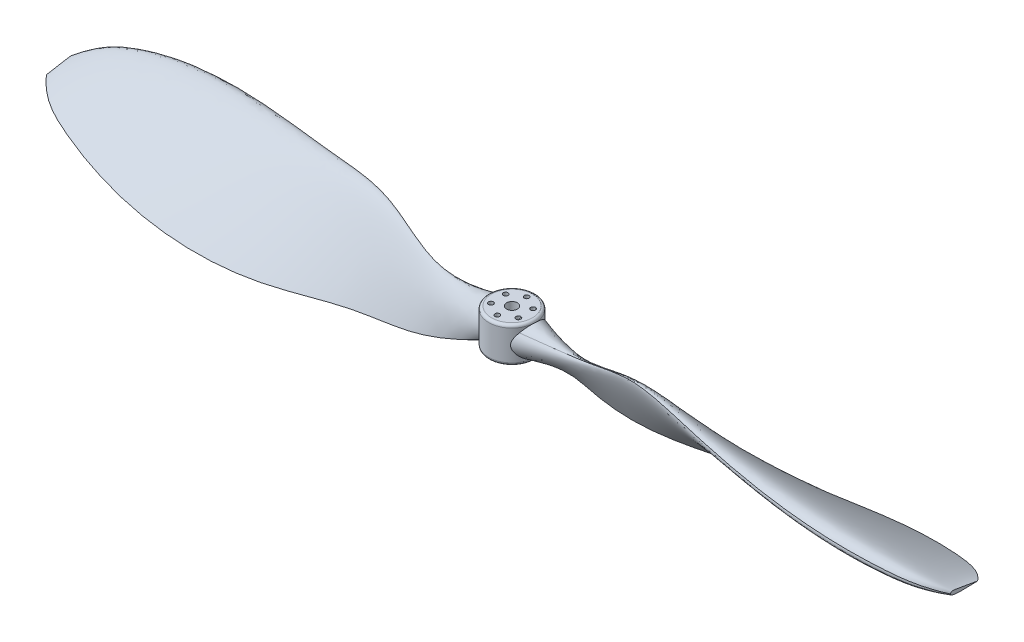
ISO-10303-21;
HEADER;
FILE_DESCRIPTION(('STEP AP214'),'2;1');
FILE_NAME('part.step','',(''),(''),'','','');
FILE_SCHEMA(('AUTOMOTIVE_DESIGN { 1 0 10303 214 1 1 1 1 }'));
ENDSEC;
DATA;
#1=APPLICATION_CONTEXT('core data for automotive mechanical design processes');
#2=APPLICATION_PROTOCOL_DEFINITION('international standard','automotive_design',2000,#1);
#3=PRODUCT_CONTEXT('',#1,'mechanical');
#4=PRODUCT('Part','Part','',(#3));
#5=PRODUCT_RELATED_PRODUCT_CATEGORY('part','',(#4));
#6=PRODUCT_DEFINITION_FORMATION('','',#4);
#7=PRODUCT_DEFINITION_CONTEXT('part definition',#1,'design');
#8=PRODUCT_DEFINITION('design','',#6,#7);
#9=PRODUCT_DEFINITION_SHAPE('','',#8);
#10=(LENGTH_UNIT() NAMED_UNIT(*) SI_UNIT(.MILLI.,.METRE.));
#11=(NAMED_UNIT(*) PLANE_ANGLE_UNIT() SI_UNIT($,.RADIAN.));
#12=(NAMED_UNIT(*) SI_UNIT($,.STERADIAN.) SOLID_ANGLE_UNIT());
#13=UNCERTAINTY_MEASURE_WITH_UNIT(LENGTH_MEASURE(1.E-05),#10,'distance_accuracy_value','');
#14=(GEOMETRIC_REPRESENTATION_CONTEXT(3) GLOBAL_UNCERTAINTY_ASSIGNED_CONTEXT((#13)) GLOBAL_UNIT_ASSIGNED_CONTEXT((#10,
#11,#12)) REPRESENTATION_CONTEXT('',''));
#15=CARTESIAN_POINT('',(0.,0.,0.));
#16=DIRECTION('',(0.,0.,1.));
#17=DIRECTION('',(1.,0.,0.));
#18=AXIS2_PLACEMENT_3D('',#15,#16,#17);
#19=CARTESIAN_POINT('',(345.,-5.5,0.));
#20=DIRECTION('',(0.,1.,0.));
#21=DIRECTION('',(0.,0.,1.));
#22=AXIS2_PLACEMENT_3D('',#19,#20,#21);
#23=TOROIDAL_SURFACE('',#22,7.5,1.);
#24=CARTESIAN_POINT('',(345.,-6.5,0.));
#25=DIRECTION('',(0.,-1.,0.));
#26=DIRECTION('',(0.,0.,1.));
#27=AXIS2_PLACEMENT_3D('',#24,#25,#26);
#28=CIRCLE('',#27,7.5);
#29=CARTESIAN_POINT('',(345.,-6.5,7.5));
#30=VERTEX_POINT('',#29);
#31=EDGE_CURVE('E561',#30,#30,#28,.F.);
#32=ORIENTED_EDGE('',*,*,#31,.T.);
#33=EDGE_LOOP('',(#32));
#34=FACE_BOUND('',#33,.T.);
#35=CARTESIAN_POINT('',(352.13626750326,-5.50000000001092,-4.61775769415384));
#36=CARTESIAN_POINT('',(352.167719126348,-5.53976891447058,-4.56911800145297));
#37=CARTESIAN_POINT('',(352.197218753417,-5.57806572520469,-4.51811270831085));
#38=CARTESIAN_POINT('',(352.252661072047,-5.6515558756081,-4.41225622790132));
#39=CARTESIAN_POINT('',(352.278610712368,-5.68675522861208,-4.35741288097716));
#40=CARTESIAN_POINT('',(352.327063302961,-5.75355553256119,-4.24539510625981));
#41=CARTESIAN_POINT('',(352.34961128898,-5.7852017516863,-4.18826676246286));
#42=CARTESIAN_POINT('',(352.392013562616,-5.84561342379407,-4.07151209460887));
#43=CARTESIAN_POINT('',(352.411865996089,-5.87437689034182,-4.01188408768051));
#44=CARTESIAN_POINT('',(352.493496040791,-5.99394321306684,-3.74666106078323));
#45=CARTESIAN_POINT('',(352.542992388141,-6.07002594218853,-3.53040192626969));
#46=CARTESIAN_POINT('',(352.599180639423,-6.15186509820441,-3.23507659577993));
#47=CARTESIAN_POINT('',(352.612480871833,-6.1707855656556,-3.16020370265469));
#48=CARTESIAN_POINT('',(352.637974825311,-6.20545515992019,-3.00950909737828));
#49=CARTESIAN_POINT('',(352.65016865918,-6.22120461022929,-2.93368748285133));
#50=CARTESIAN_POINT('',(352.673994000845,-6.24967711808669,-2.78136986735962));
#51=CARTESIAN_POINT('',(352.685625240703,-6.26239874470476,-2.70487356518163));
#52=CARTESIAN_POINT('',(352.712523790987,-6.28842641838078,-2.52773477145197));
#53=CARTESIAN_POINT('',(352.727803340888,-6.30069685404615,-2.42693989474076));
#54=CARTESIAN_POINT('',(352.759903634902,-6.32043023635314,-2.22514795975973));
#55=CARTESIAN_POINT('',(352.776724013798,-6.32789431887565,-2.12415095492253));
#56=CARTESIAN_POINT('',(352.813286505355,-6.33804233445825,-1.92251030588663));
#57=CARTESIAN_POINT('',(352.833026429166,-6.34072982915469,-1.8218664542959));
#58=CARTESIAN_POINT('',(352.876152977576,-6.34124690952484,-1.62136291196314));
#59=CARTESIAN_POINT('',(352.899539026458,-6.33907726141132,-1.52150310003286));
#60=CARTESIAN_POINT('',(352.949465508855,-6.32980341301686,-1.32275247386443));
#61=CARTESIAN_POINT('',(352.976007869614,-6.32269618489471,-1.22386229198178));
#62=CARTESIAN_POINT('',(353.03065660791,-6.30358053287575,-1.02694718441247));
#63=CARTESIAN_POINT('',(353.058763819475,-6.29156947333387,-0.928922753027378));
#64=CARTESIAN_POINT('',(353.114686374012,-6.2627456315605,-0.73299727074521));
#65=CARTESIAN_POINT('',(353.142499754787,-6.24591080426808,-0.635098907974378));
#66=CARTESIAN_POINT('',(353.195871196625,-6.20770682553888,-0.439619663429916));
#67=CARTESIAN_POINT('',(353.221430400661,-6.1863399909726,-0.342038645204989));
#68=CARTESIAN_POINT('',(353.268810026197,-6.13937662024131,-0.146978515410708));
#69=CARTESIAN_POINT('',(353.290630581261,-6.11378023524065,-0.049499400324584));
#70=CARTESIAN_POINT('',(353.329198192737,-6.05893993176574,0.144638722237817));
#71=CARTESIAN_POINT('',(353.345981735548,-6.02972452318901,0.241298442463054));
#72=CARTESIAN_POINT('',(353.373776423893,-5.96792404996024,0.434403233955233));
#73=CARTESIAN_POINT('',(353.384786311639,-5.93533825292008,0.530848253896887));
#74=CARTESIAN_POINT('',(353.400292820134,-5.86733093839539,0.723237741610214));
#75=CARTESIAN_POINT('',(353.404791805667,-5.83191045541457,0.819182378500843));
#76=CARTESIAN_POINT('',(353.406449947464,-5.76968262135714,0.981783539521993));
#77=CARTESIAN_POINT('',(353.405396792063,-5.74345389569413,1.0486479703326));
#78=CARTESIAN_POINT('',(353.399674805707,-5.69007407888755,1.18183727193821));
#79=CARTESIAN_POINT('',(353.395006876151,-5.66292321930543,1.24816227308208));
#80=CARTESIAN_POINT('',(353.381943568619,-5.60790917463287,1.38012839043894));
#81=CARTESIAN_POINT('',(353.373549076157,-5.58004616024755,1.44576966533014));
#82=CARTESIAN_POINT('',(353.352711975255,-5.52316031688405,1.57773915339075));
#83=CARTESIAN_POINT('',(353.340180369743,-5.49412556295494,1.64404823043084));
#84=CARTESIAN_POINT('',(353.311059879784,-5.43573368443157,1.77565484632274));
#85=CARTESIAN_POINT('',(353.294469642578,-5.4063764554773,1.84095204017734));
#86=CARTESIAN_POINT('',(353.25718442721,-5.34756723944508,1.97039873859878));
#87=CARTESIAN_POINT('',(353.236485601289,-5.31811518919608,2.0345471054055));
#88=CARTESIAN_POINT('',(353.213723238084,-5.2887527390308,2.09800261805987));
#89=B_SPLINE_CURVE_WITH_KNOTS('',3,(#35,#36,#37,#38,#39,#40,#41,#42,#43,#44,#45,#46,#47,#48,#49,
#50,#51,#52,#53,#54,#55,#56,#57,#58,#59,#60,#61,#62,#63,#64,#65,#66,#67,#68,#69,#70,#71,#72,#73,
#74,#75,#76,#77,#78,#79,#80,#81,#82,#83,#84,#85,#86,#87,#88),.UNSPECIFIED.,.F.,.F.,(4,2,2,2,2,2,
2,2,2,2,2,2,2,2,2,2,2,2,2,2,2,2,2,2,2,2,4),(0.,0.210599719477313,0.420781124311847,
0.627874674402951,0.835109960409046,1.53402776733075,1.76913629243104,2.00422082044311,
2.23941622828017,2.54733624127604,2.85518345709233,3.16280103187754,3.4703700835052,
3.77812791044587,4.08605136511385,4.39540513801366,4.70460114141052,5.01378609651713,
5.3206741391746,5.62762900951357,5.93447236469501,6.14987988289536,6.36523370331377,
6.5805363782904,6.80081048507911,7.02115811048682,7.24171307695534),.UNSPECIFIED.);
#90=CARTESIAN_POINT('',(352.136267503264,-5.50000000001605,-4.61775769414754));
#91=VERTEX_POINT('',#90);
#92=CARTESIAN_POINT('',(353.342173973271,-5.50000000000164,1.63037829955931));
#93=VERTEX_POINT('',#92);
#94=EDGE_CURVE('E12',#91,#93,#89,.T.);
#95=ORIENTED_EDGE('',*,*,#94,.T.);
#96=CARTESIAN_POINT('',(345.,-5.5,0.));
#97=DIRECTION('',(0.,-1.,0.));
#98=DIRECTION('',(0.,0.,1.));
#99=AXIS2_PLACEMENT_3D('',#96,#97,#98);
#100=CIRCLE('',#99,8.5);
#101=CARTESIAN_POINT('',(337.863732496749,-5.5,4.61775769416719));
#102=VERTEX_POINT('',#101);
#103=EDGE_CURVE('E553',#93,#102,#100,.T.);
#104=ORIENTED_EDGE('',*,*,#103,.T.);
#105=CARTESIAN_POINT('',(337.863732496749,-5.5,4.61775769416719));
#106=CARTESIAN_POINT('',(337.832280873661,-5.53976891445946,4.56911800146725));
#107=CARTESIAN_POINT('',(337.802781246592,-5.57806572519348,4.51811270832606));
#108=CARTESIAN_POINT('',(337.747338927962,-5.6515558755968,4.41225622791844));
#109=CARTESIAN_POINT('',(337.72138928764,-5.68675522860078,4.35741288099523));
#110=CARTESIAN_POINT('',(337.672936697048,-5.75355553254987,4.24539510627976));
#111=CARTESIAN_POINT('',(337.650388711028,-5.78520175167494,4.18826676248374));
#112=CARTESIAN_POINT('',(337.607986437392,-5.84561342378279,4.0715120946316));
#113=CARTESIAN_POINT('',(337.588134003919,-5.87437689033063,4.01188408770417));
#114=CARTESIAN_POINT('',(337.506503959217,-5.99394321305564,3.74666106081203));
#115=CARTESIAN_POINT('',(337.457007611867,-6.07002594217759,3.53040192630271));
#116=CARTESIAN_POINT('',(337.400819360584,-6.15186509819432,3.23507659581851));
#117=CARTESIAN_POINT('',(337.387519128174,-6.17078556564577,3.16020370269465));
#118=CARTESIAN_POINT('',(337.362025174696,-6.20545515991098,3.00950909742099));
#119=CARTESIAN_POINT('',(337.349831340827,-6.22120461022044,2.93368748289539));
#120=CARTESIAN_POINT('',(337.326005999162,-6.24967711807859,2.78136986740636));
#121=CARTESIAN_POINT('',(337.314374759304,-6.26239874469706,2.70487356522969));
#122=CARTESIAN_POINT('',(337.28747620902,-6.28842641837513,2.527734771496));
#123=CARTESIAN_POINT('',(337.272196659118,-6.30069685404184,2.42693989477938));
#124=CARTESIAN_POINT('',(337.240096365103,-6.32043023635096,2.22514795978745));
#125=CARTESIAN_POINT('',(337.223275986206,-6.32789431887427,2.12415095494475));
#126=CARTESIAN_POINT('',(337.186713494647,-6.33804233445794,1.92251030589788));
#127=CARTESIAN_POINT('',(337.166973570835,-6.34072982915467,1.82186645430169));
#128=CARTESIAN_POINT('',(337.123847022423,-6.34124690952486,1.62136291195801));
#129=CARTESIAN_POINT('',(337.100460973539,-6.3390772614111,1.52150310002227));
#130=CARTESIAN_POINT('',(337.050534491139,-6.3298034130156,1.32275247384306));
#131=CARTESIAN_POINT('',(337.023992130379,-6.32269618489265,1.22386229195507));
#132=CARTESIAN_POINT('',(336.96934339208,-6.30358053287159,1.02694718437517));
#133=CARTESIAN_POINT('',(336.941236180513,-6.29156947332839,0.928922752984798));
#134=CARTESIAN_POINT('',(336.885313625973,-6.26274563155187,0.73299727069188));
#135=CARTESIAN_POINT('',(336.857500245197,-6.2459108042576,0.635098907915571));
#136=CARTESIAN_POINT('',(336.804128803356,-6.20770682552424,0.439619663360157));
#137=CARTESIAN_POINT('',(336.77856959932,-6.18633999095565,0.342038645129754));
#138=CARTESIAN_POINT('',(336.731189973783,-6.13937662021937,0.146978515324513));
#139=CARTESIAN_POINT('',(336.70936941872,-6.11378023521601,0.0494994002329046));
#140=CARTESIAN_POINT('',(336.670801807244,-6.05893993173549,-0.144638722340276));
#141=CARTESIAN_POINT('',(336.654018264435,-6.02972452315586,-0.241298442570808));
#142=CARTESIAN_POINT('',(336.626223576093,-5.96792404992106,-0.434403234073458));
#143=CARTESIAN_POINT('',(336.615213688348,-5.93533825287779,-0.530848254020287));
#144=CARTESIAN_POINT('',(336.599707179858,-5.86733093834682,-0.723237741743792));
#145=CARTESIAN_POINT('',(336.595208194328,-5.83191045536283,-0.819182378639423));
#146=CARTESIAN_POINT('',(336.593550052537,-5.76968262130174,-0.981783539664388));
#147=CARTESIAN_POINT('',(336.594603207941,-5.74345389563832,-1.0486479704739));
#148=CARTESIAN_POINT('',(336.600325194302,-5.69007407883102,-1.18183727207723));
#149=CARTESIAN_POINT('',(336.60499312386,-5.6629232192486,-1.24816227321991));
#150=CARTESIAN_POINT('',(336.618056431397,-5.60790917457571,-1.38012839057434));
#151=CARTESIAN_POINT('',(336.626450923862,-5.58004616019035,-1.4457696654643));
#152=CARTESIAN_POINT('',(336.647288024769,-5.5231603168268,-1.57773915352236));
#153=CARTESIAN_POINT('',(336.659819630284,-5.4941255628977,-1.64404823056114));
#154=CARTESIAN_POINT('',(336.688940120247,-5.43573368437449,-1.77565484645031));
#155=CARTESIAN_POINT('',(336.705530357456,-5.40637645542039,-1.8409520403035));
#156=CARTESIAN_POINT('',(336.742815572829,-5.34756723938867,-1.97039873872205));
#157=CARTESIAN_POINT('',(336.763514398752,-5.31811518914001,-2.03454710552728));
#158=CARTESIAN_POINT('',(336.78627676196,-5.28875273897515,-2.09800261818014));
#159=B_SPLINE_CURVE_WITH_KNOTS('',3,(#105,#106,#107,#108,#109,#110,#111,#112,#113,#114,#115,
#116,#117,#118,#119,#120,#121,#122,#123,#124,#125,#126,#127,#128,#129,#130,#131,#132,#133,#134,
#135,#136,#137,#138,#139,#140,#141,#142,#143,#144,#145,#146,#147,#148,#149,#150,#151,#152,#153,
#154,#155,#156,#157,#158),.UNSPECIFIED.,.F.,.F.,(4,2,2,2,2,2,2,2,2,2,2,2,2,2,2,2,2,2,2,2,2,2,2,
2,2,2,4),(0.,0.210599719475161,0.420781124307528,0.627874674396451,0.83510996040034,
1.53402776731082,1.76913629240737,2.0042208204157,2.23941622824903,2.5473362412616,
2.85518345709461,3.16280103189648,3.47037008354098,3.7781279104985,4.0860513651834,
4.39540513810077,4.70460114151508,5.0137860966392,5.32067413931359,5.62762900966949,
5.93447236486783,6.14987988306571,6.36523370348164,6.58053637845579,6.80081048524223,
7.02115811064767,7.24171307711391),.UNSPECIFIED.);
#160=CARTESIAN_POINT('',(336.657826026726,-5.5000000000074,-1.63037829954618));
#161=VERTEX_POINT('',#160);
#162=EDGE_CURVE('E285',#102,#161,#159,.T.);
#163=ORIENTED_EDGE('',*,*,#162,.T.);
#164=CARTESIAN_POINT('',(345.,-5.5,0.));
#165=DIRECTION('',(0.,-1.,0.));
#166=DIRECTION('',(0.,0.,1.));
#167=AXIS2_PLACEMENT_3D('',#164,#165,#166);
#168=CIRCLE('',#167,8.5);
#169=EDGE_CURVE('E560',#161,#91,#168,.T.);
#170=ORIENTED_EDGE('',*,*,#169,.T.);
#171=EDGE_LOOP('',(#95,#104,#163,#170));
#172=FACE_BOUND('',#171,.T.);
#173=ADVANCED_FACE('F271',(#34,#172),#23,.T.);
#174=CARTESIAN_POINT('',(345.,6.5,0.));
#175=DIRECTION('',(0.,-1.,0.));
#176=DIRECTION('',(0.,0.,-1.));
#177=AXIS2_PLACEMENT_3D('',#174,#175,#176);
#178=CYLINDRICAL_SURFACE('',#177,8.5);
#179=CARTESIAN_POINT('',(338.172870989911,-5.06599627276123,5.06362611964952));
#180=CARTESIAN_POINT('',(338.126664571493,-5.13778451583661,5.00133102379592));
#181=CARTESIAN_POINT('',(338.079919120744,-5.20706721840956,4.93652003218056));
#182=CARTESIAN_POINT('',(337.985864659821,-5.34019460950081,4.80194074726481));
#183=CARTESIAN_POINT('',(337.938555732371,-5.40404008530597,4.73217317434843));
#184=CARTESIAN_POINT('',(337.843795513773,-5.52598961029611,4.5876156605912));
#185=CARTESIAN_POINT('',(337.796344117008,-5.58408382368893,4.51281747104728));
#186=CARTESIAN_POINT('',(337.701957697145,-5.69414901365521,4.35852683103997));
#187=CARTESIAN_POINT('',(337.655022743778,-5.74611917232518,4.27903375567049));
#188=CARTESIAN_POINT('',(337.553591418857,-5.85309078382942,4.10041811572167));
#189=CARTESIAN_POINT('',(337.499325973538,-5.90683576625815,4.00040831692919));
#190=CARTESIAN_POINT('',(337.39324606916,-6.00538280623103,3.79482230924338));
#191=CARTESIAN_POINT('',(337.341431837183,-6.05018403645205,3.68924558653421));
#192=CARTESIAN_POINT('',(337.241094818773,-6.13045870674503,3.47326205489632));
#193=CARTESIAN_POINT('',(337.192568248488,-6.16594301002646,3.36286104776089));
#194=CARTESIAN_POINT('',(337.099457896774,-6.22753634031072,3.1378740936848));
#195=CARTESIAN_POINT('',(337.054873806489,-6.25364610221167,3.02328847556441));
#196=CARTESIAN_POINT('',(336.971431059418,-6.29608310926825,2.79401979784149));
#197=CARTESIAN_POINT('',(336.932447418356,-6.31266283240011,2.67942855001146));
#198=CARTESIAN_POINT('',(336.859185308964,-6.33765092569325,2.44783488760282));
#199=CARTESIAN_POINT('',(336.824908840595,-6.34605583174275,2.3308314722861));
#200=CARTESIAN_POINT('',(336.761337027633,-6.3552790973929,2.09507807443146));
#201=CARTESIAN_POINT('',(336.732046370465,-6.35609035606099,1.97632656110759));
#202=CARTESIAN_POINT('',(336.678644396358,-6.35075837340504,1.73781118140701));
#203=CARTESIAN_POINT('',(336.654534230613,-6.34461358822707,1.61804709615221));
#204=CARTESIAN_POINT('',(336.602893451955,-6.32221204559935,1.32961001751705));
#205=CARTESIAN_POINT('',(336.577911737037,-6.30287439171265,1.16071211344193));
#206=CARTESIAN_POINT('',(336.538259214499,-6.25331194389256,0.823303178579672));
#207=CARTESIAN_POINT('',(336.523591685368,-6.22308369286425,0.654792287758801));
#208=CARTESIAN_POINT('',(336.504320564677,-6.15301751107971,0.318982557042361));
#209=CARTESIAN_POINT('',(336.499730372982,-6.11316686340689,0.151685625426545));
#210=CARTESIAN_POINT('',(336.500294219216,-6.02493804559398,-0.180601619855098));
#211=CARTESIAN_POINT('',(336.505448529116,-5.97655963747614,-0.345591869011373));
#212=CARTESIAN_POINT('',(336.527846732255,-5.85745711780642,-0.718867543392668));
#213=CARTESIAN_POINT('',(336.548098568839,-5.78428341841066,-0.926194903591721));
#214=CARTESIAN_POINT('',(336.602925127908,-5.62712405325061,-1.33477779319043));
#215=CARTESIAN_POINT('',(336.637503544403,-5.54313560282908,-1.5360317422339));
#216=CARTESIAN_POINT('',(336.719853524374,-5.36499954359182,-1.93130675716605));
#217=CARTESIAN_POINT('',(336.767631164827,-5.2708472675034,-2.12532444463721));
#218=CARTESIAN_POINT('',(336.875075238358,-5.07281638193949,-2.50489652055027));
#219=CARTESIAN_POINT('',(336.934740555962,-4.96893868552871,-2.69045170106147));
#220=CARTESIAN_POINT('',(337.03259518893,-4.80568300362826,-2.96310017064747));
#221=CARTESIAN_POINT('',(337.066868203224,-4.74961771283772,-3.0536307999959));
#222=CARTESIAN_POINT('',(337.137943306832,-4.6352011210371,-3.23222797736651));
#223=CARTESIAN_POINT('',(337.174745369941,-4.57684984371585,-3.32029455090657));
#224=CARTESIAN_POINT('',(337.25066315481,-4.45778798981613,-3.49381583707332));
#225=CARTESIAN_POINT('',(337.28977921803,-4.39707706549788,-3.57927016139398));
#226=CARTESIAN_POINT('',(337.370090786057,-4.27325887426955,-3.74742156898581));
#227=CARTESIAN_POINT('',(337.411286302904,-4.21015159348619,-3.83011863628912));
#228=CARTESIAN_POINT('',(337.495538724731,-4.08161258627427,-3.99267301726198));
#229=CARTESIAN_POINT('',(337.538595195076,-4.01618140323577,-4.07253098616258));
#230=CARTESIAN_POINT('',(337.626332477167,-3.88293409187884,-4.22931393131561));
#231=CARTESIAN_POINT('',(337.671013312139,-3.8151179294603,-4.30623886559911));
#232=CARTESIAN_POINT('',(337.761684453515,-3.67698530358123,-4.45696292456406));
#233=CARTESIAN_POINT('',(337.807674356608,-3.60666960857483,-4.53076299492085));
#234=CARTESIAN_POINT('',(337.900619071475,-3.46334846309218,-4.67505708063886));
#235=CARTESIAN_POINT('',(337.947573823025,-3.3903431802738,-4.74555130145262));
#236=CARTESIAN_POINT('',(338.062202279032,-3.20987918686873,-4.91234118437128));
#237=CARTESIAN_POINT('',(338.130195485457,-3.10097132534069,-5.0068608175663));
#238=CARTESIAN_POINT('',(338.266292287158,-2.8771410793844,-5.18845453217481));
#239=CARTESIAN_POINT('',(338.334395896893,-2.76221783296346,-5.27552754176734));
#240=CARTESIAN_POINT('',(338.469289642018,-2.5261481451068,-5.44162155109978));
#241=CARTESIAN_POINT('',(338.536081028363,-2.40500807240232,-5.52065055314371));
#242=CARTESIAN_POINT('',(338.666472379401,-2.15571306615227,-5.66976323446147));
#243=CARTESIAN_POINT('',(338.73007388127,-2.02756157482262,-5.73985124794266));
#244=CARTESIAN_POINT('',(338.829307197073,-1.81154612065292,-5.84600345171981));
#245=CARTESIAN_POINT('',(338.866689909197,-1.72600608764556,-5.88516303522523));
#246=CARTESIAN_POINT('',(338.938198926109,-1.55158786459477,-5.95879169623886));
#247=CARTESIAN_POINT('',(338.97232535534,-1.46270980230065,-5.99326095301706));
#248=CARTESIAN_POINT('',(339.036311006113,-1.28176091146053,-6.0569339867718));
#249=CARTESIAN_POINT('',(339.066177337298,-1.18969572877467,-6.08614655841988));
#250=CARTESIAN_POINT('',(339.120648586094,-1.00241603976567,-6.13878363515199));
#251=CARTESIAN_POINT('',(339.145255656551,-0.907202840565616,-6.16221050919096));
#252=CARTESIAN_POINT('',(339.184393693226,-0.731076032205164,-6.19913822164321));
#253=CARTESIAN_POINT('',(339.199936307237,-0.650601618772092,-6.21366094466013));
#254=CARTESIAN_POINT('',(339.226245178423,-0.488218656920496,-6.23811503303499));
#255=CARTESIAN_POINT('',(339.237013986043,-0.40631089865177,-6.24804885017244));
#256=CARTESIAN_POINT('',(339.253374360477,-0.241592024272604,-6.26309976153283));
#257=CARTESIAN_POINT('',(339.258969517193,-0.158781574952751,-6.26822019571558));
#258=CARTESIAN_POINT('',(339.264795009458,0.00718713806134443,-6.273550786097));
#259=CARTESIAN_POINT('',(339.265025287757,0.0903454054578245,-6.27376088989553));
#260=CARTESIAN_POINT('',(339.260158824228,0.256281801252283,-6.26930892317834));
#261=CARTESIAN_POINT('',(339.255067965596,0.339060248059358,-6.26465223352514));
#262=CARTESIAN_POINT('',(339.239838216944,0.503729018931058,-6.25065104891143));
#263=CARTESIAN_POINT('',(339.229699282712,0.585619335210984,-6.24130651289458));
#264=CARTESIAN_POINT('',(339.192311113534,0.829444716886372,-6.2066037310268));
#265=CARTESIAN_POINT('',(339.158094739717,0.989422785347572,-6.17457988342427));
#266=CARTESIAN_POINT('',(339.084537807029,1.26816091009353,-6.10403875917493));
#267=CARTESIAN_POINT('',(339.047858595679,1.38841829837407,-6.06837539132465));
#268=CARTESIAN_POINT('',(338.967970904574,1.62406767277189,-5.98897329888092));
#269=CARTESIAN_POINT('',(338.924758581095,1.73945674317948,-5.94522981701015));
#270=CARTESIAN_POINT('',(338.833381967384,1.96584586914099,-5.85039976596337));
#271=CARTESIAN_POINT('',(338.785194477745,2.0768216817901,-5.79927830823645));
#272=CARTESIAN_POINT('',(338.685524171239,2.2939961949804,-5.69059152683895));
#273=CARTESIAN_POINT('',(338.634041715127,2.40019541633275,-5.63302690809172));
#274=CARTESIAN_POINT('',(338.539391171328,2.58741510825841,-5.52400795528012));
#275=CARTESIAN_POINT('',(338.496601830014,2.66924819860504,-5.473609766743));
#276=CARTESIAN_POINT('',(338.41015997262,2.83013784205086,-5.36922720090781));
#277=CARTESIAN_POINT('',(338.366507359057,2.90919407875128,-5.31524241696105));
#278=CARTESIAN_POINT('',(338.27874294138,3.06458244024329,-5.20381935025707));
#279=CARTESIAN_POINT('',(338.234631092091,3.14091429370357,-5.14638072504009));
#280=CARTESIAN_POINT('',(338.14692517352,3.28965866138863,-5.02898125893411));
#281=CARTESIAN_POINT('',(338.103333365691,3.36211299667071,-4.96907171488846));
#282=CARTESIAN_POINT('',(338.016286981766,3.50423356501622,-4.84597085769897));
#283=CARTESIAN_POINT('',(337.972832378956,3.57390037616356,-4.78278023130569));
#284=CARTESIAN_POINT('',(337.88632362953,3.71032792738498,-4.65313685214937));
#285=CARTESIAN_POINT('',(337.843269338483,3.77708975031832,-4.58668533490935));
#286=CARTESIAN_POINT('',(337.800534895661,3.84235836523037,-4.5185951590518));
#287=B_SPLINE_CURVE_WITH_KNOTS('',3,(#179,#180,#181,#182,#183,#184,#185,#186,#187,#188,#189,
#190,#191,#192,#193,#194,#195,#196,#197,#198,#199,#200,#201,#202,#203,#204,#205,#206,#207,#208,
#209,#210,#211,#212,#213,#214,#215,#216,#217,#218,#219,#220,#221,#222,#223,#224,#225,#226,#227,
#228,#229,#230,#231,#232,#233,#234,#235,#236,#237,#238,#239,#240,#241,#242,#243,#244,#245,#246,
#247,#248,#249,#250,#251,#252,#253,#254,#255,#256,#257,#258,#259,#260,#261,#262,#263,#264,#265,
#266,#267,#268,#269,#270,#271,#272,#273,#274,#275,#276,#277,#278,#279,#280,#281,#282,#283,#284,
#285,#286),.UNSPECIFIED.,.F.,.F.,(4,2,2,2,2,2,2,2,2,2,2,2,2,2,2,2,2,2,2,2,2,2,2,2,2,2,2,2,2,2,2,
2,2,2,2,2,2,2,2,2,2,2,2,2,2,2,2,2,2,2,2,2,2,4),(0.,0.317018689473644,0.633991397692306,
0.95149715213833,1.26904526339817,1.64609044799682,2.02317049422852,2.39980890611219,
2.77641778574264,3.14252516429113,3.50878761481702,3.87539252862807,4.24207882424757,
4.75680574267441,5.2716961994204,5.78727089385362,6.30285997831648,6.9643267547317,
7.62596419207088,8.28790675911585,8.94978724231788,9.28531857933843,9.62084644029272,
9.95642393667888,10.2920033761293,10.6275048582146,10.9630111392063,11.2984151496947,
11.6337982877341,12.1118039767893,12.5898783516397,13.0674723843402,13.5448340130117,
13.8483547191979,14.1518638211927,14.4548603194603,14.7577325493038,15.0071954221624,
15.256524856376,15.5056811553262,15.754840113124,16.0037238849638,16.2526098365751,
16.7507125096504,17.1422766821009,17.5340721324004,17.9277849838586,18.3214548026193,
18.6369609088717,18.9525028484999,19.2680761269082,19.5788757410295,19.8896105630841,
20.2002285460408),.UNSPECIFIED.);
#288=CARTESIAN_POINT('',(337.800534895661,3.84235836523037,-4.5185951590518));
#289=VERTEX_POINT('',#288);
#290=EDGE_CURVE('E652',#161,#289,#287,.T.);
#291=ORIENTED_EDGE('',*,*,#290,.T.);
#292=CARTESIAN_POINT('',(337.800534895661,3.84235836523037,-4.5185951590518));
#293=CARTESIAN_POINT('',(337.767871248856,3.893275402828,-4.46655361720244));
#294=CARTESIAN_POINT('',(337.735356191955,3.94324639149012,-4.41349289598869));
#295=CARTESIAN_POINT('',(337.670765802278,4.04124951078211,-4.30537886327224));
#296=CARTESIAN_POINT('',(337.638690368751,4.08928209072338,-4.2503260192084));
#297=CARTESIAN_POINT('',(337.574974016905,4.18358135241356,-4.13801584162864));
#298=CARTESIAN_POINT('',(337.543335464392,4.22983984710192,-4.08075028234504));
#299=CARTESIAN_POINT('',(337.480758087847,4.32034849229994,-3.96426221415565));
#300=CARTESIAN_POINT('',(337.449819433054,4.36459815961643,-3.90503924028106));
#301=CARTESIAN_POINT('',(337.357582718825,4.49526831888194,-3.72317916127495));
#302=CARTESIAN_POINT('',(337.297579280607,4.57855904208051,-3.59760253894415));
#303=CARTESIAN_POINT('',(337.182027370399,4.73638750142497,-3.33906743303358));
#304=CARTESIAN_POINT('',(337.126479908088,4.81092325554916,-3.2061072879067));
#305=CARTESIAN_POINT('',(337.020773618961,4.9501804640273,-2.93314586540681));
#306=CARTESIAN_POINT('',(336.970612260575,5.01490653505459,-2.79314794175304));
#307=CARTESIAN_POINT('',(336.876599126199,5.13357119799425,-2.50660865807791));
#308=CARTESIAN_POINT('',(336.832746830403,5.18751067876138,-2.3600678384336));
#309=CARTESIAN_POINT('',(336.750550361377,5.28594072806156,-2.05489671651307));
#310=CARTESIAN_POINT('',(336.712522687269,5.32992743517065,-1.89601744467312));
#311=CARTESIAN_POINT('',(336.645256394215,5.40473637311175,-1.57334602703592));
#312=CARTESIAN_POINT('',(336.616018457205,5.43555758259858,-1.40955350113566));
#313=CARTESIAN_POINT('',(336.567059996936,5.48356281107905,-1.0786486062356));
#314=CARTESIAN_POINT('',(336.547335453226,5.50075259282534,-0.911537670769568));
#315=CARTESIAN_POINT('',(336.517837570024,5.52144955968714,-0.575619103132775));
#316=CARTESIAN_POINT('',(336.508062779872,5.52495873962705,-0.406811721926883));
#317=CARTESIAN_POINT('',(336.499302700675,5.51910319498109,-0.0941765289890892));
#318=CARTESIAN_POINT('',(336.498935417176,5.51156582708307,0.049653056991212));
#319=CARTESIAN_POINT('',(336.50544708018,5.48713444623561,0.336333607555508));
#320=CARTESIAN_POINT('',(336.512325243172,5.47024144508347,0.479184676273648));
#321=CARTESIAN_POINT('',(336.533118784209,5.42756917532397,0.763003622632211));
#322=CARTESIAN_POINT('',(336.547033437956,5.40179082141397,0.903971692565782));
#323=CARTESIAN_POINT('',(336.58159652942,5.34213947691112,1.1833407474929));
#324=CARTESIAN_POINT('',(336.602245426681,5.30826593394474,1.32174155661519));
#325=CARTESIAN_POINT('',(336.651342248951,5.23056176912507,1.6036207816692));
#326=CARTESIAN_POINT('',(336.680187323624,5.18625174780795,1.7468978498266));
#327=CARTESIAN_POINT('',(336.744480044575,5.08945799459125,2.02912494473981));
#328=CARTESIAN_POINT('',(336.779927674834,5.0369742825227,2.16807498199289));
#329=CARTESIAN_POINT('',(336.856914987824,4.924681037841,2.44138073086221));
#330=CARTESIAN_POINT('',(336.898460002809,4.86486510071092,2.57573229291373));
#331=CARTESIAN_POINT('',(336.98709592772,4.73880355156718,2.83949552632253));
#332=CARTESIAN_POINT('',(337.034187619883,4.6725570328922,2.96890649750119));
#333=CARTESIAN_POINT('',(337.15830022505,4.49942519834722,3.2862682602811));
#334=CARTESIAN_POINT('',(337.238476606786,4.38883613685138,3.47098694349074));
#335=CARTESIAN_POINT('',(337.408161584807,4.15526927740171,3.82793634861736));
#336=CARTESIAN_POINT('',(337.497674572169,4.03228565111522,4.00016112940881));
#337=CARTESIAN_POINT('',(337.684135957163,3.77469484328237,4.33178106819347));
#338=CARTESIAN_POINT('',(337.781092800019,3.64007443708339,4.49116122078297));
#339=CARTESIAN_POINT('',(337.930331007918,3.42984061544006,4.71996607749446));
#340=CARTESIAN_POINT('',(337.980706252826,3.35838552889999,4.7945172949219));
#341=CARTESIAN_POINT('',(338.082356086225,3.21254326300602,4.94004836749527));
#342=CARTESIAN_POINT('',(338.133630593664,3.13815634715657,5.01102854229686));
#343=CARTESIAN_POINT('',(338.25186035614,2.96379656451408,5.16962891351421));
#344=CARTESIAN_POINT('',(338.318972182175,2.86275826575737,5.25596859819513));
#345=CARTESIAN_POINT('',(338.452742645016,2.6548243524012,5.42169366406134));
#346=CARTESIAN_POINT('',(338.519401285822,2.54792878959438,5.50107910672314));
#347=CARTESIAN_POINT('',(338.650708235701,2.32798718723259,5.65212269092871));
#348=CARTESIAN_POINT('',(338.715360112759,2.21495317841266,5.72379518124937));
#349=CARTESIAN_POINT('',(338.84103417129,1.98207530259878,5.85880715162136));
#350=CARTESIAN_POINT('',(338.902057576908,1.8622337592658,5.92214945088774));
#351=CARTESIAN_POINT('',(339.000350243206,1.65249926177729,6.02142090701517));
#352=CARTESIAN_POINT('',(339.039214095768,1.56453576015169,6.05984050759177));
#353=CARTESIAN_POINT('',(339.112845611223,1.38481934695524,6.13139859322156));
#354=CARTESIAN_POINT('',(339.147614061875,1.29306716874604,6.16453809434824));
#355=CARTESIAN_POINT('',(339.211962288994,1.10619827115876,6.22499528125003));
#356=CARTESIAN_POINT('',(339.241556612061,1.01109191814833,6.25232933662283));
#357=CARTESIAN_POINT('',(339.294736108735,0.817676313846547,6.30089397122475));
#358=CARTESIAN_POINT('',(339.31832131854,0.719367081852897,6.3221245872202));
#359=CARTESIAN_POINT('',(339.358911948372,0.519601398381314,6.35837041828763));
#360=CARTESIAN_POINT('',(339.375874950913,0.418129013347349,6.37334560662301));
#361=CARTESIAN_POINT('',(339.402677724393,0.213522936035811,6.39689792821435));
#362=CARTESIAN_POINT('',(339.41251766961,0.110389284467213,6.40547521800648));
#363=CARTESIAN_POINT('',(339.425202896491,-0.0968128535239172,6.41651830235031));
#364=CARTESIAN_POINT('',(339.428034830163,-0.200882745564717,6.41897243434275));
#365=CARTESIAN_POINT('',(339.427183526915,-0.408970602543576,6.41823295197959));
#366=CARTESIAN_POINT('',(339.423499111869,-0.512988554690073,6.41503831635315));
#367=CARTESIAN_POINT('',(339.410478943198,-0.718752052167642,6.40369617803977));
#368=CARTESIAN_POINT('',(339.401231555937,-0.820507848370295,6.3956261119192));
#369=CARTESIAN_POINT('',(339.377967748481,-1.02307218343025,6.37518559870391));
#370=CARTESIAN_POINT('',(339.363948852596,-1.12388020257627,6.362812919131));
#371=CARTESIAN_POINT('',(339.331923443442,-1.32433223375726,6.33430080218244));
#372=CARTESIAN_POINT('',(339.313915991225,-1.42397596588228,6.31816047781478));
#373=CARTESIAN_POINT('',(339.274474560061,-1.62275449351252,6.2824414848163));
#374=CARTESIAN_POINT('',(339.253015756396,-1.72187977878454,6.262837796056));
#375=CARTESIAN_POINT('',(339.207403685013,-1.91882648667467,6.2206745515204));
#376=CARTESIAN_POINT('',(339.18325137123,-2.01664835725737,6.1981160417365));
#377=CARTESIAN_POINT('',(339.13277076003,-2.21106651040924,6.15035192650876));
#378=CARTESIAN_POINT('',(339.106442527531,-2.30766282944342,6.12514640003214));
#379=CARTESIAN_POINT('',(339.045822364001,-2.52173324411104,6.06629516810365));
#380=CARTESIAN_POINT('',(339.011088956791,-2.63891400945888,6.03203962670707));
#381=CARTESIAN_POINT('',(338.939710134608,-2.87171814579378,5.96032283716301));
#382=CARTESIAN_POINT('',(338.903064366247,-2.98734122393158,5.92286099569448));
#383=CARTESIAN_POINT('',(338.828412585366,-3.21721388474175,5.84503355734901));
#384=CARTESIAN_POINT('',(338.790406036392,-3.33146290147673,5.8046668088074));
#385=CARTESIAN_POINT('',(338.713507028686,-3.55873040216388,5.72129568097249));
#386=CARTESIAN_POINT('',(338.674614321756,-3.67174852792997,5.67829055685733));
#387=CARTESIAN_POINT('',(338.59745094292,-3.89330784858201,5.59112292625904));
#388=CARTESIAN_POINT('',(338.559195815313,-4.00188269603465,5.54703209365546));
#389=CARTESIAN_POINT('',(338.482373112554,-4.21791481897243,5.45656114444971));
#390=CARTESIAN_POINT('',(338.443805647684,-4.32537246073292,5.41018180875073));
#391=CARTESIAN_POINT('',(338.366522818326,-4.53910472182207,5.31514172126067));
#392=CARTESIAN_POINT('',(338.327807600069,-4.64538023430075,5.2664828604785));
#393=CARTESIAN_POINT('',(338.250348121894,-4.85663829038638,5.16683378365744));
#394=CARTESIAN_POINT('',(338.211603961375,-4.96162230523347,5.11584660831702));
#395=CARTESIAN_POINT('',(338.172870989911,-5.06599627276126,5.06362611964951));
#396=B_SPLINE_CURVE_WITH_KNOTS('',3,(#292,#293,#294,#295,#296,#297,#298,#299,#300,#301,#302,
#303,#304,#305,#306,#307,#308,#309,#310,#311,#312,#313,#314,#315,#316,#317,#318,#319,#320,#321,
#322,#323,#324,#325,#326,#327,#328,#329,#330,#331,#332,#333,#334,#335,#336,#337,#338,#339,#340,
#341,#342,#343,#344,#345,#346,#347,#348,#349,#350,#351,#352,#353,#354,#355,#356,#357,#358,#359,
#360,#361,#362,#363,#364,#365,#366,#367,#368,#369,#370,#371,#372,#373,#374,#375,#376,#377,#378,
#379,#380,#381,#382,#383,#384,#385,#386,#387,#388,#389,#390,#391,#392,#393,#394,#395),
.UNSPECIFIED.,.F.,.F.,(4,2,2,2,2,2,2,2,2,2,2,2,2,2,2,2,2,2,2,2,2,2,2,2,2,2,2,2,2,2,2,2,2,2,2,2,
2,2,2,2,2,2,2,2,2,2,2,2,2,2,2,4),(0.,0.239382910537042,0.47871001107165,0.71903378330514,
0.959415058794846,1.44551718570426,1.93172914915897,2.41771157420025,2.90365393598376,
3.41041671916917,3.91721880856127,4.42380653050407,4.93032038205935,5.36191794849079,
5.79346884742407,6.22497533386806,6.65651127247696,7.11422752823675,7.5719426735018,
8.03006050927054,8.48824303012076,9.17647819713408,9.86503851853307,10.5543919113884,
10.8990073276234,11.243591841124,11.6899960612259,12.1363963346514,12.5819512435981,
13.0273549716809,13.3377873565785,13.648159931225,13.9576453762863,14.2671289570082,
14.578563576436,14.8899905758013,15.2020102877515,15.5140864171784,15.8213315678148,
16.1287363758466,16.436213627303,16.7460104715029,17.055697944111,17.3653761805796,
17.7460863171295,18.1268670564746,18.5077995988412,18.8888401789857,19.2586291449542,
19.6282927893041,19.9976550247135,20.3665479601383),.UNSPECIFIED.);
#397=CARTESIAN_POINT('',(336.547128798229,5.5,-0.893850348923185));
#398=VERTEX_POINT('',#397);
#399=EDGE_CURVE('E497',#289,#398,#396,.T.);
#400=ORIENTED_EDGE('',*,*,#399,.T.);
#401=CARTESIAN_POINT('',(345.,5.5,0.));
#402=DIRECTION('',(0.,-1.,0.));
#403=DIRECTION('',(0.,0.,1.));
#404=AXIS2_PLACEMENT_3D('',#401,#402,#403);
#405=CIRCLE('',#404,8.5);
#406=CARTESIAN_POINT('',(353.49797968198,5.5,-0.185314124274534));
#407=VERTEX_POINT('',#406);
#408=EDGE_CURVE('E826',#407,#398,#405,.F.);
#409=ORIENTED_EDGE('',*,*,#408,.F.);
#410=CARTESIAN_POINT('',(351.827129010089,-5.06599627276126,-5.06362611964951));
#411=CARTESIAN_POINT('',(351.786528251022,-4.95658582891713,-5.11836460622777));
#412=CARTESIAN_POINT('',(351.745914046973,-4.84650653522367,-5.17174969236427));
#413=CARTESIAN_POINT('',(351.664763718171,-4.62504622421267,-5.27591616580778));
#414=CARTESIAN_POINT('',(351.624227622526,-4.51366480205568,-5.32669671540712));
#415=CARTESIAN_POINT('',(351.543358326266,-4.28968890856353,-5.42573000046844));
#416=CARTESIAN_POINT('',(351.503025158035,-4.17709425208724,-5.47398234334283));
#417=CARTESIAN_POINT('',(351.421830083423,-3.94815766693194,-5.56902988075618));
#418=CARTESIAN_POINT('',(351.380976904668,-3.83178863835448,-5.61576728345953));
#419=CARTESIAN_POINT('',(351.299905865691,-3.59780186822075,-5.70656516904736));
#420=CARTESIAN_POINT('',(351.259687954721,-3.48018422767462,-5.75062586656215));
#421=CARTESIAN_POINT('',(351.18031472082,-3.24355305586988,-5.83584613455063));
#422=CARTESIAN_POINT('',(351.141159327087,-3.12453961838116,-5.87700589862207));
#423=CARTESIAN_POINT('',(351.064380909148,-2.88469284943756,-5.95620108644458));
#424=CARTESIAN_POINT('',(351.026761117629,-2.76385634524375,-5.99423007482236));
#425=CARTESIAN_POINT('',(350.953811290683,-2.52040588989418,-6.06669380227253));
#426=CARTESIAN_POINT('',(350.91848143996,-2.39779179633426,-6.10112825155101));
#427=CARTESIAN_POINT('',(350.850939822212,-2.15053271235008,-6.16593020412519));
#428=CARTESIAN_POINT('',(350.818730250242,-2.02588636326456,-6.19629485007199));
#429=CARTESIAN_POINT('',(350.758729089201,-1.77553717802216,-6.25209602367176));
#430=CARTESIAN_POINT('',(350.730903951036,-1.64985098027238,-6.27757033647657));
#431=CARTESIAN_POINT('',(350.680626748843,-1.39648257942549,-6.32310294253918));
#432=CARTESIAN_POINT('',(350.658171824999,-1.26880147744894,-6.34316411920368));
#433=CARTESIAN_POINT('',(350.620144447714,-1.01167217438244,-6.37688234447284));
#434=CARTESIAN_POINT('',(350.604564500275,-0.882226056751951,-6.39054636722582));
#435=CARTESIAN_POINT('',(350.584134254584,-0.647269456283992,-6.40840002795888));
#436=CARTESIAN_POINT('',(350.577787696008,-0.541993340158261,-6.413914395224));
#437=CARTESIAN_POINT('',(350.57149000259,-0.331092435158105,-6.41938630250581));
#438=CARTESIAN_POINT('',(350.57153789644,-0.225467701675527,-6.41934468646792));
#439=CARTESIAN_POINT('',(350.578685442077,-0.0149129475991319,-6.41313439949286));
#440=CARTESIAN_POINT('',(350.585765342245,0.0900181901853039,-6.40698289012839));
#441=CARTESIAN_POINT('',(350.607250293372,0.298551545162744,-6.3881881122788));
#442=CARTESIAN_POINT('',(350.621655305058,0.402153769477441,-6.37554487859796));
#443=CARTESIAN_POINT('',(350.657658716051,0.607277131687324,-6.34361685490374));
#444=CARTESIAN_POINT('',(350.679271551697,0.70879365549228,-6.32431873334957));
#445=CARTESIAN_POINT('',(350.729075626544,0.90870956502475,-6.27923690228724));
#446=CARTESIAN_POINT('',(350.757266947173,1.00710891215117,-6.25345311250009));
#447=CARTESIAN_POINT('',(350.819394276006,1.20057174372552,-6.19567998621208));
#448=CARTESIAN_POINT('',(350.853349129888,1.29562300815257,-6.16367024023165));
#449=CARTESIAN_POINT('',(350.925878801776,1.48179145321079,-6.09397183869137));
#450=CARTESIAN_POINT('',(350.964454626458,1.57290777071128,-6.05628194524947));
#451=CARTESIAN_POINT('',(351.066993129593,1.79974213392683,-5.95393019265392));
#452=CARTESIAN_POINT('',(351.133357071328,1.93278125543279,-5.88574363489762));
#453=CARTESIAN_POINT('',(351.270733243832,2.1905649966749,-5.7391668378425));
#454=CARTESIAN_POINT('',(351.341748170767,2.31530471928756,-5.66077065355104));
#455=CARTESIAN_POINT('',(351.486259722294,2.55745664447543,-5.49459637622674));
#456=CARTESIAN_POINT('',(351.559762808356,2.67484708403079,-5.40679233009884));
#457=CARTESIAN_POINT('',(351.707149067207,2.90258829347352,-5.22283839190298));
#458=CARTESIAN_POINT('',(351.781032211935,3.01293957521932,-5.12668910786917));
#459=CARTESIAN_POINT('',(351.906856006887,3.19701014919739,-4.95512308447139));
#460=CARTESIAN_POINT('',(351.959086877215,3.2722554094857,-4.88154339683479));
#461=CARTESIAN_POINT('',(352.062487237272,3.4197347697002,-4.73071228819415));
#462=CARTESIAN_POINT('',(352.113656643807,3.49196863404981,-4.65346058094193));
#463=CARTESIAN_POINT('',(352.265050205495,3.70435407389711,-4.41635510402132));
#464=CARTESIAN_POINT('',(352.363147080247,3.84017136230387,-4.25116801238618));
#465=CARTESIAN_POINT('',(352.504147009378,4.0346522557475,-3.99341556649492));
#466=CARTESIAN_POINT('',(352.550092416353,4.09789689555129,-3.90590155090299));
#467=CARTESIAN_POINT('',(352.639725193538,4.22121179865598,-3.72754072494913));
#468=CARTESIAN_POINT('',(352.683412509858,4.28128198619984,-3.63669383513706));
#469=CARTESIAN_POINT('',(352.810630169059,4.45656353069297,-3.35937166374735));
#470=CARTESIAN_POINT('',(352.890375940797,4.56692753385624,-3.16800676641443));
#471=CARTESIAN_POINT('',(353.018202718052,4.74624169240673,-2.82533733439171));
#472=CARTESIAN_POINT('',(353.069091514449,4.81844327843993,-2.67675760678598));
#473=CARTESIAN_POINT('',(353.16347545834,4.95413981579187,-2.3733680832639));
#474=CARTESIAN_POINT('',(353.206972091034,5.01763651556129,-2.21855954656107));
#475=CARTESIAN_POINT('',(353.266065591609,5.10536549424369,-1.98211025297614));
#476=CARTESIAN_POINT('',(353.284734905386,5.13335071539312,-1.90260489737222));
#477=CARTESIAN_POINT('',(353.319935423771,5.18666981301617,-1.74224396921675));
#478=CARTESIAN_POINT('',(353.336466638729,5.21200370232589,-1.66138840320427));
#479=CARTESIAN_POINT('',(353.382700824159,5.28392857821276,-1.41696999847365));
#480=CARTESIAN_POINT('',(353.40904920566,5.32644997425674,-1.25153610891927));
#481=CARTESIAN_POINT('',(353.452307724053,5.40029195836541,-0.915176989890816));
#482=CARTESIAN_POINT('',(353.469119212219,5.43149431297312,-0.744213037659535));
#483=CARTESIAN_POINT('',(353.492352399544,5.48073162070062,-0.399675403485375));
#484=CARTESIAN_POINT('',(353.498774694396,5.49876732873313,-0.226101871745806));
#485=CARTESIAN_POINT('',(353.50090557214,5.52090083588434,0.121838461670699));
#486=CARTESIAN_POINT('',(353.496624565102,5.52501216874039,0.296204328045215));
#487=CARTESIAN_POINT('',(353.477351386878,5.51883439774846,0.644083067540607));
#488=CARTESIAN_POINT('',(353.462360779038,5.50854739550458,0.817596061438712));
#489=CARTESIAN_POINT('',(353.425055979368,5.47605904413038,1.13582031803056));
#490=CARTESIAN_POINT('',(353.404193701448,5.45589670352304,1.2809158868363));
#491=CARTESIAN_POINT('',(353.355379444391,5.40525883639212,1.56806778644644));
#492=CARTESIAN_POINT('',(353.327428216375,5.37478440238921,1.71012443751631));
#493=CARTESIAN_POINT('',(353.264944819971,5.30385374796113,1.99030216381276));
#494=CARTESIAN_POINT('',(353.230409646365,5.26339296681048,2.12842140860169));
#495=CARTESIAN_POINT('',(353.155404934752,5.17294790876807,2.39983217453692));
#496=CARTESIAN_POINT('',(353.114935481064,5.12296376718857,2.53312376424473));
#497=CARTESIAN_POINT('',(353.029141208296,5.01450880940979,2.79311216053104));
#498=CARTESIAN_POINT('',(352.983860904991,4.95611428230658,2.91985564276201));
#499=CARTESIAN_POINT('',(352.888856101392,4.83126425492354,3.16757853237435));
#500=CARTESIAN_POINT('',(352.839131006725,4.76480767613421,3.28855716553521));
#501=CARTESIAN_POINT('',(352.735936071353,4.62462895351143,3.52446606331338));
#502=CARTESIAN_POINT('',(352.6824677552,4.55090976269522,3.63939875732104));
#503=CARTESIAN_POINT('',(352.572498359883,4.39663859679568,3.86300144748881));
#504=CARTESIAN_POINT('',(352.515998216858,4.31608872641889,3.97167335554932));
#505=CARTESIAN_POINT('',(352.416165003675,4.1706865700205,4.15430514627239));
#506=CARTESIAN_POINT('',(352.373343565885,4.10738438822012,4.22978684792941));
#507=CARTESIAN_POINT('',(352.286925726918,3.97740454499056,4.3769839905));
#508=CARTESIAN_POINT('',(352.243331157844,3.91073431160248,4.44870706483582));
#509=CARTESIAN_POINT('',(352.199465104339,3.84235836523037,4.5185951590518));
#510=B_SPLINE_CURVE_WITH_KNOTS('',3,(#410,#411,#412,#413,#414,#415,#416,#417,#418,#419,#420,
#421,#422,#423,#424,#425,#426,#427,#428,#429,#430,#431,#432,#433,#434,#435,#436,#437,#438,#439,
#440,#441,#442,#443,#444,#445,#446,#447,#448,#449,#450,#451,#452,#453,#454,#455,#456,#457,#458,
#459,#460,#461,#462,#463,#464,#465,#466,#467,#468,#469,#470,#471,#472,#473,#474,#475,#476,#477,
#478,#479,#480,#481,#482,#483,#484,#485,#486,#487,#488,#489,#490,#491,#492,#493,#494,#495,#496,
#497,#498,#499,#500,#501,#502,#503,#504,#505,#506,#507,#508,#509),.UNSPECIFIED.,.F.,.F.,(4,2,2,
2,2,2,2,2,2,2,2,2,2,2,2,2,2,2,2,2,2,2,2,2,2,2,2,2,2,2,2,2,2,2,2,2,2,2,2,2,2,2,2,2,2,2,2,2,2,4),
(0.,0.386688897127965,0.773501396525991,1.16037378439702,1.55601232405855,1.95161909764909,
2.34719944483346,2.74357360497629,3.1399796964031,3.5366626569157,3.93014503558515,
4.32341740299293,4.71626002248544,5.03280093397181,5.34929376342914,5.66490012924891,
5.98050480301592,6.29674542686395,6.61298996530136,6.93028921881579,7.24765772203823,
7.73754462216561,8.22771806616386,8.71928035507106,9.21080685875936,9.5631750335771,
9.91557072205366,10.6204455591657,10.9723853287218,11.3243334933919,12.0277871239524,
12.5459522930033,13.0640132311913,13.322934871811,13.5818552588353,14.0996326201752,
14.6226724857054,15.1456823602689,15.6681837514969,16.1906088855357,16.6339604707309,
17.077265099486,17.5207725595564,17.9642737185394,18.4039794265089,18.8437440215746,
19.2833305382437,19.7227820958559,20.0449155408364,20.3663671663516),.UNSPECIFIED.);
#511=CARTESIAN_POINT('',(351.827129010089,-5.06599627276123,-5.06362611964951));
#512=VERTEX_POINT('',#511);
#513=EDGE_CURVE('E459',#512,#407,#510,.T.);
#514=ORIENTED_EDGE('',*,*,#513,.F.);
#515=CARTESIAN_POINT('',(352.199465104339,3.84235836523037,4.5185951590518));
#516=CARTESIAN_POINT('',(352.169289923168,3.79627390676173,4.56667355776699));
#517=CARTESIAN_POINT('',(352.138955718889,3.74944313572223,4.6139350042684));
#518=CARTESIAN_POINT('',(352.078064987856,3.65433981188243,4.7068118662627));
#519=CARTESIAN_POINT('',(352.047508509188,3.60606756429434,4.75242762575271));
#520=CARTESIAN_POINT('',(351.98625878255,3.50811686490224,4.84201741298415));
#521=CARTESIAN_POINT('',(351.955565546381,3.45843853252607,4.88599157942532));
#522=CARTESIAN_POINT('',(351.893655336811,3.35692465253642,4.97296787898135));
#523=CARTESIAN_POINT('',(351.862437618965,3.30506760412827,5.01594438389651));
#524=CARTESIAN_POINT('',(351.800049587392,3.19995720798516,5.10020326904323));
#525=CARTESIAN_POINT('',(351.768879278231,3.14670373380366,5.14148549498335));
#526=CARTESIAN_POINT('',(351.706692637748,3.03881564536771,5.22234398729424));
#527=CARTESIAN_POINT('',(351.675676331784,2.98418081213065,5.26191998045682));
#528=CARTESIAN_POINT('',(351.594788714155,2.83929901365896,5.36331850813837));
#529=CARTESIAN_POINT('',(351.545132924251,2.74794622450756,5.42374420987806));
#530=CARTESIAN_POINT('',(351.447175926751,2.56151663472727,5.53982777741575));
#531=CARTESIAN_POINT('',(351.398875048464,2.46643894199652,5.59548449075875));
#532=CARTESIAN_POINT('',(351.304415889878,2.27231662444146,5.70170097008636));
#533=CARTESIAN_POINT('',(351.258259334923,2.17326892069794,5.75225666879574));
#534=CARTESIAN_POINT('',(351.169444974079,1.97182913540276,5.84740564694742));
#535=CARTESIAN_POINT('',(351.126764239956,1.86946648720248,5.89203947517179));
#536=CARTESIAN_POINT('',(351.045746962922,1.66066534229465,5.97514094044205));
#537=CARTESIAN_POINT('',(351.00740752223,1.55422962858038,6.01361269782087));
#538=CARTESIAN_POINT('',(350.936503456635,1.33735666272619,6.0836179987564));
#539=CARTESIAN_POINT('',(350.903930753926,1.22692527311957,6.11516126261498));
#540=CARTESIAN_POINT('',(350.854119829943,1.03326231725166,6.16280138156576));
#541=CARTESIAN_POINT('',(350.83513072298,0.950938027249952,6.18075847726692));
#542=CARTESIAN_POINT('',(350.80165452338,0.784530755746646,6.21219230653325));
#543=CARTESIAN_POINT('',(350.787166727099,0.7004480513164,6.22566974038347));
#544=CARTESIAN_POINT('',(350.763319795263,0.531077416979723,6.24775244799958));
#545=CARTESIAN_POINT('',(350.753951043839,0.445792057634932,6.25636685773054));
#546=CARTESIAN_POINT('',(350.74075153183,0.274423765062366,6.26848095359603));
#547=CARTESIAN_POINT('',(350.736920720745,0.188340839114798,6.27198068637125));
#548=CARTESIAN_POINT('',(350.73502429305,0.015675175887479,6.27371489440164));
#549=CARTESIAN_POINT('',(350.736984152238,-0.0709080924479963,6.27192610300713));
#550=CARTESIAN_POINT('',(350.746682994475,-0.243471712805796,6.26304054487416));
#551=CARTESIAN_POINT('',(350.75442198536,-0.329452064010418,6.25594377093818));
#552=CARTESIAN_POINT('',(350.775374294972,-0.50025183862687,6.2366059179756));
#553=CARTESIAN_POINT('',(350.788594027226,-0.585069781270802,6.22435881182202));
#554=CARTESIAN_POINT('',(350.82000093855,-0.75296105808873,6.19500199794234));
#555=CARTESIAN_POINT('',(350.838191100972,-0.836033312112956,6.17788936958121));
#556=CARTESIAN_POINT('',(350.885591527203,-1.02683231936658,6.13279721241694));
#557=CARTESIAN_POINT('',(350.916460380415,-1.13374070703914,6.10309401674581));
#558=CARTESIAN_POINT('',(350.984312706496,-1.34333330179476,6.03657648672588));
#559=CARTESIAN_POINT('',(351.021299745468,-1.44601500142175,5.99975800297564));
#560=CARTESIAN_POINT('',(351.099997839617,-1.64728945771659,5.91972792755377));
#561=CARTESIAN_POINT('',(351.141720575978,-1.745871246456,5.87650044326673));
#562=CARTESIAN_POINT('',(351.228486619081,-1.93884643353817,5.78445894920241));
#563=CARTESIAN_POINT('',(351.273530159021,-2.03323953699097,5.73564454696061));
#564=CARTESIAN_POINT('',(351.401545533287,-2.28980441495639,5.59331181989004));
#565=CARTESIAN_POINT('',(351.486872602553,-2.4478469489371,5.49445246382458));
#566=CARTESIAN_POINT('',(351.659889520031,-2.75341128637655,5.28342514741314));
#567=CARTESIAN_POINT('',(351.747580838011,-2.90092632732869,5.17124875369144));
#568=CARTESIAN_POINT('',(351.922544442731,-3.18628794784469,4.93457505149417));
#569=CARTESIAN_POINT('',(352.009816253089,-3.32412522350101,4.8100661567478));
#570=CARTESIAN_POINT('',(352.138553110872,-3.52393462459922,4.61488379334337));
#571=CARTESIAN_POINT('',(352.181102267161,-3.58937803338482,4.54842208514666));
#572=CARTESIAN_POINT('',(352.265224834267,-3.71807670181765,4.412807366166));
#573=CARTESIAN_POINT('',(352.306798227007,-3.78133192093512,4.34365430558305));
#574=CARTESIAN_POINT('',(352.391517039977,-3.91006637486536,4.19798253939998));
#575=CARTESIAN_POINT('',(352.434574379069,-3.97540006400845,4.12128412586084));
#576=CARTESIAN_POINT('',(352.519019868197,-4.10380653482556,3.965125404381));
#577=CARTESIAN_POINT('',(352.56040801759,-4.16687931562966,3.88566509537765));
#578=CARTESIAN_POINT('',(352.641304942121,-4.29077846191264,3.72406046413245));
#579=CARTESIAN_POINT('',(352.680813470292,-4.35160453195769,3.64191579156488));
#580=CARTESIAN_POINT('',(352.757750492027,-4.47094852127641,3.47501773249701));
#581=CARTESIAN_POINT('',(352.795178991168,-4.52946644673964,3.39026435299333));
#582=CARTESIAN_POINT('',(352.867712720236,-4.64425608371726,3.21835299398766));
#583=CARTESIAN_POINT('',(352.902819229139,-4.7005290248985,3.13119637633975));
#584=CARTESIAN_POINT('',(352.970539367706,-4.81088305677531,2.9545646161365));
#585=CARTESIAN_POINT('',(353.003152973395,-4.8649641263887,2.86508945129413));
#586=CARTESIAN_POINT('',(353.096992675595,-5.02383615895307,2.59334171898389));
#587=CARTESIAN_POINT('',(353.154240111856,-5.12529117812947,2.40769408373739));
#588=CARTESIAN_POINT('',(353.253812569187,-5.31287433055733,2.0393204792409));
#589=CARTESIAN_POINT('',(353.296813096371,-5.39955123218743,1.8570554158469));
#590=CARTESIAN_POINT('',(353.371196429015,-5.56404642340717,1.48621520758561));
#591=CARTESIAN_POINT('',(353.402577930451,-5.64186371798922,1.29763935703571));
#592=CARTESIAN_POINT('',(353.452786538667,-5.78799628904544,0.915206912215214));
#593=CARTESIAN_POINT('',(353.471614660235,-5.85631233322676,0.721350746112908));
#594=CARTESIAN_POINT('',(353.495885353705,-5.98206963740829,0.329336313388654));
#595=CARTESIAN_POINT('',(353.501332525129,-6.03951462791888,0.131179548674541));
#596=CARTESIAN_POINT('',(353.498499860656,-6.12964827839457,-0.220458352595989));
#597=CARTESIAN_POINT('',(353.493190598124,-6.16497215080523,-0.373293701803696));
#598=CARTESIAN_POINT('',(353.474140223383,-6.22756011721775,-0.680122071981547));
#599=CARTESIAN_POINT('',(353.460398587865,-6.25482371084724,-0.834115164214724));
#600=CARTESIAN_POINT('',(353.424354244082,-6.30020335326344,-1.14202298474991));
#601=CARTESIAN_POINT('',(353.402075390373,-6.3183445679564,-1.29593674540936));
#602=CARTESIAN_POINT('',(353.348913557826,-6.34436150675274,-1.60309227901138));
#603=CARTESIAN_POINT('',(353.318035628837,-6.35224324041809,-1.75633439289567));
#604=CARTESIAN_POINT('',(353.254709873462,-6.35606209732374,-2.03115036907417));
#605=CARTESIAN_POINT('',(353.22375690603,-6.35403819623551,-2.15304228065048));
#606=CARTESIAN_POINT('',(353.156580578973,-6.34183170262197,-2.3949840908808));
#607=CARTESIAN_POINT('',(353.120356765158,-6.33164840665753,-2.51503382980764));
#608=CARTESIAN_POINT('',(353.0437102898,-6.30276902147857,-2.75022416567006));
#609=CARTESIAN_POINT('',(353.003379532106,-6.28423683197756,-2.86541463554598));
#610=CARTESIAN_POINT('',(352.91843459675,-6.23823125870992,-3.09242346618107));
#611=CARTESIAN_POINT('',(352.873819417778,-6.21075578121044,-3.20424103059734));
#612=CARTESIAN_POINT('',(352.780819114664,-6.14670678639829,-3.42390293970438));
#613=CARTESIAN_POINT('',(352.732426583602,-6.11011506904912,-3.53173883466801));
#614=CARTESIAN_POINT('',(352.632632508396,-6.02799466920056,-3.74252807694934));
#615=CARTESIAN_POINT('',(352.581230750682,-5.98246535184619,-3.84548107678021));
#616=CARTESIAN_POINT('',(352.500623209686,-5.90597705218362,-3.99929016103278));
#617=CARTESIAN_POINT('',(352.472208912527,-5.87808556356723,-4.05211324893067));
#618=CARTESIAN_POINT('',(352.414864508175,-5.81991528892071,-4.15611706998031));
#619=CARTESIAN_POINT('',(352.385934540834,-5.7896371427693,-4.2072982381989));
#620=CARTESIAN_POINT('',(352.298564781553,-5.69517185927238,-4.35826338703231));
#621=CARTESIAN_POINT('',(352.23954288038,-5.62735176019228,-4.45547328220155));
#622=CARTESIAN_POINT('',(352.121121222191,-5.48227466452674,-4.64240155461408));
#623=CARTESIAN_POINT('',(352.061721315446,-5.40501367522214,-4.73211673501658));
#624=CARTESIAN_POINT('',(351.973175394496,-5.28260936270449,-4.86081693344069));
#625=CARTESIAN_POINT('',(351.943748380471,-5.2407162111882,-4.90274362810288));
#626=CARTESIAN_POINT('',(351.885190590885,-5.15487279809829,-4.98464464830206));
#627=CARTESIAN_POINT('',(351.856059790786,-5.11092270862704,-5.02461913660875));
#628=CARTESIAN_POINT('',(351.827129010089,-5.06599627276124,-5.06362611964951));
#629=B_SPLINE_CURVE_WITH_KNOTS('',3,(#515,#516,#517,#518,#519,#520,#521,#522,#523,#524,#525,
#526,#527,#528,#529,#530,#531,#532,#533,#534,#535,#536,#537,#538,#539,#540,#541,#542,#543,#544,
#545,#546,#547,#548,#549,#550,#551,#552,#553,#554,#555,#556,#557,#558,#559,#560,#561,#562,#563,
#564,#565,#566,#567,#568,#569,#570,#571,#572,#573,#574,#575,#576,#577,#578,#579,#580,#581,#582,
#583,#584,#585,#586,#587,#588,#589,#590,#591,#592,#593,#594,#595,#596,#597,#598,#599,#600,#601,
#602,#603,#604,#605,#606,#607,#608,#609,#610,#611,#612,#613,#614,#615,#616,#617,#618,#619,#620,
#621,#622,#623,#624,#625,#626,#627,#628),.UNSPECIFIED.,.F.,.F.,(4,2,2,2,2,2,2,2,2,2,2,2,2,2,2,2,
2,2,2,2,2,2,2,2,2,2,2,2,2,2,2,2,2,2,2,2,2,2,2,2,2,2,2,2,2,2,2,2,2,2,2,2,2,2,2,2,4),(0.,
0.219335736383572,0.438625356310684,0.657896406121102,0.880565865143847,1.10325555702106,
1.3259807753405,1.6866017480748,2.04730962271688,2.40830287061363,2.76668039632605,
3.12481727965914,3.48244846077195,3.74135007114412,4.00021118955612,4.25858436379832,
4.51695518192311,4.77646438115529,5.03597393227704,5.29578802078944,5.55575839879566,
5.9007176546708,6.24587868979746,6.59191040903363,6.93796645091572,7.55205213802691,
8.16652880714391,8.78158834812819,9.08909853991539,9.39661442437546,9.72524668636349,
10.0538790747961,10.382554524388,10.7112290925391,11.0397210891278,11.3682162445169,
12.0250049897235,12.6434944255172,13.2620532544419,13.8805620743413,14.498858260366,
14.9693279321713,15.4398268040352,15.9090204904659,16.3779392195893,16.7549172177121,
17.1319277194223,17.5018394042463,17.8718377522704,18.2425807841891,18.613350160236,
18.8117368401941,19.010070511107,19.4067220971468,19.8035420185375,20.0020068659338,
20.2004551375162),.UNSPECIFIED.);
#630=EDGE_CURVE('E292',#91,#512,#629,.T.);
#631=ORIENTED_EDGE('',*,*,#630,.F.);
#632=ORIENTED_EDGE('',*,*,#169,.F.);
#633=EDGE_LOOP('',(#291,#400,#409,#514,#631,#632));
#634=FACE_BOUND('',#633,.T.);
#635=ADVANCED_FACE('F478',(#634),#178,.T.);
#636=CARTESIAN_POINT('',(345.,5.5,0.));
#637=DIRECTION('',(0.,1.,0.));
#638=DIRECTION('',(0.,0.,1.));
#639=AXIS2_PLACEMENT_3D('',#636,#637,#638);
#640=TOROIDAL_SURFACE('',#639,7.5,1.);
#641=CARTESIAN_POINT('',(345.,6.5,0.));
#642=DIRECTION('',(0.,-1.,0.));
#643=DIRECTION('',(0.,0.,1.));
#644=AXIS2_PLACEMENT_3D('',#641,#642,#643);
#645=CIRCLE('',#644,7.5);
#646=CARTESIAN_POINT('',(345.,6.5,7.5));
#647=VERTEX_POINT('',#646);
#648=EDGE_CURVE('E761',#647,#647,#645,.T.);
#649=ORIENTED_EDGE('',*,*,#648,.T.);
#650=EDGE_LOOP('',(#649));
#651=FACE_BOUND('',#650,.T.);
#652=CARTESIAN_POINT('',(336.547128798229,5.5,-0.893850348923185));
#653=CARTESIAN_POINT('',(336.538689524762,5.50689795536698,-0.813920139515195));
#654=CARTESIAN_POINT('',(336.531416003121,5.51224007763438,-0.733735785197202));
#655=CARTESIAN_POINT('',(336.519143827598,5.5198209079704,-0.573069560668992));
#656=CARTESIAN_POINT('',(336.514144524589,5.52206050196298,-0.492587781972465));
#657=CARTESIAN_POINT('',(336.506406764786,5.52344001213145,-0.332471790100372));
#658=CARTESIAN_POINT('',(336.503641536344,5.52261731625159,-0.252839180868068));
#659=CARTESIAN_POINT('',(336.500301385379,5.51800456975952,-0.0935945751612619));
#660=CARTESIAN_POINT('',(336.499727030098,5.51421375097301,-0.0139825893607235));
#661=CARTESIAN_POINT('',(336.500962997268,5.50277953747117,0.159684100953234));
#662=CARTESIAN_POINT('',(336.503232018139,5.49455516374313,0.253698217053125));
#663=CARTESIAN_POINT('',(336.511219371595,5.47424712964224,0.441186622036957));
#664=CARTESIAN_POINT('',(336.516938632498,5.46216243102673,0.534660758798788));
#665=CARTESIAN_POINT('',(336.532164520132,5.43440245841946,0.720768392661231));
#666=CARTESIAN_POINT('',(336.541671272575,5.41872706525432,0.81340186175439));
#667=CARTESIAN_POINT('',(336.565102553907,5.38382296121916,0.99955528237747));
#668=CARTESIAN_POINT('',(336.579118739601,5.36452433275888,1.09305064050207));
#669=CARTESIAN_POINT('',(336.611919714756,5.32304140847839,1.27856503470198));
#670=CARTESIAN_POINT('',(336.630704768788,5.30085695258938,1.37058398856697));
#671=CARTESIAN_POINT('',(336.673462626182,5.25404837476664,1.55283481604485));
#672=CARTESIAN_POINT('',(336.697438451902,5.22942283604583,1.64306561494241));
#673=CARTESIAN_POINT('',(336.724208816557,5.20381269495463,1.73219557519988));
#674=B_SPLINE_CURVE_WITH_KNOTS('',3,(#652,#653,#654,#655,#656,#657,#658,#659,#660,#661,#662,
#663,#664,#665,#666,#667,#668,#669,#670,#671,#672,#673),.UNSPECIFIED.,.F.,.F.,(4,2,2,2,2,2,2,2,
2,2,4),(0.,0.241981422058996,0.483893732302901,0.722862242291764,0.961892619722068,
1.2449480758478,1.52807972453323,1.81122077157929,2.10052490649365,2.38984509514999,
2.679334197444),.UNSPECIFIED.);
#675=CARTESIAN_POINT('',(336.502020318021,5.49999999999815,0.185314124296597));
#676=VERTEX_POINT('',#675);
#677=EDGE_CURVE('E811',#398,#676,#674,.T.);
#678=ORIENTED_EDGE('',*,*,#677,.T.);
#679=CARTESIAN_POINT('',(345.,5.5,0.));
#680=DIRECTION('',(0.,-1.,0.));
#681=DIRECTION('',(0.,0.,1.));
#682=AXIS2_PLACEMENT_3D('',#679,#680,#681);
#683=CIRCLE('',#682,8.5);
#684=CARTESIAN_POINT('',(353.452871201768,5.49999999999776,0.89385034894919));
#685=VERTEX_POINT('',#684);
#686=EDGE_CURVE('E658',#676,#685,#683,.F.);
#687=ORIENTED_EDGE('',*,*,#686,.T.);
#688=CARTESIAN_POINT('',(353.452871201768,5.49999999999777,0.893850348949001));
#689=CARTESIAN_POINT('',(353.461310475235,5.50689795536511,0.81392013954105));
#690=CARTESIAN_POINT('',(353.468583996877,5.51224007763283,0.733735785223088));
#691=CARTESIAN_POINT('',(353.4808561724,5.51982090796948,0.573069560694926));
#692=CARTESIAN_POINT('',(353.485855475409,5.52206050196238,0.492587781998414));
#693=CARTESIAN_POINT('',(353.493593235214,5.52344001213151,0.332471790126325));
#694=CARTESIAN_POINT('',(353.496358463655,5.52261731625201,0.252839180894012));
#695=CARTESIAN_POINT('',(353.499698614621,5.51800456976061,0.0935945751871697));
#696=CARTESIAN_POINT('',(353.500272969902,5.5142137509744,0.0139825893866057));
#697=CARTESIAN_POINT('',(353.499037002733,5.50277953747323,-0.15968410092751));
#698=CARTESIAN_POINT('',(353.496767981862,5.49455516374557,-0.253698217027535));
#699=CARTESIAN_POINT('',(353.488780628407,5.47424712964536,-0.441186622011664));
#700=CARTESIAN_POINT('',(353.483061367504,5.46216243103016,-0.534660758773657));
#701=CARTESIAN_POINT('',(353.467835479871,5.43440245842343,-0.720768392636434));
#702=CARTESIAN_POINT('',(353.458328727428,5.41872706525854,-0.813401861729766));
#703=CARTESIAN_POINT('',(353.434897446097,5.38382296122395,-0.999555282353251));
#704=CARTESIAN_POINT('',(353.420881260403,5.364524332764,-1.09305064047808));
#705=CARTESIAN_POINT('',(353.388080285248,5.32304140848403,-1.27856503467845));
#706=CARTESIAN_POINT('',(353.369295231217,5.30085695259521,-1.37058398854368));
#707=CARTESIAN_POINT('',(353.326537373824,5.25404837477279,-1.55283481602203));
#708=CARTESIAN_POINT('',(353.302561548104,5.2294228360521,-1.64306561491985));
#709=CARTESIAN_POINT('',(353.27579118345,5.20381269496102,-1.73219557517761));
#710=B_SPLINE_CURVE_WITH_KNOTS('',3,(#688,#689,#690,#691,#692,#693,#694,#695,#696,#697,#698,
#699,#700,#701,#702,#703,#704,#705,#706,#707,#708,#709),.UNSPECIFIED.,.F.,.F.,(4,2,2,2,2,2,2,2,
2,2,4),(0.,0.241981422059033,0.48389373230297,0.722862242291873,0.961892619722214,
1.24494807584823,1.52807972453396,1.81122077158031,2.10052490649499,2.38984509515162,
2.67933419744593),.UNSPECIFIED.);
#711=EDGE_CURVE('E549',#685,#407,#710,.T.);
#712=ORIENTED_EDGE('',*,*,#711,.T.);
#713=ORIENTED_EDGE('',*,*,#408,.T.);
#714=EDGE_LOOP('',(#678,#687,#712,#713));
#715=FACE_BOUND('',#714,.T.);
#716=ADVANCED_FACE('F793',(#651,#715),#640,.T.);
#717=CARTESIAN_POINT('',(345.,6.5,0.));
#718=DIRECTION('',(0.,1.,0.));
#719=DIRECTION('',(0.,0.,1.));
#720=AXIS2_PLACEMENT_3D('',#717,#718,#719);
#721=PLANE('',#720);
#722=ORIENTED_EDGE('',*,*,#648,.F.);
#723=EDGE_LOOP('',(#722));
#724=FACE_BOUND('',#723,.T.);
#725=CARTESIAN_POINT('',(349.71332668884,6.5,-2.96763705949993));
#726=DIRECTION('',(0.,-1.,0.));
#727=DIRECTION('',(0.,0.,1.));
#728=AXIS2_PLACEMENT_3D('',#725,#726,#727);
#729=CIRCLE('',#728,0.875);
#730=CARTESIAN_POINT('',(349.71332668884,6.5,-2.09263705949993));
#731=VERTEX_POINT('',#730);
#732=EDGE_CURVE('E678',#731,#731,#729,.T.);
#733=ORIENTED_EDGE('',*,*,#732,.T.);
#734=EDGE_LOOP('',(#733));
#735=FACE_BOUND('',#734,.T.);
#736=CARTESIAN_POINT('',(349.926712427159,6.5,2.59804211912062));
#737=DIRECTION('',(0.,-1.,0.));
#738=DIRECTION('',(0.,0.,1.));
#739=AXIS2_PLACEMENT_3D('',#736,#737,#738);
#740=CIRCLE('',#739,0.875);
#741=CARTESIAN_POINT('',(349.926712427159,6.5,3.47304211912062));
#742=VERTEX_POINT('',#741);
#743=EDGE_CURVE('E683',#742,#742,#740,.T.);
#744=ORIENTED_EDGE('',*,*,#743,.T.);
#745=EDGE_LOOP('',(#744));
#746=FACE_BOUND('',#745,.T.);
#747=CARTESIAN_POINT('',(345.213385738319,6.5,5.56567917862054));
#748=DIRECTION('',(0.,-1.,0.));
#749=DIRECTION('',(0.,0.,1.));
#750=AXIS2_PLACEMENT_3D('',#747,#748,#749);
#751=CIRCLE('',#750,0.875);
#752=CARTESIAN_POINT('',(345.213385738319,6.5,6.44067917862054));
#753=VERTEX_POINT('',#752);
#754=EDGE_CURVE('E688',#753,#753,#751,.T.);
#755=ORIENTED_EDGE('',*,*,#754,.T.);
#756=EDGE_LOOP('',(#755));
#757=FACE_BOUND('',#756,.T.);
#758=CARTESIAN_POINT('',(340.28667331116,6.5,2.9676370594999));
#759=DIRECTION('',(0.,-1.,0.));
#760=DIRECTION('',(0.,0.,1.));
#761=AXIS2_PLACEMENT_3D('',#758,#759,#760);
#762=CIRCLE('',#761,0.875);
#763=CARTESIAN_POINT('',(340.28667331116,6.5,3.8426370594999));
#764=VERTEX_POINT('',#763);
#765=EDGE_CURVE('E693',#764,#764,#762,.T.);
#766=ORIENTED_EDGE('',*,*,#765,.T.);
#767=EDGE_LOOP('',(#766));
#768=FACE_BOUND('',#767,.T.);
#769=CARTESIAN_POINT('',(340.073287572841,6.5,-2.59804211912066));
#770=DIRECTION('',(0.,-1.,0.));
#771=DIRECTION('',(0.,0.,1.));
#772=AXIS2_PLACEMENT_3D('',#769,#770,#771);
#773=CIRCLE('',#772,0.875);
#774=CARTESIAN_POINT('',(340.073287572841,6.5,-1.72304211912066));
#775=VERTEX_POINT('',#774);
#776=EDGE_CURVE('E698',#775,#775,#773,.T.);
#777=ORIENTED_EDGE('',*,*,#776,.T.);
#778=EDGE_LOOP('',(#777));
#779=FACE_BOUND('',#778,.T.);
#780=CARTESIAN_POINT('',(344.786614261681,6.5,-5.56567917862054));
#781=DIRECTION('',(0.,-1.,0.));
#782=DIRECTION('',(0.,0.,1.));
#783=AXIS2_PLACEMENT_3D('',#780,#781,#782);
#784=CIRCLE('',#783,0.875);
#785=CARTESIAN_POINT('',(344.786614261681,6.5,-4.69067917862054));
#786=VERTEX_POINT('',#785);
#787=EDGE_CURVE('E672',#786,#786,#784,.T.);
#788=ORIENTED_EDGE('',*,*,#787,.T.);
#789=EDGE_LOOP('',(#788));
#790=FACE_BOUND('',#789,.T.);
#791=CARTESIAN_POINT('',(345.,6.5,0.));
#792=DIRECTION('',(0.,-1.,0.));
#793=DIRECTION('',(0.,0.,1.));
#794=AXIS2_PLACEMENT_3D('',#791,#792,#793);
#795=CIRCLE('',#794,2.);
#796=CARTESIAN_POINT('',(345.,6.5,-2.));
#797=VERTEX_POINT('',#796);
#798=EDGE_CURVE('E661',#797,#797,#795,.T.);
#799=ORIENTED_EDGE('',*,*,#798,.T.);
#800=EDGE_LOOP('',(#799));
#801=FACE_BOUND('',#800,.T.);
#802=ADVANCED_FACE('F791',(#724,#735,#746,#757,#768,#779,#790,#801),#721,.T.);
#803=CARTESIAN_POINT('',(345.,-6.5,0.));
#804=DIRECTION('',(0.,1.,0.));
#805=DIRECTION('',(0.,0.,1.));
#806=AXIS2_PLACEMENT_3D('',#803,#804,#805);
#807=PLANE('',#806);
#808=ORIENTED_EDGE('',*,*,#31,.F.);
#809=EDGE_LOOP('',(#808));
#810=FACE_BOUND('',#809,.T.);
#811=CARTESIAN_POINT('',(350.,-6.5,0.00924278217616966));
#812=VERTEX_POINT('',#811);
#813=VERTEX_LOOP('',#812);
#814=FACE_BOUND('',#813,.T.);
#815=CARTESIAN_POINT('',(349.71332668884,-6.5,-2.96763705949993));
#816=DIRECTION('',(0.,-1.,0.));
#817=DIRECTION('',(0.,0.,1.));
#818=AXIS2_PLACEMENT_3D('',#815,#816,#817);
#819=CIRCLE('',#818,0.875);
#820=CARTESIAN_POINT('',(349.71332668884,-6.5,-2.09263705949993));
#821=VERTEX_POINT('',#820);
#822=EDGE_CURVE('E682',#821,#821,#819,.T.);
#823=ORIENTED_EDGE('',*,*,#822,.F.);
#824=EDGE_LOOP('',(#823));
#825=FACE_BOUND('',#824,.T.);
#826=CARTESIAN_POINT('',(349.926712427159,-6.5,2.59804211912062));
#827=DIRECTION('',(0.,-1.,0.));
#828=DIRECTION('',(0.,0.,1.));
#829=AXIS2_PLACEMENT_3D('',#826,#827,#828);
#830=CIRCLE('',#829,0.875);
#831=CARTESIAN_POINT('',(349.926712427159,-6.5,3.47304211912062));
#832=VERTEX_POINT('',#831);
#833=EDGE_CURVE('E687',#832,#832,#830,.T.);
#834=ORIENTED_EDGE('',*,*,#833,.F.);
#835=EDGE_LOOP('',(#834));
#836=FACE_BOUND('',#835,.T.);
#837=CARTESIAN_POINT('',(345.213385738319,-6.5,5.56567917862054));
#838=DIRECTION('',(0.,-1.,0.));
#839=DIRECTION('',(0.,0.,1.));
#840=AXIS2_PLACEMENT_3D('',#837,#838,#839);
#841=CIRCLE('',#840,0.875);
#842=CARTESIAN_POINT('',(345.213385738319,-6.5,6.44067917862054));
#843=VERTEX_POINT('',#842);
#844=EDGE_CURVE('E692',#843,#843,#841,.T.);
#845=ORIENTED_EDGE('',*,*,#844,.F.);
#846=EDGE_LOOP('',(#845));
#847=FACE_BOUND('',#846,.T.);
#848=CARTESIAN_POINT('',(340.28667331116,-6.5,2.9676370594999));
#849=DIRECTION('',(0.,-1.,0.));
#850=DIRECTION('',(0.,0.,1.));
#851=AXIS2_PLACEMENT_3D('',#848,#849,#850);
#852=CIRCLE('',#851,0.875);
#853=CARTESIAN_POINT('',(340.28667331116,-6.5,3.8426370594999));
#854=VERTEX_POINT('',#853);
#855=EDGE_CURVE('E697',#854,#854,#852,.T.);
#856=ORIENTED_EDGE('',*,*,#855,.F.);
#857=EDGE_LOOP('',(#856));
#858=FACE_BOUND('',#857,.T.);
#859=CARTESIAN_POINT('',(340.073287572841,-6.5,-2.59804211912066));
#860=DIRECTION('',(0.,-1.,0.));
#861=DIRECTION('',(0.,0.,1.));
#862=AXIS2_PLACEMENT_3D('',#859,#860,#861);
#863=CIRCLE('',#862,0.875);
#864=CARTESIAN_POINT('',(340.073287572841,-6.5,-1.72304211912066));
#865=VERTEX_POINT('',#864);
#866=EDGE_CURVE('E702',#865,#865,#863,.T.);
#867=ORIENTED_EDGE('',*,*,#866,.F.);
#868=EDGE_LOOP('',(#867));
#869=FACE_BOUND('',#868,.T.);
#870=CARTESIAN_POINT('',(344.786614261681,-6.5,-5.56567917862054));
#871=DIRECTION('',(0.,-1.,0.));
#872=DIRECTION('',(0.,0.,1.));
#873=AXIS2_PLACEMENT_3D('',#870,#871,#872);
#874=CIRCLE('',#873,0.875);
#875=CARTESIAN_POINT('',(344.786614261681,-6.5,-4.69067917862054));
#876=VERTEX_POINT('',#875);
#877=EDGE_CURVE('E677',#876,#876,#874,.T.);
#878=ORIENTED_EDGE('',*,*,#877,.F.);
#879=EDGE_LOOP('',(#878));
#880=FACE_BOUND('',#879,.T.);
#881=CARTESIAN_POINT('',(340.,-6.5,-0.00924278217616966));
#882=VERTEX_POINT('',#881);
#883=VERTEX_LOOP('',#882);
#884=FACE_BOUND('',#883,.T.);
#885=CARTESIAN_POINT('',(345.,-6.5,0.));
#886=DIRECTION('',(0.,-1.,0.));
#887=DIRECTION('',(0.,0.,1.));
#888=AXIS2_PLACEMENT_3D('',#885,#886,#887);
#889=CIRCLE('',#888,2.);
#890=CARTESIAN_POINT('',(345.,-6.5,-2.));
#891=VERTEX_POINT('',#890);
#892=EDGE_CURVE('E666',#891,#891,#889,.T.);
#893=ORIENTED_EDGE('',*,*,#892,.F.);
#894=EDGE_LOOP('',(#893));
#895=FACE_BOUND('',#894,.T.);
#896=ADVANCED_FACE('F476',(#810,#814,#825,#836,#847,#858,#869,#880,#884,#895),#807,.F.);
#897=CARTESIAN_POINT('',(352.199465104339,3.84235836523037,4.5185951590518));
#898=VERTEX_POINT('',#897);
#899=EDGE_CURVE('E300',#898,#93,#629,.T.);
#900=ORIENTED_EDGE('',*,*,#899,.F.);
#901=EDGE_CURVE('E468',#685,#898,#510,.T.);
#902=ORIENTED_EDGE('',*,*,#901,.F.);
#903=ORIENTED_EDGE('',*,*,#686,.F.);
#904=CARTESIAN_POINT('',(338.172870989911,-5.06599627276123,5.06362611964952));
#905=VERTEX_POINT('',#904);
#906=EDGE_CURVE('E657',#676,#905,#396,.T.);
#907=ORIENTED_EDGE('',*,*,#906,.T.);
#908=EDGE_CURVE('E488',#905,#102,#287,.T.);
#909=ORIENTED_EDGE('',*,*,#908,.T.);
#910=ORIENTED_EDGE('',*,*,#103,.F.);
#911=EDGE_LOOP('',(#900,#902,#903,#907,#909,#910));
#912=FACE_BOUND('',#911,.T.);
#913=ADVANCED_FACE('F470',(#912),#178,.T.);
#914=CARTESIAN_POINT('',(345.,6.5,0.));
#915=DIRECTION('',(0.,-1.,0.));
#916=DIRECTION('',(0.,0.,-1.));
#917=AXIS2_PLACEMENT_3D('',#914,#915,#916);
#918=CYLINDRICAL_SURFACE('',#917,2.);
#919=CARTESIAN_POINT('',(345.,6.5,-2.));
#920=CARTESIAN_POINT('',(345.,6.36458333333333,-2.));
#921=CARTESIAN_POINT('',(345.,6.22916666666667,-2.));
#922=CARTESIAN_POINT('',(345.,5.95833333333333,-2.));
#923=CARTESIAN_POINT('',(345.,5.82291666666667,-2.));
#924=CARTESIAN_POINT('',(345.,5.55208333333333,-2.));
#925=CARTESIAN_POINT('',(345.,5.41666666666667,-2.));
#926=CARTESIAN_POINT('',(345.,5.14583333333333,-2.));
#927=CARTESIAN_POINT('',(345.,5.01041666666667,-2.));
#928=CARTESIAN_POINT('',(345.,4.73958333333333,-2.));
#929=CARTESIAN_POINT('',(345.,4.60416666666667,-2.));
#930=CARTESIAN_POINT('',(345.,4.33333333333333,-2.));
#931=CARTESIAN_POINT('',(345.,4.19791666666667,-2.));
#932=CARTESIAN_POINT('',(345.,3.92708333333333,-2.));
#933=CARTESIAN_POINT('',(345.,3.79166666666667,-2.));
#934=CARTESIAN_POINT('',(345.,3.52083333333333,-2.));
#935=CARTESIAN_POINT('',(345.,3.38541666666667,-2.));
#936=CARTESIAN_POINT('',(345.,3.11458333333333,-2.));
#937=CARTESIAN_POINT('',(345.,2.97916666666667,-2.));
#938=CARTESIAN_POINT('',(345.,2.70833333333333,-2.));
#939=CARTESIAN_POINT('',(345.,2.57291666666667,-2.));
#940=CARTESIAN_POINT('',(345.,2.30208333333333,-2.));
#941=CARTESIAN_POINT('',(345.,2.16666666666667,-2.));
#942=CARTESIAN_POINT('',(345.,1.89583333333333,-2.));
#943=CARTESIAN_POINT('',(345.,1.76041666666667,-2.));
#944=CARTESIAN_POINT('',(345.,1.48958333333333,-2.));
#945=CARTESIAN_POINT('',(345.,1.35416666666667,-2.));
#946=CARTESIAN_POINT('',(345.,1.08333333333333,-2.));
#947=CARTESIAN_POINT('',(345.,0.947916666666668,-2.));
#948=CARTESIAN_POINT('',(345.,0.677083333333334,-2.));
#949=CARTESIAN_POINT('',(345.,0.541666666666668,-2.));
#950=CARTESIAN_POINT('',(345.,0.270833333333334,-2.));
#951=CARTESIAN_POINT('',(345.,0.135416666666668,-2.));
#952=CARTESIAN_POINT('',(345.,-0.135416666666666,-2.));
#953=CARTESIAN_POINT('',(345.,-0.270833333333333,-2.));
#954=CARTESIAN_POINT('',(345.,-0.541666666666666,-2.));
#955=CARTESIAN_POINT('',(345.,-0.677083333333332,-2.));
#956=CARTESIAN_POINT('',(345.,-0.947916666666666,-2.));
#957=CARTESIAN_POINT('',(345.,-1.08333333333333,-2.));
#958=CARTESIAN_POINT('',(345.,-1.35416666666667,-2.));
#959=CARTESIAN_POINT('',(345.,-1.48958333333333,-2.));
#960=CARTESIAN_POINT('',(345.,-1.76041666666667,-2.));
#961=CARTESIAN_POINT('',(345.,-1.89583333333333,-2.));
#962=CARTESIAN_POINT('',(345.,-2.16666666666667,-2.));
#963=CARTESIAN_POINT('',(345.,-2.30208333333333,-2.));
#964=CARTESIAN_POINT('',(345.,-2.57291666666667,-2.));
#965=CARTESIAN_POINT('',(345.,-2.70833333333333,-2.));
#966=CARTESIAN_POINT('',(345.,-2.97916666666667,-2.));
#967=CARTESIAN_POINT('',(345.,-3.11458333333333,-2.));
#968=CARTESIAN_POINT('',(345.,-3.38541666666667,-2.));
#969=CARTESIAN_POINT('',(345.,-3.52083333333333,-2.));
#970=CARTESIAN_POINT('',(345.,-3.79166666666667,-2.));
#971=CARTESIAN_POINT('',(345.,-3.92708333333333,-2.));
#972=CARTESIAN_POINT('',(345.,-4.19791666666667,-2.));
#973=CARTESIAN_POINT('',(345.,-4.33333333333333,-2.));
#974=CARTESIAN_POINT('',(345.,-4.60416666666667,-2.));
#975=CARTESIAN_POINT('',(345.,-4.73958333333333,-2.));
#976=CARTESIAN_POINT('',(345.,-5.01041666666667,-2.));
#977=CARTESIAN_POINT('',(345.,-5.14583333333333,-2.));
#978=CARTESIAN_POINT('',(345.,-5.41666666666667,-2.));
#979=CARTESIAN_POINT('',(345.,-5.55208333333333,-2.));
#980=CARTESIAN_POINT('',(345.,-5.82291666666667,-2.));
#981=CARTESIAN_POINT('',(345.,-5.95833333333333,-2.));
#982=CARTESIAN_POINT('',(345.,-6.22916666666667,-2.));
#983=CARTESIAN_POINT('',(345.,-6.36458333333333,-2.));
#984=CARTESIAN_POINT('',(345.,-6.5,-2.));
#985=B_SPLINE_CURVE_WITH_KNOTS('',3,(#919,#920,#921,#922,#923,#924,#925,#926,#927,#928,#929,
#930,#931,#932,#933,#934,#935,#936,#937,#938,#939,#940,#941,#942,#943,#944,#945,#946,#947,#948,
#949,#950,#951,#952,#953,#954,#955,#956,#957,#958,#959,#960,#961,#962,#963,#964,#965,#966,#967,
#968,#969,#970,#971,#972,#973,#974,#975,#976,#977,#978,#979,#980,#981,#982,#983,#984),
.UNSPECIFIED.,.F.,.F.,(4,2,2,2,2,2,2,2,2,2,2,2,2,2,2,2,2,2,2,2,2,2,2,2,2,2,2,2,2,2,2,2,4),(0.,
0.40625,0.812500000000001,1.21875,1.625,2.03125,2.4375,2.84375,3.25,3.65625,4.0625,4.46875,
4.875,5.28125,5.6875,6.09375,6.5,6.90625,7.3125,7.71875,8.125,8.53125,8.9375,9.34375,9.75,
10.15625,10.5625,10.96875,11.375,11.78125,12.1875,12.59375,13.),.UNSPECIFIED.);
#986=EDGE_CURVE('BSEAM475',#797,#891,#985,.T.);
#987=ORIENTED_EDGE('',*,*,#798,.F.);
#988=ORIENTED_EDGE('',*,*,#892,.T.);
#989=ORIENTED_EDGE('',*,*,#986,.T.);
#990=ORIENTED_EDGE('',*,*,#986,.F.);
#991=EDGE_LOOP('',(#987,#989,#988,#990));
#992=FACE_BOUND('',#991,.T.);
#993=ADVANCED_FACE('F475',(#992),#918,.F.);
#994=CARTESIAN_POINT('',(340.,4.07096236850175,-5.06727396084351));
#995=CARTESIAN_POINT('',(331.474785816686,3.15600759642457,-2.88383868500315));
#996=CARTESIAN_POINT('',(316.73730559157,2.05332228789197,-0.204967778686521));
#997=CARTESIAN_POINT('',(293.395388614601,13.4054205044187,-7.13071406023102));
#998=CARTESIAN_POINT('',(254.107710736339,8.77564741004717,-13.4511709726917));
#999=CARTESIAN_POINT('',(211.961850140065,9.50271223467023,-21.431073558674));
#1000=CARTESIAN_POINT('',(184.710842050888,2.94696001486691,-10.7058636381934));
#1001=CARTESIAN_POINT('',(180.,0.435778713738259,-4.98097349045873));
#1002=CARTESIAN_POINT('',(340.,4.41168091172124,-4.79354643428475));
#1003=CARTESIAN_POINT('',(331.471931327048,3.34108573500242,-2.72292327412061));
#1004=CARTESIAN_POINT('',(316.738359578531,2.00059721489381,-0.179946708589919));
#1005=CARTESIAN_POINT('',(293.395025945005,13.4746264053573,-6.9873509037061));
#1006=CARTESIAN_POINT('',(254.108462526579,8.84203859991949,-13.1349157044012));
#1007=CARTESIAN_POINT('',(211.958299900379,9.81804442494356,-21.2697434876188));
#1008=CARTESIAN_POINT('',(184.712464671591,3.08924658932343,-10.6202985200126));
#1009=CARTESIAN_POINT('',(180.,0.493013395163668,-4.93756820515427));
#1010=CARTESIAN_POINT('',(340.,5.02840917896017,-4.18533178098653));
#1011=CARTESIAN_POINT('',(331.466222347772,3.64653319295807,-2.34033285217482));
#1012=CARTESIAN_POINT('',(316.740467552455,1.88186057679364,-0.127556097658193));
#1013=CARTESIAN_POINT('',(293.394300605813,13.542553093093,-6.67938513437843));
#1014=CARTESIAN_POINT('',(254.109966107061,8.9509383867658,-12.5084851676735));
#1015=CARTESIAN_POINT('',(211.951199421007,10.351758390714,-20.8677498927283));
#1016=CARTESIAN_POINT('',(184.715709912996,3.36707259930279,-10.4647414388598));
#1017=CARTESIAN_POINT('',(180.,0.600735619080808,-4.86633078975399));
#1018=CARTESIAN_POINT('',(340.,5.74573035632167,-3.12658008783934));
#1019=CARTESIAN_POINT('',(331.469112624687,3.96768387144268,-1.68310556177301));
#1020=CARTESIAN_POINT('',(316.739565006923,1.63139362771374,-0.0113259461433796));
#1021=CARTESIAN_POINT('',(293.394168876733,13.433349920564,-6.16261240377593));
#1022=CARTESIAN_POINT('',(254.113568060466,8.992994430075,-11.5293864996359));
#1023=CARTESIAN_POINT('',(211.920601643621,10.9804063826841,-20.1485169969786));
#1024=CARTESIAN_POINT('',(184.72981090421,3.69678170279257,-10.1856514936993));
#1025=CARTESIAN_POINT('',(180.,0.740571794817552,-4.78589347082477));
#1026=CARTESIAN_POINT('',(340.,6.24210309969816,-1.95468805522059));
#1027=CARTESIAN_POINT('',(331.480916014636,4.12373833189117,-0.940918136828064));
#1028=CARTESIAN_POINT('',(316.735496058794,1.3078195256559,0.135708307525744));
#1029=CARTESIAN_POINT('',(293.394791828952,13.101668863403,-5.5861947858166));
#1030=CARTESIAN_POINT('',(254.118125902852,8.89462807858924,-10.4878393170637));
#1031=CARTESIAN_POINT('',(211.87520236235,11.3867747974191,-19.2453663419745));
#1032=CARTESIAN_POINT('',(184.750764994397,3.9502589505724,-9.85513212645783));
#1033=CARTESIAN_POINT('',(180.,0.857155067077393,-4.71157429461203));
#1034=CARTESIAN_POINT('',(340.,6.5035041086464,-0.70748190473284));
#1035=CARTESIAN_POINT('',(331.502019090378,4.10912335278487,-0.141027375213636));
#1036=CARTESIAN_POINT('',(316.72812315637,0.90199898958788,0.317440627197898));
#1037=CARTESIAN_POINT('',(293.396202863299,12.5392428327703,-4.94919904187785));
#1038=CARTESIAN_POINT('',(254.123675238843,8.62852268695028,-9.35132881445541));
#1039=CARTESIAN_POINT('',(211.814405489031,11.5662158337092,-18.1415371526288));
#1040=CARTESIAN_POINT('',(184.778848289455,4.11735105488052,-9.44418693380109));
#1041=CARTESIAN_POINT('',(180.,0.948979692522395,-4.62307259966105));
#1042=CARTESIAN_POINT('',(340.,6.51759521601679,0.58548095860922));
#1043=CARTESIAN_POINT('',(331.531072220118,3.91296497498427,0.700549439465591));
#1044=CARTESIAN_POINT('',(316.717926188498,0.406775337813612,0.533616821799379));
#1045=CARTESIAN_POINT('',(293.398286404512,11.7370544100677,-4.24926969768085));
#1046=CARTESIAN_POINT('',(254.130082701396,8.16942978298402,-8.09024988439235));
#1047=CARTESIAN_POINT('',(211.740363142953,11.5022218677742,-16.8066851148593));
#1048=CARTESIAN_POINT('',(184.813064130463,4.19334313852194,-8.93002645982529));
#1049=CARTESIAN_POINT('',(180.,1.01453992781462,-4.50008772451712));
#1050=CARTESIAN_POINT('',(340.,6.267855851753,1.88054260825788));
#1051=CARTESIAN_POINT('',(331.566250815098,3.5237755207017,1.55839623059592));
#1052=CARTESIAN_POINT('',(316.705554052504,-0.184802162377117,0.787414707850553));
#1053=CARTESIAN_POINT('',(293.400885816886,10.6860708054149,-3.48512909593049));
#1054=CARTESIAN_POINT('',(254.137171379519,7.49171507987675,-6.67353925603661));
#1055=CARTESIAN_POINT('',(211.655958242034,11.1818121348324,-15.2141840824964));
#1056=CARTESIAN_POINT('',(184.852077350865,4.17189378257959,-8.28818901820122));
#1057=CARTESIAN_POINT('',(180.,1.05233002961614,-4.32231900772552));
#1058=CARTESIAN_POINT('',(340.,5.77844744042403,3.06410493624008));
#1059=CARTESIAN_POINT('',(331.604803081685,2.95050719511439,2.37101765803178));
#1060=CARTESIAN_POINT('',(316.691984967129,-0.887106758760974,1.09511437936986));
#1061=CARTESIAN_POINT('',(293.403766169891,9.37947837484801,-2.65941818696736));
#1062=CARTESIAN_POINT('',(254.144663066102,6.56766469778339,-5.06644973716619));
#1063=CARTESIAN_POINT('',(211.565628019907,10.5915380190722,-13.3366851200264));
#1064=CARTESIAN_POINT('',(184.893833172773,4.04696354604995,-7.49469851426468));
#1065=CARTESIAN_POINT('',(180.,1.06084425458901,-4.06946578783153));
#1066=CARTESIAN_POINT('',(340.,5.0758651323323,4.12702249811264));
#1067=CARTESIAN_POINT('',(331.644468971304,2.20338158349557,3.13035585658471));
#1068=CARTESIAN_POINT('',(316.678010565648,-1.71497432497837,1.45358279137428));
#1069=CARTESIAN_POINT('',(293.406770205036,7.81060633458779,-1.76895225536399));
#1070=CARTESIAN_POINT('',(254.152017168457,5.36939149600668,-3.23988076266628));
#1071=CARTESIAN_POINT('',(211.475462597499,9.71826753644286,-11.1464183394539));
#1072=CARTESIAN_POINT('',(184.93551782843,3.81237257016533,-6.52554639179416));
#1073=CARTESIAN_POINT('',(180.,1.0385768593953,-3.72122740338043));
#1074=CARTESIAN_POINT('',(340.,4.17866027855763,5.03169873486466));
#1075=CARTESIAN_POINT('',(331.682711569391,1.28845472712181,3.81348037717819));
#1076=CARTESIAN_POINT('',(316.664513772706,-2.6817262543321,1.86508802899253));
#1077=CARTESIAN_POINT('',(293.409738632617,5.97232616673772,-0.812162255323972));
#1078=CARTESIAN_POINT('',(254.15847616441,3.86948009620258,-1.16321018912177));
#1079=CARTESIAN_POINT('',(211.393479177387,8.54858826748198,-8.61533936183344));
#1080=CARTESIAN_POINT('',(184.973429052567,3.46205248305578,-5.35691346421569));
#1081=CARTESIAN_POINT('',(180.,0.984022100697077,-3.2573031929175));
#1082=CARTESIAN_POINT('',(340.,3.11985337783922,5.75230148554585));
#1083=CARTESIAN_POINT('',(331.717785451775,0.219245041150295,4.40353140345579));
#1084=CARTESIAN_POINT('',(316.652079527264,-3.80339261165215,2.32969059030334));
#1085=CARTESIAN_POINT('',(293.412630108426,3.85831588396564,0.213189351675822));
#1086=CARTESIAN_POINT('',(254.162922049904,2.03978784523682,1.19348422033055));
#1087=CARTESIAN_POINT('',(211.329870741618,7.06866651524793,-5.71489805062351));
#1088=CARTESIAN_POINT('',(185.00286609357,2.99016049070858,-3.9651877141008));
#1089=CARTESIAN_POINT('',(180.,0.895674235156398,-2.65739249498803));
#1090=CARTESIAN_POINT('',(340.,1.90299150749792,6.26102696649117));
#1091=CARTESIAN_POINT('',(331.747330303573,-1.0060604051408,4.88257964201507));
#1092=CARTESIAN_POINT('',(316.64150542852,-5.09042811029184,2.84783551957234));
#1093=CARTESIAN_POINT('',(293.415368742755,1.4605649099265,1.30923557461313));
#1094=CARTESIAN_POINT('',(254.164017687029,-0.146057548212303,3.86013222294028));
#1095=CARTESIAN_POINT('',(211.297051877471,5.26336972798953,-2.41572601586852));
#1096=CARTESIAN_POINT('',(185.018102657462,2.39138693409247,-2.32713841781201));
#1097=CARTESIAN_POINT('',(180.,0.772027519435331,-1.90119464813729));
#1098=CARTESIAN_POINT('',(340.,0.634353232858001,6.51104387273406));
#1099=CARTESIAN_POINT('',(331.772892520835,-2.33608306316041,5.22350951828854));
#1100=CARTESIAN_POINT('',(316.632157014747,-6.57260527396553,3.42330304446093));
#1101=CARTESIAN_POINT('',(293.418343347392,-1.22315654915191,2.47711423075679));
#1102=CARTESIAN_POINT('',(254.159673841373,-2.71989103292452,6.86757934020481));
#1103=CARTESIAN_POINT('',(211.310126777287,3.11674637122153,1.31190324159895));
#1104=CARTESIAN_POINT('',(185.012190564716,1.66102450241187,-0.419738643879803));
#1105=CARTESIAN_POINT('',(180.,0.611576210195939,-0.968408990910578));
#1106=CARTESIAN_POINT('',(340.,-0.639951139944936,6.50961742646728));
#1107=CARTESIAN_POINT('',(331.79656656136,-3.74915623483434,5.42670375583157));
#1108=CARTESIAN_POINT('',(316.62319567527,-8.26888300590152,4.04986966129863));
#1109=CARTESIAN_POINT('',(293.422017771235,-4.19837709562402,3.72100325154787));
#1110=CARTESIAN_POINT('',(254.147609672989,-5.70988615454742,10.2433955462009));
#1111=CARTESIAN_POINT('',(211.385251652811,0.608521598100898,5.50083128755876));
#1112=CARTESIAN_POINT('',(184.977699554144,0.796230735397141,1.77872065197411));
#1113=CARTESIAN_POINT('',(180.,0.412814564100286,0.161265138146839));
#1114=CARTESIAN_POINT('',(340.,-1.88846856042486,6.26279545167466));
#1115=CARTESIAN_POINT('',(331.822120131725,-5.23549394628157,5.4944450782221));
#1116=CARTESIAN_POINT('',(316.613145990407,-10.1939144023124,4.7206466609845));
#1117=CARTESIAN_POINT('',(293.427125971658,-7.47188932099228,5.04521182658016));
#1118=CARTESIAN_POINT('',(254.124600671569,-9.14323412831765,14.0156135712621));
#1119=CARTESIAN_POINT('',(211.544605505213,-2.27953299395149,10.178714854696));
#1120=CARTESIAN_POINT('',(184.904433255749,-0.206829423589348,4.29234391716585));
#1121=CARTESIAN_POINT('',(180.,0.174236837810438,1.50812840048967));
#1122=CARTESIAN_POINT('',(340.,-3.07130728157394,5.77658831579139));
#1123=CARTESIAN_POINT('',(331.852967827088,-6.76257589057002,5.41868405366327));
#1124=CARTESIAN_POINT('',(316.600733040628,-12.3704890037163,5.43237542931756));
#1125=CARTESIAN_POINT('',(293.43414456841,-11.0483789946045,6.45329681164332));
#1126=CARTESIAN_POINT('',(254.089373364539,-13.0462785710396,18.2100868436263));
#1127=CARTESIAN_POINT('',(211.795367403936,-5.59093487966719,15.3987635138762));
#1128=CARTESIAN_POINT('',(184.789100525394,-1.34025040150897,7.13342603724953));
#1129=CARTESIAN_POINT('',(180.,-0.105662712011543,3.09248145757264));
#1130=CARTESIAN_POINT('',(340.,-3.7925621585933,5.29693195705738));
#1131=CARTESIAN_POINT('',(331.88618509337,-7.82973042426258,5.29067648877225));
#1132=CARTESIAN_POINT('',(316.587355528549,-13.9888163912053,5.9237264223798));
#1133=CARTESIAN_POINT('',(293.4417358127,-13.6418579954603,7.452007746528));
#1134=CARTESIAN_POINT('',(254.051147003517,-15.9806131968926,21.3102355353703));
#1135=CARTESIAN_POINT('',(212.067688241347,-8.06137474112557,19.2164892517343));
#1136=CARTESIAN_POINT('',(184.663851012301,-2.19997381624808,9.28135224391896));
#1137=CARTESIAN_POINT('',(180.,-0.320814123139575,4.32057713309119));
#1138=CARTESIAN_POINT('',(340.,-4.13005036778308,5.01923141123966));
#1139=CARTESIAN_POINT('',(331.902793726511,-8.34016846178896,5.18880033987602));
#1140=CARTESIAN_POINT('',(316.580666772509,-14.8543132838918,6.17910719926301));
#1141=CARTESIAN_POINT('',(293.445531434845,-14.9889450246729,7.96568977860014));
#1142=CARTESIAN_POINT('',(254.032033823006,-17.5336216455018,22.9370805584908));
#1143=CARTESIAN_POINT('',(212.203848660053,-9.40689865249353,21.2601158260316));
#1144=CARTESIAN_POINT('',(184.601226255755,-2.6372244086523,10.4016638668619));
#1145=CARTESIAN_POINT('',(180.,-0.435778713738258,4.98097349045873));
#1146=B_SPLINE_SURFACE_WITH_KNOTS('',3,3,((#994,#995,#996,#997,#998,#999,#1000,#1001),(#1002,
#1003,#1004,#1005,#1006,#1007,#1008,#1009),(#1010,#1011,#1012,#1013,#1014,#1015,#1016,#1017),
(#1018,#1019,#1020,#1021,#1022,#1023,#1024,#1025),(#1026,#1027,#1028,#1029,#1030,#1031,#1032,
#1033),(#1034,#1035,#1036,#1037,#1038,#1039,#1040,#1041),(#1042,#1043,#1044,#1045,#1046,#1047,
#1048,#1049),(#1050,#1051,#1052,#1053,#1054,#1055,#1056,#1057),(#1058,#1059,#1060,#1061,#1062,
#1063,#1064,#1065),(#1066,#1067,#1068,#1069,#1070,#1071,#1072,#1073),(#1074,#1075,#1076,#1077,
#1078,#1079,#1080,#1081),(#1082,#1083,#1084,#1085,#1086,#1087,#1088,#1089),(#1090,#1091,#1092,
#1093,#1094,#1095,#1096,#1097),(#1098,#1099,#1100,#1101,#1102,#1103,#1104,#1105),(#1106,#1107,
#1108,#1109,#1110,#1111,#1112,#1113),(#1114,#1115,#1116,#1117,#1118,#1119,#1120,#1121),(#1122,
#1123,#1124,#1125,#1126,#1127,#1128,#1129),(#1130,#1131,#1132,#1133,#1134,#1135,#1136,#1137),
(#1138,#1139,#1140,#1141,#1142,#1143,#1144,#1145)),.UNSPECIFIED.,.F.,.F.,.F.,(4,1,1,1,1,1,1,1,1,
1,1,1,1,1,1,1,4),(4,1,1,1,1,4),(0.,0.0625,0.125,0.1875,0.25,0.3125,0.375,0.4375,0.5,0.5625,
0.625,0.6875,0.75,0.8125,0.875,0.9375,1.),(0.,0.156796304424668,0.282212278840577,
0.437500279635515,0.895852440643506,1.),.UNSPECIFIED.);
#1147=CARTESIAN_POINT('',(340.,4.07096236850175,-5.06727396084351));
#1148=CARTESIAN_POINT('',(331.474785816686,3.15600759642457,-2.88383868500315));
#1149=CARTESIAN_POINT('',(316.73730559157,2.05332228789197,-0.204967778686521));
#1150=CARTESIAN_POINT('',(293.395388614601,13.4054205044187,-7.13071406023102));
#1151=CARTESIAN_POINT('',(254.107710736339,8.77564741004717,-13.4511709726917));
#1152=CARTESIAN_POINT('',(211.961850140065,9.50271223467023,-21.431073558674));
#1153=CARTESIAN_POINT('',(184.710842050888,2.94696001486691,-10.7058636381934));
#1154=CARTESIAN_POINT('',(180.,0.435778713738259,-4.98097349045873));
#1155=B_SPLINE_CURVE_WITH_KNOTS('',3,(#1147,#1148,#1149,#1150,#1151,#1152,#1153,#1154),
.UNSPECIFIED.,.F.,.F.,(4,1,1,1,1,4),(0.,0.156796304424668,0.282212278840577,0.437500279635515,
0.895852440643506,1.),.UNSPECIFIED.);
#1156=CARTESIAN_POINT('',(180.,0.435778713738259,-4.98097349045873));
#1157=VERTEX_POINT('',#1156);
#1158=EDGE_CURVE('E625',#1157,#289,#1155,.F.);
#1159=CARTESIAN_POINT('',(180.,0.435778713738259,-4.98097349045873));
#1160=CARTESIAN_POINT('',(180.,0.493013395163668,-4.93756820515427));
#1161=CARTESIAN_POINT('',(180.,0.600735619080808,-4.86633078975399));
#1162=CARTESIAN_POINT('',(180.,0.740571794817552,-4.78589347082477));
#1163=CARTESIAN_POINT('',(180.,0.857155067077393,-4.71157429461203));
#1164=CARTESIAN_POINT('',(180.,0.948979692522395,-4.62307259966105));
#1165=CARTESIAN_POINT('',(180.,1.01453992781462,-4.50008772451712));
#1166=CARTESIAN_POINT('',(180.,1.05233002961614,-4.32231900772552));
#1167=CARTESIAN_POINT('',(180.,1.06084425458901,-4.06946578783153));
#1168=CARTESIAN_POINT('',(180.,1.0385768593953,-3.72122740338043));
#1169=CARTESIAN_POINT('',(180.,0.984022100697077,-3.2573031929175));
#1170=CARTESIAN_POINT('',(180.,0.895674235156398,-2.65739249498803));
#1171=CARTESIAN_POINT('',(180.,0.772027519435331,-1.90119464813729));
#1172=CARTESIAN_POINT('',(180.,0.611576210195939,-0.968408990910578));
#1173=CARTESIAN_POINT('',(180.,0.412814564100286,0.161265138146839));
#1174=CARTESIAN_POINT('',(180.,0.174236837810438,1.50812840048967));
#1175=CARTESIAN_POINT('',(180.,-0.105662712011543,3.09248145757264));
#1176=CARTESIAN_POINT('',(180.,-0.320814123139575,4.32057713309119));
#1177=CARTESIAN_POINT('',(180.,-0.435778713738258,4.98097349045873));
#1178=B_SPLINE_CURVE_WITH_KNOTS('',3,(#1159,#1160,#1161,#1162,#1163,#1164,#1165,#1166,#1167,
#1168,#1169,#1170,#1171,#1172,#1173,#1174,#1175,#1176,#1177),.UNSPECIFIED.,.F.,.F.,(4,1,1,1,1,1,
1,1,1,1,1,1,1,1,1,1,4),(0.,0.0625,0.125,0.1875,0.25,0.3125,0.375,0.4375,0.5,0.5625,0.625,0.6875,
0.75,0.8125,0.875,0.9375,1.),.UNSPECIFIED.);
#1179=CARTESIAN_POINT('',(180.,-0.435778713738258,4.98097349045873));
#1180=VERTEX_POINT('',#1179);
#1181=EDGE_CURVE('E603',#1157,#1180,#1178,.T.);
#1182=CARTESIAN_POINT('',(340.,-4.13005036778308,5.01923141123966));
#1183=CARTESIAN_POINT('',(331.902793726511,-8.34016846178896,5.18880033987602));
#1184=CARTESIAN_POINT('',(316.580666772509,-14.8543132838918,6.17910719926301));
#1185=CARTESIAN_POINT('',(293.445531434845,-14.9889450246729,7.96568977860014));
#1186=CARTESIAN_POINT('',(254.032033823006,-17.5336216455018,22.9370805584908));
#1187=CARTESIAN_POINT('',(212.203848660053,-9.40689865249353,21.2601158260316));
#1188=CARTESIAN_POINT('',(184.601226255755,-2.6372244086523,10.4016638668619));
#1189=CARTESIAN_POINT('',(180.,-0.435778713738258,4.98097349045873));
#1190=B_SPLINE_CURVE_WITH_KNOTS('',3,(#1182,#1183,#1184,#1185,#1186,#1187,#1188,#1189),
.UNSPECIFIED.,.F.,.F.,(4,1,1,1,1,4),(0.,0.156796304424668,0.282212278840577,0.437500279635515,
0.895852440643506,1.),.UNSPECIFIED.);
#1191=EDGE_CURVE('E618',#905,#1180,#1190,.T.);
#1192=ORIENTED_EDGE('',*,*,#1158,.F.);
#1193=ORIENTED_EDGE('',*,*,#1181,.T.);
#1194=ORIENTED_EDGE('',*,*,#1191,.F.);
#1195=ORIENTED_EDGE('',*,*,#906,.F.);
#1196=ORIENTED_EDGE('',*,*,#677,.F.);
#1197=ORIENTED_EDGE('',*,*,#399,.F.);
#1198=EDGE_LOOP('',(#1192,#1193,#1194,#1195,#1196,#1197));
#1199=FACE_BOUND('',#1198,.T.);
#1200=ADVANCED_FACE('F480',(#1199),#1146,.F.);
#1201=CARTESIAN_POINT('',(340.,-4.13005036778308,5.01923141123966));
#1202=CARTESIAN_POINT('',(331.902793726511,-8.3401684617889,5.18880033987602));
#1203=CARTESIAN_POINT('',(316.580666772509,-14.8543132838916,6.179107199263));
#1204=CARTESIAN_POINT('',(293.445531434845,-14.988945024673,7.96568977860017));
#1205=CARTESIAN_POINT('',(254.032033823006,-17.5336216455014,22.9370805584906));
#1206=CARTESIAN_POINT('',(212.203848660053,-9.40689865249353,21.2601158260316));
#1207=CARTESIAN_POINT('',(184.601226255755,-2.63722440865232,10.4016638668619));
#1208=CARTESIAN_POINT('',(180.,-0.435778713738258,4.98097349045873));
#1209=CARTESIAN_POINT('',(340.,-4.4748945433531,4.73547804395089));
#1210=CARTESIAN_POINT('',(331.850880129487,-8.17483505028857,4.85824886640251));
#1211=CARTESIAN_POINT('',(316.600166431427,-13.7889435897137,5.63455157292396));
#1212=CARTESIAN_POINT('',(293.43793216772,-14.374821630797,7.48792015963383));
#1213=CARTESIAN_POINT('',(254.054481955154,-15.5348613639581,20.1943908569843));
#1214=CARTESIAN_POINT('',(212.07051069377,-8.79428525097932,19.4333726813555));
#1215=CARTESIAN_POINT('',(184.662401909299,-2.51903704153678,9.52524631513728));
#1216=CARTESIAN_POINT('',(180.,-0.454036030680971,4.54172931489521));
#1217=CARTESIAN_POINT('',(340.,-5.09120289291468,4.11156485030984));
#1218=CARTESIAN_POINT('',(331.747052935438,-7.77078822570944,4.14073946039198));
#1219=CARTESIAN_POINT('',(316.639165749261,-11.8084404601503,4.64473888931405));
#1220=CARTESIAN_POINT('',(293.422733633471,-13.0947995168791,6.52411988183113));
#1221=CARTESIAN_POINT('',(254.099378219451,-11.8369584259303,15.1101032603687));
#1222=CARTESIAN_POINT('',(211.803834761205,-7.63139790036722,15.9186161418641));
#1223=CARTESIAN_POINT('',(184.784753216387,-2.27922903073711,7.80360371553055));
#1224=CARTESIAN_POINT('',(180.,-0.487117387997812,3.69443346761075));
#1225=CARTESIAN_POINT('',(340.,-5.79136270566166,3.04233649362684));
#1226=CARTESIAN_POINT('',(331.681741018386,-7.18713915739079,3.08985379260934));
#1227=CARTESIAN_POINT('',(316.664064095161,-9.17914129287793,3.37641675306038));
#1228=CARTESIAN_POINT('',(293.412063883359,-11.0722645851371,5.08494048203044));
#1229=CARTESIAN_POINT('',(254.13731964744,-7.10408904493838,8.59652939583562));
#1230=CARTESIAN_POINT('',(211.5600709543,-6.02868165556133,10.9603784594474));
#1231=CARTESIAN_POINT('',(184.896717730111,-1.92399222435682,5.37003261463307));
#1232=CARTESIAN_POINT('',(180.,-0.525810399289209,2.51581308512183));
#1233=CARTESIAN_POINT('',(340.,-6.26441679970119,1.87728268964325));
#1234=CARTESIAN_POINT('',(331.65944961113,-6.57195667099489,2.04022557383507));
#1235=CARTESIAN_POINT('',(316.672886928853,-6.8896366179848,2.32186522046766));
#1236=CARTESIAN_POINT('',(293.407437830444,-8.96811462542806,3.66151505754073));
#1237=CARTESIAN_POINT('',(254.158877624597,-3.12827452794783,3.11300060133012));
#1238=CARTESIAN_POINT('',(211.40941260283,-4.54644239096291,6.33353861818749));
#1239=CARTESIAN_POINT('',(184.965993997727,-1.57557684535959,3.08458476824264));
#1240=CARTESIAN_POINT('',(180.,-0.55294519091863,1.4282619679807));
#1241=CARTESIAN_POINT('',(340.,-6.50514413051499,0.650962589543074));
#1242=CARTESIAN_POINT('',(331.669092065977,-5.94103875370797,1.02130940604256));
#1243=CARTESIAN_POINT('',(316.669702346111,-4.91292933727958,1.45911801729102));
#1244=CARTESIAN_POINT('',(293.407524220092,-6.81082814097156,2.2685435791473));
#1245=CARTESIAN_POINT('',(254.166295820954,0.154676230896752,-1.42568878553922));
#1246=CARTESIAN_POINT('',(211.343370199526,-3.16323236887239,2.0304091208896));
#1247=CARTESIAN_POINT('',(184.996444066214,-1.23676719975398,0.958315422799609));
#1248=CARTESIAN_POINT('',(180.,-0.567892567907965,0.43052599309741));
#1249=CARTESIAN_POINT('',(340.,-6.51279827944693,-0.596561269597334));
#1250=CARTESIAN_POINT('',(331.692394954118,-5.28624004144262,0.0484245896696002));
#1251=CARTESIAN_POINT('',(316.661262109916,-3.23069162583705,0.771282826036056));
#1252=CARTESIAN_POINT('',(293.409987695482,-4.62636135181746,0.919370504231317));
#1253=CARTESIAN_POINT('',(254.164506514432,2.8071936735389,-5.10487288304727));
#1254=CARTESIAN_POINT('',(211.338279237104,-1.86344458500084,-1.94409705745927));
#1255=CARTESIAN_POINT('',(184.998886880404,-0.907556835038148,-1.00358192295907));
#1256=CARTESIAN_POINT('',(180.,-0.570023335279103,-0.478648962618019));
#1257=CARTESIAN_POINT('',(340.,-6.2782855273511,-1.8354927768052));
#1258=CARTESIAN_POINT('',(331.717272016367,-4.59712553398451,-0.864920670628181));
#1259=CARTESIAN_POINT('',(316.652042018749,-1.82541251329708,0.242120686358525));
#1260=CARTESIAN_POINT('',(293.41325300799,-2.44046613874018,-0.37284324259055));
#1261=CARTESIAN_POINT('',(254.15703970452,4.89186220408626,-8.00981607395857));
#1262=CARTESIAN_POINT('',(211.376389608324,-0.634556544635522,-5.58412796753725));
#1263=CARTESIAN_POINT('',(184.981444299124,-0.586509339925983,-2.79635379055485));
#1264=CARTESIAN_POINT('',(180.,-0.558708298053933,-1.30051702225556));
#1265=CARTESIAN_POINT('',(340.,-5.80828508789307,-3.01663653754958));
#1266=CARTESIAN_POINT('',(331.734872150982,-3.86822726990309,-1.69637389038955));
#1267=CARTESIAN_POINT('',(316.645335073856,-0.67776378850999,-0.14783324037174));
#1268=CARTESIAN_POINT('',(293.416120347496,-0.279474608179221,-1.59393355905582));
#1269=CARTESIAN_POINT('',(254.14688462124,6.47212974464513,-10.2270582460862));
#1270=CARTESIAN_POINT('',(211.441535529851,0.53326115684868,-8.88109010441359));
#1271=CARTESIAN_POINT('',(184.951522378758,-0.270969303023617,-4.41647159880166));
#1272=CARTESIAN_POINT('',(180.,-0.533318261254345,-2.03633230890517));
#1273=CARTESIAN_POINT('',(340.,-5.07836795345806,-4.1290574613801));
#1274=CARTESIAN_POINT('',(331.739822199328,-3.07791577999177,-2.44310090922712));
#1275=CARTESIAN_POINT('',(316.643155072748,0.225719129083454,-0.410957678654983));
#1276=CARTESIAN_POINT('',(293.417816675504,1.83201989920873,-2.7318501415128));
#1277=CARTESIAN_POINT('',(254.136246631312,7.60993877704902,-11.8411997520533));
#1278=CARTESIAN_POINT('',(211.52084144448,1.6483797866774,-11.825580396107));
#1279=CARTESIAN_POINT('',(184.915026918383,0.0424585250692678,-5.86086218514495));
#1280=CARTESIAN_POINT('',(180.,-0.493224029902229,-2.68734894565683));
#1281=CARTESIAN_POINT('',(340.,-4.13827842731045,-5.0705939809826));
#1282=CARTESIAN_POINT('',(331.730174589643,-2.24366806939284,-3.05483671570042));
#1283=CARTESIAN_POINT('',(316.646257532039,0.912712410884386,-0.576865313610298));
#1284=CARTESIAN_POINT('',(293.417984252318,3.8651464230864,-3.76936291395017));
#1285=CARTESIAN_POINT('',(254.126603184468,8.37148909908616,-12.9419310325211));
#1286=CARTESIAN_POINT('',(211.60432653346,2.7178828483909,-14.4072095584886));
#1287=CARTESIAN_POINT('',(184.876545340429,0.357596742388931,-7.12670563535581));
#1288=CARTESIAN_POINT('',(180.,-0.437796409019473,-3.25482105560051));
#1289=CARTESIAN_POINT('',(340.,-3.07787928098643,-5.77170356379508));
#1290=CARTESIAN_POINT('',(331.707176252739,-1.4049374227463,-3.49844017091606));
#1291=CARTESIAN_POINT('',(316.654224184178,1.41887797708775,-0.668947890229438));
#1292=CARTESIAN_POINT('',(293.416653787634,5.78863196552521,-4.69110879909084));
#1293=CARTESIAN_POINT('',(254.118742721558,8.82535708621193,-13.6171314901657));
#1294=CARTESIAN_POINT('',(211.684789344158,3.74825449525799,-16.615735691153));
#1295=CARTESIAN_POINT('',(184.839398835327,0.678450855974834,-8.21118668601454));
#1296=CARTESIAN_POINT('',(180.,-0.366406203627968,-3.74000276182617));
#1297=CARTESIAN_POINT('',(340.,-1.91285997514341,-6.2540701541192));
#1298=CARTESIAN_POINT('',(331.673324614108,-0.563385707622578,-3.78837495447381));
#1299=CARTESIAN_POINT('',(316.666170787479,1.76614851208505,-0.693302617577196));
#1300=CARTESIAN_POINT('',(293.414027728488,7.57532380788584,-5.48691550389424));
#1301=CARTESIAN_POINT('',(254.11301188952,9.03612296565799,-13.9496416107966));
#1302=CARTESIAN_POINT('',(211.757464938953,4.74629858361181,-18.4413594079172));
#1303=CARTESIAN_POINT('',(184.805791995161,1.0090391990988,-9.11148790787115));
#1304=CARTESIAN_POINT('',(180.,-0.278424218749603,-4.14414818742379));
#1305=CARTESIAN_POINT('',(340.,-0.690018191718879,-6.50111739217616));
#1306=CARTESIAN_POINT('',(331.632099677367,0.262693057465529,-3.91958468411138));
#1307=CARTESIAN_POINT('',(316.68084615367,1.98249848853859,-0.663113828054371));
#1308=CARTESIAN_POINT('',(293.410445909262,9.19625740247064,-6.14449560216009));
#1309=CARTESIAN_POINT('',(254.109388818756,9.07011237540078,-14.0242516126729));
#1310=CARTESIAN_POINT('',(211.81967039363,5.71878257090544,-19.87501240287));
#1311=CARTESIAN_POINT('',(184.776974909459,1.35332643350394,-9.82437258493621));
#1312=CARTESIAN_POINT('',(180.,-0.173221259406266,-4.46851145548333));
#1313=CARTESIAN_POINT('',(340.,0.559621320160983,-6.51566820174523));
#1314=CARTESIAN_POINT('',(331.587398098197,1.06257848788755,-3.89632804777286));
#1315=CARTESIAN_POINT('',(316.696839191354,2.09314863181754,-0.588191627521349));
#1316=CARTESIAN_POINT('',(293.406319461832,10.6233009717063,-6.65254743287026));
#1317=CARTESIAN_POINT('',(254.107581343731,8.99278853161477,-13.9250275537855));
#1318=CARTESIAN_POINT('',(211.87049925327,6.67302047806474,-20.9056610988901));
#1319=CARTESIAN_POINT('',(184.753381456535,1.71505762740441,-10.3475483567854));
#1320=CARTESIAN_POINT('',(180.,-0.0501681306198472,-4.71434668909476));
#1321=CARTESIAN_POINT('',(340.,1.79668651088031,-6.29027908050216));
#1322=CARTESIAN_POINT('',(331.54354613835,1.82257713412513,-3.72057704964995));
#1323=CARTESIAN_POINT('',(316.712577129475,2.12440198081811,-0.479133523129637));
#1324=CARTESIAN_POINT('',(293.40212335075,11.8279918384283,-6.99965131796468));
#1325=CARTESIAN_POINT('',(254.107103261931,8.86998810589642,-13.73512916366));
#1326=CARTESIAN_POINT('',(211.910213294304,7.61583821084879,-21.5312500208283));
#1327=CARTESIAN_POINT('',(184.734909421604,2.09819001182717,-10.6745792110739));
#1328=CARTESIAN_POINT('',(180.,0.0913643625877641,-4.88290801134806));
#1329=CARTESIAN_POINT('',(340.,2.98627995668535,-5.82300991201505));
#1330=CARTESIAN_POINT('',(331.503483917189,2.52659048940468,-3.38554070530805));
#1331=CARTESIAN_POINT('',(316.726982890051,2.10342043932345,-0.349876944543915));
#1332=CARTESIAN_POINT('',(293.398205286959,12.7816501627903,-7.17295819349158));
#1333=CARTESIAN_POINT('',(254.107406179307,8.76740810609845,-13.5427876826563));
#1334=CARTESIAN_POINT('',(211.940698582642,8.5571288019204,-21.7171675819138));
#1335=CARTESIAN_POINT('',(184.720702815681,2.50525837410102,-10.8139824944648));
#1336=CARTESIAN_POINT('',(180.,0.252005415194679,-4.97544954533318));
#1337=CARTESIAN_POINT('',(340.,3.7228174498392,-5.34696771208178));
#1338=CARTESIAN_POINT('',(331.484351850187,2.95961777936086,-3.07885445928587));
#1339=CARTESIAN_POINT('',(316.733864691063,2.06848526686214,-0.249190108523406));
#1340=CARTESIAN_POINT('',(293.396327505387,13.2321269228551,-7.16823833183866));
#1341=CARTESIAN_POINT('',(254.107609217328,8.75593803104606,-13.458477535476));
#1342=CARTESIAN_POINT('',(211.954799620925,9.18343768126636,-21.6064875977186));
#1343=CARTESIAN_POINT('',(184.714128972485,2.79746314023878,-10.7500712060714));
#1344=CARTESIAN_POINT('',(180.,0.372257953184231,-4.9873001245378));
#1345=CARTESIAN_POINT('',(340.,4.07096236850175,-5.06727396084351));
#1346=CARTESIAN_POINT('',(331.474785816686,3.15600759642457,-2.88383868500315));
#1347=CARTESIAN_POINT('',(316.73730559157,2.05332228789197,-0.20496777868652));
#1348=CARTESIAN_POINT('',(293.395388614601,13.4054205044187,-7.13071406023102));
#1349=CARTESIAN_POINT('',(254.107710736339,8.77564741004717,-13.4511709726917));
#1350=CARTESIAN_POINT('',(211.961850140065,9.50271223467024,-21.431073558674));
#1351=CARTESIAN_POINT('',(184.710842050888,2.94696001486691,-10.7058636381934));
#1352=CARTESIAN_POINT('',(180.,0.435778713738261,-4.98097349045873));
#1353=B_SPLINE_SURFACE_WITH_KNOTS('',3,3,((#1201,#1202,#1203,#1204,#1205,#1206,#1207,#1208),
(#1209,#1210,#1211,#1212,#1213,#1214,#1215,#1216),(#1217,#1218,#1219,#1220,#1221,#1222,#1223,
#1224),(#1225,#1226,#1227,#1228,#1229,#1230,#1231,#1232),(#1233,#1234,#1235,#1236,#1237,#1238,
#1239,#1240),(#1241,#1242,#1243,#1244,#1245,#1246,#1247,#1248),(#1249,#1250,#1251,#1252,#1253,
#1254,#1255,#1256),(#1257,#1258,#1259,#1260,#1261,#1262,#1263,#1264),(#1265,#1266,#1267,#1268,
#1269,#1270,#1271,#1272),(#1273,#1274,#1275,#1276,#1277,#1278,#1279,#1280),(#1281,#1282,#1283,
#1284,#1285,#1286,#1287,#1288),(#1289,#1290,#1291,#1292,#1293,#1294,#1295,#1296),(#1297,#1298,
#1299,#1300,#1301,#1302,#1303,#1304),(#1305,#1306,#1307,#1308,#1309,#1310,#1311,#1312),(#1313,
#1314,#1315,#1316,#1317,#1318,#1319,#1320),(#1321,#1322,#1323,#1324,#1325,#1326,#1327,#1328),
(#1329,#1330,#1331,#1332,#1333,#1334,#1335,#1336),(#1337,#1338,#1339,#1340,#1341,#1342,#1343,
#1344),(#1345,#1346,#1347,#1348,#1349,#1350,#1351,#1352)),.UNSPECIFIED.,.F.,.F.,.F.,(4,1,1,1,1,
1,1,1,1,1,1,1,1,1,1,1,4),(4,1,1,1,1,4),(0.,0.0625,0.125,0.1875,0.25,0.3125,0.375,0.4375,0.5,
0.5625,0.625,0.6875,0.75,0.8125,0.875,0.9375,1.),(0.,0.156796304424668,0.282212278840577,
0.437500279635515,0.895852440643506,1.),.UNSPECIFIED.);
#1354=CARTESIAN_POINT('',(180.,-0.435778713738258,4.98097349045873));
#1355=CARTESIAN_POINT('',(180.,-0.454036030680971,4.54172931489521));
#1356=CARTESIAN_POINT('',(180.,-0.487117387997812,3.69443346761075));
#1357=CARTESIAN_POINT('',(180.,-0.525810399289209,2.51581308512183));
#1358=CARTESIAN_POINT('',(180.,-0.55294519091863,1.4282619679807));
#1359=CARTESIAN_POINT('',(180.,-0.567892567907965,0.43052599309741));
#1360=CARTESIAN_POINT('',(180.,-0.570023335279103,-0.478648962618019));
#1361=CARTESIAN_POINT('',(180.,-0.558708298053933,-1.30051702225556));
#1362=CARTESIAN_POINT('',(180.,-0.533318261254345,-2.03633230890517));
#1363=CARTESIAN_POINT('',(180.,-0.493224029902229,-2.68734894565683));
#1364=CARTESIAN_POINT('',(180.,-0.437796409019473,-3.25482105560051));
#1365=CARTESIAN_POINT('',(180.,-0.366406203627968,-3.74000276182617));
#1366=CARTESIAN_POINT('',(180.,-0.278424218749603,-4.14414818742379));
#1367=CARTESIAN_POINT('',(180.,-0.173221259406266,-4.46851145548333));
#1368=CARTESIAN_POINT('',(180.,-0.0501681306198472,-4.71434668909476));
#1369=CARTESIAN_POINT('',(180.,0.0913643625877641,-4.88290801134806));
#1370=CARTESIAN_POINT('',(180.,0.252005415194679,-4.97544954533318));
#1371=CARTESIAN_POINT('',(180.,0.372257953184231,-4.9873001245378));
#1372=CARTESIAN_POINT('',(180.,0.435778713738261,-4.98097349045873));
#1373=B_SPLINE_CURVE_WITH_KNOTS('',3,(#1354,#1355,#1356,#1357,#1358,#1359,#1360,#1361,#1362,
#1363,#1364,#1365,#1366,#1367,#1368,#1369,#1370,#1371,#1372),.UNSPECIFIED.,.F.,.F.,(4,1,1,1,1,1,
1,1,1,1,1,1,1,1,1,1,4),(0.,0.0625,0.125,0.1875,0.25,0.3125,0.375,0.4375,0.5,0.5625,0.625,0.6875,
0.75,0.8125,0.875,0.9375,1.),.UNSPECIFIED.);
#1374=EDGE_CURVE('E614',#1180,#1157,#1373,.T.);
#1375=ORIENTED_EDGE('',*,*,#1191,.T.);
#1376=ORIENTED_EDGE('',*,*,#1374,.T.);
#1377=ORIENTED_EDGE('',*,*,#1158,.T.);
#1378=ORIENTED_EDGE('',*,*,#290,.F.);
#1379=ORIENTED_EDGE('',*,*,#162,.F.);
#1380=ORIENTED_EDGE('',*,*,#908,.F.);
#1381=EDGE_LOOP('',(#1375,#1376,#1377,#1378,#1379,#1380));
#1382=FACE_BOUND('',#1381,.T.);
#1383=ADVANCED_FACE('F572',(#1382),#1353,.F.);
#1384=CARTESIAN_POINT('',(180.,-0.490668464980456,-2.6734248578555));
#1385=DIRECTION('',(1.,0.,0.));
#1386=DIRECTION('',(0.,0.,1.));
#1387=AXIS2_PLACEMENT_3D('',#1384,#1385,#1386);
#1388=PLANE('',#1387);
#1389=ORIENTED_EDGE('',*,*,#1374,.F.);
#1390=ORIENTED_EDGE('',*,*,#1181,.F.);
#1391=EDGE_LOOP('',(#1389,#1390));
#1392=FACE_BOUND('',#1391,.T.);
#1393=ADVANCED_FACE('F578',(#1392),#1388,.F.);
#1394=CARTESIAN_POINT('',(344.786614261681,-7.5,-5.56567917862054));
#1395=DIRECTION('',(0.,1.,0.));
#1396=DIRECTION('',(0.,0.,1.));
#1397=AXIS2_PLACEMENT_3D('',#1394,#1395,#1396);
#1398=CYLINDRICAL_SURFACE('',#1397,0.875);
#1399=ORIENTED_EDGE('',*,*,#787,.F.);
#1400=EDGE_LOOP('',(#1399));
#1401=FACE_BOUND('',#1400,.T.);
#1402=ORIENTED_EDGE('',*,*,#877,.T.);
#1403=EDGE_LOOP('',(#1402));
#1404=FACE_BOUND('',#1403,.T.);
#1405=ADVANCED_FACE('F784',(#1401,#1404),#1398,.F.);
#1406=CARTESIAN_POINT('',(340.073287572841,-7.5,-2.59804211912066));
#1407=DIRECTION('',(0.,1.,0.));
#1408=DIRECTION('',(0.,0.,1.));
#1409=AXIS2_PLACEMENT_3D('',#1406,#1407,#1408);
#1410=CYLINDRICAL_SURFACE('',#1409,0.875);
#1411=ORIENTED_EDGE('',*,*,#776,.F.);
#1412=EDGE_LOOP('',(#1411));
#1413=FACE_BOUND('',#1412,.T.);
#1414=ORIENTED_EDGE('',*,*,#866,.T.);
#1415=EDGE_LOOP('',(#1414));
#1416=FACE_BOUND('',#1415,.T.);
#1417=ADVANCED_FACE('F779',(#1413,#1416),#1410,.F.);
#1418=CARTESIAN_POINT('',(340.28667331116,-7.5,2.9676370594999));
#1419=DIRECTION('',(0.,1.,0.));
#1420=DIRECTION('',(0.,0.,1.));
#1421=AXIS2_PLACEMENT_3D('',#1418,#1419,#1420);
#1422=CYLINDRICAL_SURFACE('',#1421,0.875);
#1423=ORIENTED_EDGE('',*,*,#765,.F.);
#1424=EDGE_LOOP('',(#1423));
#1425=FACE_BOUND('',#1424,.T.);
#1426=ORIENTED_EDGE('',*,*,#855,.T.);
#1427=EDGE_LOOP('',(#1426));
#1428=FACE_BOUND('',#1427,.T.);
#1429=ADVANCED_FACE('F783',(#1425,#1428),#1422,.F.);
#1430=CARTESIAN_POINT('',(345.213385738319,-7.5,5.56567917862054));
#1431=DIRECTION('',(0.,1.,0.));
#1432=DIRECTION('',(0.,0.,1.));
#1433=AXIS2_PLACEMENT_3D('',#1430,#1431,#1432);
#1434=CYLINDRICAL_SURFACE('',#1433,0.875);
#1435=ORIENTED_EDGE('',*,*,#754,.F.);
#1436=EDGE_LOOP('',(#1435));
#1437=FACE_BOUND('',#1436,.T.);
#1438=ORIENTED_EDGE('',*,*,#844,.T.);
#1439=EDGE_LOOP('',(#1438));
#1440=FACE_BOUND('',#1439,.T.);
#1441=ADVANCED_FACE('F869',(#1437,#1440),#1434,.F.);
#1442=CARTESIAN_POINT('',(349.926712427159,-7.5,2.59804211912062));
#1443=DIRECTION('',(0.,1.,0.));
#1444=DIRECTION('',(0.,0.,1.));
#1445=AXIS2_PLACEMENT_3D('',#1442,#1443,#1444);
#1446=CYLINDRICAL_SURFACE('',#1445,0.875);
#1447=DIRECTION('',(0.,1.,0.));
#1448=VECTOR('',#1447,1.);
#1449=CARTESIAN_POINT('',(350.,-7.5,3.46996753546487));
#1450=LINE('',#1449,#1448);
#1451=CARTESIAN_POINT('',(350.,5.49665256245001,3.46996741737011));
#1452=VERTEX_POINT('',#1451);
#1453=CARTESIAN_POINT('',(350.,-5.49688021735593,3.46996752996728));
#1454=VERTEX_POINT('',#1453);
#1455=EDGE_CURVE('E705',#1452,#1454,#1450,.F.);
#1456=ORIENTED_EDGE('',*,*,#1455,.T.);
#1457=CARTESIAN_POINT('',(350.,-6.2672212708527,1.72611670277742));
#1458=CARTESIAN_POINT('',(350.025453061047,-6.2608653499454,1.72825574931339));
#1459=CARTESIAN_POINT('',(350.050726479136,-6.25422536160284,1.73150341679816));
#1460=CARTESIAN_POINT('',(350.100739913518,-6.24039151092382,1.74014722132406));
#1461=CARTESIAN_POINT('',(350.125480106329,-6.23319783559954,1.74554263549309));
#1462=CARTESIAN_POINT('',(350.198475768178,-6.21085899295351,1.76480068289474));
#1463=CARTESIAN_POINT('',(350.24570668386,-6.19490640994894,1.78175285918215));
#1464=CARTESIAN_POINT('',(350.335956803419,-6.16106294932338,1.8230524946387));
#1465=CARTESIAN_POINT('',(350.378979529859,-6.14317371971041,1.84739369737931));
#1466=CARTESIAN_POINT('',(350.45985441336,-6.10563160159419,1.90249936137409));
#1467=CARTESIAN_POINT('',(350.497703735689,-6.08597775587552,1.9332673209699));
#1468=CARTESIAN_POINT('',(350.569030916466,-6.04420566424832,2.00171242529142));
#1469=CARTESIAN_POINT('',(350.602219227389,-6.0220149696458,2.03964657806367));
#1470=CARTESIAN_POINT('',(350.66135490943,-5.97633505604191,2.12010807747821));
#1471=CARTESIAN_POINT('',(350.687298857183,-5.95284522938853,2.162637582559));
#1472=CARTESIAN_POINT('',(350.732949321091,-5.90341984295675,2.25397557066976));
#1473=CARTESIAN_POINT('',(350.75213399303,-5.87742499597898,2.30301300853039));
#1474=CARTESIAN_POINT('',(350.781427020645,-5.82504984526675,2.40353830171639));
#1475=CARTESIAN_POINT('',(350.791532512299,-5.79866942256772,2.45502692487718));
#1476=CARTESIAN_POINT('',(350.80266813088,-5.74502147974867,2.56159836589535));
#1477=CARTESIAN_POINT('',(350.803252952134,-5.71776997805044,2.61673680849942));
#1478=CARTESIAN_POINT('',(350.793945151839,-5.66465016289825,2.72684271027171));
#1479=CARTESIAN_POINT('',(350.78404720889,-5.63878255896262,2.78181006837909));
#1480=CARTESIAN_POINT('',(350.753810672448,-5.59027001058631,2.8888131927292));
#1481=CARTESIAN_POINT('',(350.733709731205,-5.56756608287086,2.94088699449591));
#1482=CARTESIAN_POINT('',(350.695809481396,-5.53666695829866,3.01625987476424));
#1483=CARTESIAN_POINT('',(350.681895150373,-5.52689824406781,3.04091403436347));
#1484=CARTESIAN_POINT('',(350.651480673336,-5.50860929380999,3.08911084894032));
#1485=CARTESIAN_POINT('',(350.634977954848,-5.50009031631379,3.11265236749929));
#1486=CARTESIAN_POINT('',(350.591875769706,-5.4812418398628,3.16802541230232));
#1487=CARTESIAN_POINT('',(350.563967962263,-5.4716843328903,3.19912212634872));
#1488=CARTESIAN_POINT('',(350.503469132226,-5.45632102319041,3.25738834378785));
#1489=CARTESIAN_POINT('',(350.470884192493,-5.4505104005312,3.28456285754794));
#1490=CARTESIAN_POINT('',(350.401645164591,-5.44316032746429,3.33416892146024));
#1491=CARTESIAN_POINT('',(350.364976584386,-5.44163662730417,3.35658270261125));
#1492=CARTESIAN_POINT('',(350.288773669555,-5.44317244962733,3.39577248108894));
#1493=CARTESIAN_POINT('',(350.249236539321,-5.4462365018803,3.4125428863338));
#1494=CARTESIAN_POINT('',(350.174659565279,-5.45603932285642,3.43796020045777));
#1495=CARTESIAN_POINT('',(350.139816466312,-5.46216946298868,3.44744042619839));
#1496=CARTESIAN_POINT('',(350.069903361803,-5.47734341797,3.46198961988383));
#1497=CARTESIAN_POINT('',(350.034833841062,-5.48638227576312,3.4670660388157));
#1498=CARTESIAN_POINT('',(350.,-5.49672455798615,3.46996753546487));
#1499=B_SPLINE_CURVE_WITH_KNOTS('',3,(#1457,#1458,#1459,#1460,#1461,#1462,#1463,#1464,#1465,
#1466,#1467,#1468,#1469,#1470,#1471,#1472,#1473,#1474,#1475,#1476,#1477,#1478,#1479,#1480,#1481,
#1482,#1483,#1484,#1485,#1486,#1487,#1488,#1489,#1490,#1491,#1492,#1493,#1494,#1495,#1496,#1497,
#1498),.UNSPECIFIED.,.F.,.F.,(4,2,2,2,2,2,2,2,2,2,2,2,2,2,2,2,2,2,2,2,4),(0.,0.0789112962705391,
0.157796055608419,0.314952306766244,0.471975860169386,0.629085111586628,0.79358799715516,
0.958168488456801,1.13356291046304,1.30901264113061,1.49264619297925,1.67637300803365,
1.85600434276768,1.94571352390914,2.03551243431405,2.16352087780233,2.29136432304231,
2.41967685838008,2.54811616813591,2.65761220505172,2.76692261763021),.UNSPECIFIED.);
#1500=CARTESIAN_POINT('',(350.,-6.26708841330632,1.72611636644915));
#1501=VERTEX_POINT('',#1500);
#1502=EDGE_CURVE('E397',#1501,#1454,#1499,.T.);
#1503=ORIENTED_EDGE('',*,*,#1502,.F.);
#1504=DIRECTION('',(0.,1.,0.));
#1505=VECTOR('',#1504,1.);
#1506=CARTESIAN_POINT('',(350.,-7.5,1.72611670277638));
#1507=LINE('',#1506,#1505);
#1508=CARTESIAN_POINT('',(350.,6.26751270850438,1.72611637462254));
#1509=VERTEX_POINT('',#1508);
#1510=EDGE_CURVE('E467',#1501,#1509,#1507,.T.);
#1511=ORIENTED_EDGE('',*,*,#1510,.T.);
#1512=CARTESIAN_POINT('',(350.,5.49634869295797,3.46996753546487));
#1513=CARTESIAN_POINT('',(350.019582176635,5.49133264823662,3.46832205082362));
#1514=CARTESIAN_POINT('',(350.039208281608,5.4867306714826,3.46600700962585));
#1515=CARTESIAN_POINT('',(350.078442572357,5.47839978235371,3.46001497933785));
#1516=CARTESIAN_POINT('',(350.098050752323,5.47467109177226,3.45633764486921));
#1517=CARTESIAN_POINT('',(350.156603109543,5.46487786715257,3.44324568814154));
#1518=CARTESIAN_POINT('',(350.195347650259,5.4601874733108,3.43176523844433));
#1519=CARTESIAN_POINT('',(350.272543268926,5.45456149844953,3.40289579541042));
#1520=CARTESIAN_POINT('',(350.310927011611,5.4537756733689,3.38529848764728));
#1521=CARTESIAN_POINT('',(350.384638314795,5.4562249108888,3.34483249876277));
#1522=CARTESIAN_POINT('',(350.419967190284,5.45945823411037,3.32196610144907));
#1523=CARTESIAN_POINT('',(350.485959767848,5.46942288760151,3.27223830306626));
#1524=CARTESIAN_POINT('',(350.516704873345,5.47608045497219,3.24546935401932));
#1525=CARTESIAN_POINT('',(350.573824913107,5.49231540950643,3.18838359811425));
#1526=CARTESIAN_POINT('',(350.6001970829,5.50189463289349,3.15806456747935));
#1527=CARTESIAN_POINT('',(350.650425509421,5.52438755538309,3.09175197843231));
#1528=CARTESIAN_POINT('',(350.673829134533,5.53752650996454,3.05549301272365));
#1529=CARTESIAN_POINT('',(350.714846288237,5.56593073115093,2.98053509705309));
#1530=CARTESIAN_POINT('',(350.732447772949,5.58120032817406,2.94183126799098));
#1531=CARTESIAN_POINT('',(350.763731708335,5.61543094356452,2.8574855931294));
#1532=CARTESIAN_POINT('',(350.776558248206,5.63461170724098,2.81161495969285));
#1533=CARTESIAN_POINT('',(350.794595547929,5.67418959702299,2.71899473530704));
#1534=CARTESIAN_POINT('',(350.799813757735,5.6945855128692,2.67224604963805));
#1535=CARTESIAN_POINT('',(350.802905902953,5.73831551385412,2.57376450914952));
#1536=CARTESIAN_POINT('',(350.799926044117,5.76172906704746,2.52203848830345));
#1537=CARTESIAN_POINT('',(350.784966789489,5.80883534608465,2.42004055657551));
#1538=CARTESIAN_POINT('',(350.772984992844,5.83252814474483,2.36976903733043));
#1539=CARTESIAN_POINT('',(350.739578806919,5.88088207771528,2.26975149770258));
#1540=CARTESIAN_POINT('',(350.717742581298,5.9055372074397,2.220137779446));
#1541=CARTESIAN_POINT('',(350.67835860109,5.94209283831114,2.1492817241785));
#1542=CARTESIAN_POINT('',(350.664123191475,5.95420855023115,2.12625412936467));
#1543=CARTESIAN_POINT('',(350.633519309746,5.97828518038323,2.08153086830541));
#1544=CARTESIAN_POINT('',(350.617148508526,5.99024591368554,2.05983669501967));
#1545=CARTESIAN_POINT('',(350.565143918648,6.02573155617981,1.9972416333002));
#1546=CARTESIAN_POINT('',(350.526500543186,6.04896777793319,1.95861698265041));
#1547=CARTESIAN_POINT('',(350.442322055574,6.09434190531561,1.88899112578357));
#1548=CARTESIAN_POINT('',(350.396789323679,6.11648018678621,1.85798729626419));
#1549=CARTESIAN_POINT('',(350.325072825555,6.14831931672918,1.81852065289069));
#1550=CARTESIAN_POINT('',(350.300955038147,6.15857100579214,1.80665666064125));
#1551=CARTESIAN_POINT('',(350.25162348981,6.1786895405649,1.78515698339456));
#1552=CARTESIAN_POINT('',(350.22641060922,6.18855668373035,1.77551954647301));
#1553=CARTESIAN_POINT('',(350.149481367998,6.21748155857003,1.75016340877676));
#1554=CARTESIAN_POINT('',(350.096310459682,6.23593505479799,1.73791025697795));
#1555=CARTESIAN_POINT('',(350.028201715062,6.25776874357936,1.72883089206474));
#1556=CARTESIAN_POINT('',(350.014122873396,6.2621874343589,1.72730092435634));
#1557=CARTESIAN_POINT('',(350.,6.26652604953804,1.72611670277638));
#1558=B_SPLINE_CURVE_WITH_KNOTS('',3,(#1512,#1513,#1514,#1515,#1516,#1517,#1518,#1519,#1520,
#1521,#1522,#1523,#1524,#1525,#1526,#1527,#1528,#1529,#1530,#1531,#1532,#1533,#1534,#1535,#1536,
#1537,#1538,#1539,#1540,#1541,#1542,#1543,#1544,#1545,#1546,#1547,#1548,#1549,#1550,#1551,#1552,
#1553,#1554,#1555,#1556,#1557),.UNSPECIFIED.,.F.,.F.,(4,2,2,2,2,2,2,2,2,2,2,2,2,2,2,2,2,2,2,2,2,
2,4),(0.,0.0608152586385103,0.121645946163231,0.243084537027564,0.369146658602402,
0.495154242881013,0.618554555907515,0.742032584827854,0.876836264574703,1.01191802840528,
1.16533000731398,1.31859166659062,1.48840101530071,1.6582556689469,1.83598131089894,
1.92486921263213,2.01385488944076,2.19104278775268,2.36816960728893,2.45437089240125,
2.5405041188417,2.71217594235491,2.75666194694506),.UNSPECIFIED.);
#1559=EDGE_CURVE('E512',#1452,#1509,#1558,.T.);
#1560=ORIENTED_EDGE('',*,*,#1559,.F.);
#1561=EDGE_LOOP('',(#1456,#1503,#1511,#1560));
#1562=FACE_BOUND('',#1561,.T.);
#1563=ORIENTED_EDGE('',*,*,#743,.F.);
#1564=EDGE_LOOP('',(#1563));
#1565=FACE_BOUND('',#1564,.T.);
#1566=ORIENTED_EDGE('',*,*,#833,.T.);
#1567=EDGE_LOOP('',(#1566));
#1568=FACE_BOUND('',#1567,.T.);
#1569=ADVANCED_FACE('F715',(#1562,#1565,#1568),#1446,.F.);
#1570=CARTESIAN_POINT('',(349.71332668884,-7.5,-2.96763705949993));
#1571=DIRECTION('',(0.,1.,0.));
#1572=DIRECTION('',(0.,0.,1.));
#1573=AXIS2_PLACEMENT_3D('',#1570,#1571,#1572);
#1574=CYLINDRICAL_SURFACE('',#1573,0.875);
#1575=DIRECTION('',(0.,1.,0.));
#1576=VECTOR('',#1575,1.);
#1577=CARTESIAN_POINT('',(350.,-7.5,-2.1409306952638));
#1578=LINE('',#1577,#1576);
#1579=CARTESIAN_POINT('',(350.,6.13760688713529,-2.14093083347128));
#1580=VERTEX_POINT('',#1579);
#1581=CARTESIAN_POINT('',(350.,-6.13787072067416,-2.1409320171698));
#1582=VERTEX_POINT('',#1581);
#1583=EDGE_CURVE('E743',#1580,#1582,#1578,.F.);
#1584=ORIENTED_EDGE('',*,*,#1583,.T.);
#1585=CARTESIAN_POINT('',(350.,-5.27908386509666,-3.79434342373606));
#1586=CARTESIAN_POINT('',(350.031661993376,-5.29601534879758,-3.78335546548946));
#1587=CARTESIAN_POINT('',(350.062339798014,-5.31363397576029,-3.7706884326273));
#1588=CARTESIAN_POINT('',(350.121578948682,-5.34984803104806,-3.74225775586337));
#1589=CARTESIAN_POINT('',(350.150141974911,-5.36844266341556,-3.72649660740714));
#1590=CARTESIAN_POINT('',(350.205000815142,-5.40620255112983,-3.69215454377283));
#1591=CARTESIAN_POINT('',(350.231300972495,-5.42536661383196,-3.67357922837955));
#1592=CARTESIAN_POINT('',(350.28156778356,-5.46399766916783,-3.63378677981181));
#1593=CARTESIAN_POINT('',(350.305534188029,-5.48346469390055,-3.61256936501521));
#1594=CARTESIAN_POINT('',(350.366847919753,-5.53603650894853,-3.55199500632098));
#1595=CARTESIAN_POINT('',(350.401887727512,-5.56919568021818,-3.51029724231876));
#1596=CARTESIAN_POINT('',(350.463926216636,-5.63454181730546,-3.42062584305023));
#1597=CARTESIAN_POINT('',(350.490923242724,-5.66672858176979,-3.37265091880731));
#1598=CARTESIAN_POINT('',(350.536765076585,-5.73063326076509,-3.26915908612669));
#1599=CARTESIAN_POINT('',(350.555190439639,-5.76226555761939,-3.21340057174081));
#1600=CARTESIAN_POINT('',(350.580605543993,-5.82257392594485,-3.0978144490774));
#1601=CARTESIAN_POINT('',(350.58760327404,-5.85125204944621,-3.03798971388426));
#1602=CARTESIAN_POINT('',(350.588879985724,-5.90242717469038,-2.92235296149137));
#1603=CARTESIAN_POINT('',(350.584304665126,-5.92525259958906,-2.86670002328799));
#1604=CARTESIAN_POINT('',(350.564227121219,-5.96761150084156,-2.7561084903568));
#1605=CARTESIAN_POINT('',(350.548732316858,-5.98714720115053,-2.70116943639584));
#1606=CARTESIAN_POINT('',(350.509020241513,-6.02090571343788,-2.60003005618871));
#1607=CARTESIAN_POINT('',(350.485886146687,-6.0354706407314,-2.5535170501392));
#1608=CARTESIAN_POINT('',(350.431284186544,-6.0618156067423,-2.46477331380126));
#1609=CARTESIAN_POINT('',(350.399818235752,-6.07359628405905,-2.4225416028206));
#1610=CARTESIAN_POINT('',(350.331726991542,-6.09367432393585,-2.34664130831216));
#1611=CARTESIAN_POINT('',(350.295576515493,-6.10214969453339,-2.312592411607));
#1612=CARTESIAN_POINT('',(350.217740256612,-6.11661623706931,-2.25094460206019));
#1613=CARTESIAN_POINT('',(350.176062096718,-6.12261078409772,-2.22333694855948));
#1614=CARTESIAN_POINT('',(350.111105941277,-6.12959172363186,-2.1879056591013));
#1615=CARTESIAN_POINT('',(350.089442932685,-6.13156564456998,-2.17722856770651));
#1616=CARTESIAN_POINT('',(350.045303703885,-6.13489349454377,-2.15770060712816));
#1617=CARTESIAN_POINT('',(350.022828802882,-6.13624838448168,-2.14884691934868));
#1618=CARTESIAN_POINT('',(350.,-6.13728815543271,-2.1409306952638));
#1619=B_SPLINE_CURVE_WITH_KNOTS('',3,(#1585,#1586,#1587,#1588,#1589,#1590,#1591,#1592,#1593,
#1594,#1595,#1596,#1597,#1598,#1599,#1600,#1601,#1602,#1603,#1604,#1605,#1606,#1607,#1608,#1609,
#1610,#1611,#1612,#1613,#1614,#1615,#1616,#1617,#1618),.UNSPECIFIED.,.F.,.F.,(4,2,2,2,2,2,2,2,2,
2,2,2,2,2,2,2,4),(0.,0.112547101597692,0.225003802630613,0.337239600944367,0.449487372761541,
0.639920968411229,0.830393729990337,1.0294004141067,1.22826791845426,1.40823303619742,
1.58807599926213,1.74908822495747,1.91006348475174,2.0604622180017,2.21065566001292,
2.28327360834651,2.35577844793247),.UNSPECIFIED.);
#1620=CARTESIAN_POINT('',(350.,-5.2789507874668,-3.7943435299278));
#1621=VERTEX_POINT('',#1620);
#1622=EDGE_CURVE('E656',#1621,#1582,#1619,.T.);
#1623=ORIENTED_EDGE('',*,*,#1622,.F.);
#1624=DIRECTION('',(0.,1.,0.));
#1625=VECTOR('',#1624,1.);
#1626=CARTESIAN_POINT('',(350.,-7.5,-3.79434342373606));
#1627=LINE('',#1626,#1625);
#1628=CARTESIAN_POINT('',(350.,5.27779733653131,-3.79434366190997));
#1629=VERTEX_POINT('',#1628);
#1630=EDGE_CURVE('E745',#1621,#1629,#1627,.T.);
#1631=ORIENTED_EDGE('',*,*,#1630,.T.);
#1632=CARTESIAN_POINT('',(350.,6.13770677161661,-2.1409306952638));
#1633=CARTESIAN_POINT('',(350.050976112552,6.11401244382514,-2.15857300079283));
#1634=CARTESIAN_POINT('',(350.09979046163,6.08929686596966,-2.18080777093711));
#1635=CARTESIAN_POINT('',(350.191849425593,6.03827640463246,-2.23318450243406));
#1636=CARTESIAN_POINT('',(350.235108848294,6.01197603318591,-2.26330476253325));
#1637=CARTESIAN_POINT('',(350.315518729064,5.95782500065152,-2.33063330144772));
#1638=CARTESIAN_POINT('',(350.352600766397,5.92996103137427,-2.36791223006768));
#1639=CARTESIAN_POINT('',(350.419289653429,5.87329652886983,-2.44805973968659));
#1640=CARTESIAN_POINT('',(350.44889185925,5.84449542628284,-2.49093176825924));
#1641=CARTESIAN_POINT('',(350.501592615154,5.78451229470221,-2.58384848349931));
#1642=CARTESIAN_POINT('',(350.524153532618,5.75329587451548,-2.63417664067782));
#1643=CARTESIAN_POINT('',(350.55949104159,5.69085836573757,-2.73817636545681));
#1644=CARTESIAN_POINT('',(350.572262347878,5.65963728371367,-2.79184972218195));
#1645=CARTESIAN_POINT('',(350.587753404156,5.59702811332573,-2.90268143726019));
#1646=CARTESIAN_POINT('',(350.590173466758,5.56566105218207,-2.95989563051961));
#1647=CARTESIAN_POINT('',(350.585293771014,5.52006671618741,-3.04589233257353));
#1648=CARTESIAN_POINT('',(350.582250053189,5.50511354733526,-3.07458261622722));
#1649=CARTESIAN_POINT('',(350.573263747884,5.47582523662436,-3.13187711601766));
#1650=CARTESIAN_POINT('',(350.567317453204,5.46149091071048,-3.16048117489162));
#1651=CARTESIAN_POINT('',(350.548122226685,5.42553669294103,-3.23391560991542));
#1652=CARTESIAN_POINT('',(350.532637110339,5.40453701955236,-3.27849167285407));
#1653=CARTESIAN_POINT('',(350.494042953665,5.365629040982,-3.3655945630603));
#1654=CARTESIAN_POINT('',(350.470946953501,5.3477155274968,-3.40812475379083));
#1655=CARTESIAN_POINT('',(350.421564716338,5.3187638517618,-3.48309105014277));
#1656=CARTESIAN_POINT('',(350.396433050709,5.30707900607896,-3.51603501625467));
#1657=CARTESIAN_POINT('',(350.341065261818,5.28748539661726,-3.57862926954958));
#1658=CARTESIAN_POINT('',(350.310830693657,5.27957548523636,-3.60828055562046));
#1659=CARTESIAN_POINT('',(350.245651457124,5.26825265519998,-3.66340181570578));
#1660=CARTESIAN_POINT('',(350.210677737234,5.26486899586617,-3.68884366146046));
#1661=CARTESIAN_POINT('',(350.13727862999,5.26322877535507,-3.73428153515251));
#1662=CARTESIAN_POINT('',(350.098859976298,5.26496241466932,-3.75428789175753));
#1663=CARTESIAN_POINT('',(350.049682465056,5.27033587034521,-3.77547717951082));
#1664=CARTESIAN_POINT('',(350.039806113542,5.27156834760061,-3.7795178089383));
#1665=CARTESIAN_POINT('',(350.019967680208,5.27434450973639,-3.7872153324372));
#1666=CARTESIAN_POINT('',(350.010005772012,5.27588766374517,-3.79087286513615));
#1667=CARTESIAN_POINT('',(350.,5.27758414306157,-3.79434342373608));
#1668=B_SPLINE_CURVE_WITH_KNOTS('',3,(#1632,#1633,#1634,#1635,#1636,#1637,#1638,#1639,#1640,
#1641,#1642,#1643,#1644,#1645,#1646,#1647,#1648,#1649,#1650,#1651,#1652,#1653,#1654,#1655,#1656,
#1657,#1658,#1659,#1660,#1661,#1662,#1663,#1664,#1665,#1666,#1667),.UNSPECIFIED.,.F.,.F.,(4,2,2,
2,2,2,2,2,2,2,2,2,2,2,2,2,2,4),(0.,0.176409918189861,0.352339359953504,0.530103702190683,
0.707978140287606,0.897239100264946,1.08660216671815,1.28141203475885,1.37878639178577,
1.47628544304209,1.63058115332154,1.784613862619,1.91323981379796,2.04182663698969,
2.17124073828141,2.30040717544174,2.33262616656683,2.36479056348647),.UNSPECIFIED.);
#1669=EDGE_CURVE('E756',#1580,#1629,#1668,.T.);
#1670=ORIENTED_EDGE('',*,*,#1669,.F.);
#1671=EDGE_LOOP('',(#1584,#1623,#1631,#1670));
#1672=FACE_BOUND('',#1671,.T.);
#1673=ORIENTED_EDGE('',*,*,#732,.F.);
#1674=EDGE_LOOP('',(#1673));
#1675=FACE_BOUND('',#1674,.T.);
#1676=ORIENTED_EDGE('',*,*,#822,.T.);
#1677=EDGE_LOOP('',(#1676));
#1678=FACE_BOUND('',#1677,.T.);
#1679=ADVANCED_FACE('F754',(#1672,#1675,#1678),#1574,.F.);
#1680=CARTESIAN_POINT('',(350.,-4.13005036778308,-5.01923141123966));
#1681=CARTESIAN_POINT('',(358.097206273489,-8.3401684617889,-5.18880033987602));
#1682=CARTESIAN_POINT('',(373.419333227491,-14.8543132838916,-6.179107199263));
#1683=CARTESIAN_POINT('',(396.554468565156,-14.988945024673,-7.96568977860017));
#1684=CARTESIAN_POINT('',(435.967966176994,-17.5336216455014,-22.9370805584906));
#1685=CARTESIAN_POINT('',(477.796151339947,-9.40689865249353,-21.2601158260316));
#1686=CARTESIAN_POINT('',(505.398773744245,-2.63722440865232,-10.4016638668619));
#1687=CARTESIAN_POINT('',(510.,-0.435778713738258,-4.98097349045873));
#1688=CARTESIAN_POINT('',(350.,-4.4748945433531,-4.73547804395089));
#1689=CARTESIAN_POINT('',(358.149119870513,-8.17483505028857,-4.85824886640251));
#1690=CARTESIAN_POINT('',(373.399833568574,-13.7889435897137,-5.63455157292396));
#1691=CARTESIAN_POINT('',(396.56206783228,-14.374821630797,-7.48792015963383));
#1692=CARTESIAN_POINT('',(435.945518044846,-15.5348613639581,-20.1943908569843));
#1693=CARTESIAN_POINT('',(477.92948930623,-8.79428525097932,-19.4333726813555));
#1694=CARTESIAN_POINT('',(505.337598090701,-2.51903704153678,-9.52524631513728));
#1695=CARTESIAN_POINT('',(510.,-0.454036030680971,-4.54172931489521));
#1696=CARTESIAN_POINT('',(350.,-5.09120289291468,-4.11156485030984));
#1697=CARTESIAN_POINT('',(358.252947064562,-7.77078822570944,-4.14073946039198));
#1698=CARTESIAN_POINT('',(373.360834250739,-11.8084404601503,-4.64473888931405));
#1699=CARTESIAN_POINT('',(396.577266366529,-13.0947995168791,-6.52411988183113));
#1700=CARTESIAN_POINT('',(435.900621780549,-11.8369584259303,-15.1101032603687));
#1701=CARTESIAN_POINT('',(478.196165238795,-7.63139790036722,-15.9186161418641));
#1702=CARTESIAN_POINT('',(505.215246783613,-2.27922903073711,-7.80360371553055));
#1703=CARTESIAN_POINT('',(510.,-0.487117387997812,-3.69443346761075));
#1704=CARTESIAN_POINT('',(350.,-5.79136270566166,-3.04233649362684));
#1705=CARTESIAN_POINT('',(358.318258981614,-7.18713915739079,-3.08985379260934));
#1706=CARTESIAN_POINT('',(373.33593590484,-9.17914129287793,-3.37641675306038));
#1707=CARTESIAN_POINT('',(396.587936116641,-11.0722645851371,-5.08494048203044));
#1708=CARTESIAN_POINT('',(435.86268035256,-7.10408904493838,-8.59652939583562));
#1709=CARTESIAN_POINT('',(478.4399290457,-6.02868165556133,-10.9603784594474));
#1710=CARTESIAN_POINT('',(505.103282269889,-1.92399222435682,-5.37003261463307));
#1711=CARTESIAN_POINT('',(510.,-0.525810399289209,-2.51581308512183));
#1712=CARTESIAN_POINT('',(350.,-6.26441679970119,-1.87728268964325));
#1713=CARTESIAN_POINT('',(358.34055038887,-6.57195667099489,-2.04022557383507));
#1714=CARTESIAN_POINT('',(373.327113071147,-6.8896366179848,-2.32186522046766));
#1715=CARTESIAN_POINT('',(396.592562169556,-8.96811462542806,-3.66151505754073));
#1716=CARTESIAN_POINT('',(435.841122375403,-3.12827452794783,-3.11300060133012));
#1717=CARTESIAN_POINT('',(478.59058739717,-4.54644239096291,-6.33353861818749));
#1718=CARTESIAN_POINT('',(505.034006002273,-1.57557684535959,-3.08458476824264));
#1719=CARTESIAN_POINT('',(510.,-0.55294519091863,-1.4282619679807));
#1720=CARTESIAN_POINT('',(350.,-6.50514413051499,-0.650962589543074));
#1721=CARTESIAN_POINT('',(358.330907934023,-5.94103875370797,-1.02130940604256));
#1722=CARTESIAN_POINT('',(373.330297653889,-4.91292933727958,-1.45911801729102));
#1723=CARTESIAN_POINT('',(396.592475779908,-6.81082814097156,-2.2685435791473));
#1724=CARTESIAN_POINT('',(435.833704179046,0.154676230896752,1.42568878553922));
#1725=CARTESIAN_POINT('',(478.656629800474,-3.16323236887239,-2.0304091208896));
#1726=CARTESIAN_POINT('',(505.003555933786,-1.23676719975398,-0.958315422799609));
#1727=CARTESIAN_POINT('',(510.,-0.567892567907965,-0.43052599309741));
#1728=CARTESIAN_POINT('',(350.,-6.51279827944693,0.596561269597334));
#1729=CARTESIAN_POINT('',(358.307605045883,-5.28624004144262,-0.0484245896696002));
#1730=CARTESIAN_POINT('',(373.338737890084,-3.23069162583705,-0.771282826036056));
#1731=CARTESIAN_POINT('',(396.590012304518,-4.62636135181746,-0.919370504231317));
#1732=CARTESIAN_POINT('',(435.835493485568,2.8071936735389,5.10487288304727));
#1733=CARTESIAN_POINT('',(478.661720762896,-1.86344458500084,1.94409705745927));
#1734=CARTESIAN_POINT('',(505.001113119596,-0.907556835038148,1.00358192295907));
#1735=CARTESIAN_POINT('',(510.,-0.570023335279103,0.478648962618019));
#1736=CARTESIAN_POINT('',(350.,-6.2782855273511,1.8354927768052));
#1737=CARTESIAN_POINT('',(358.282727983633,-4.59712553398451,0.864920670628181));
#1738=CARTESIAN_POINT('',(373.347957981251,-1.82541251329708,-0.242120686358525));
#1739=CARTESIAN_POINT('',(396.586746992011,-2.44046613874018,0.37284324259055));
#1740=CARTESIAN_POINT('',(435.84296029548,4.89186220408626,8.00981607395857));
#1741=CARTESIAN_POINT('',(478.623610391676,-0.634556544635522,5.58412796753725));
#1742=CARTESIAN_POINT('',(505.018555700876,-0.586509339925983,2.79635379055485));
#1743=CARTESIAN_POINT('',(510.,-0.558708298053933,1.30051702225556));
#1744=CARTESIAN_POINT('',(350.,-5.80828508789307,3.01663653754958));
#1745=CARTESIAN_POINT('',(358.265127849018,-3.86822726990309,1.69637389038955));
#1746=CARTESIAN_POINT('',(373.354664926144,-0.67776378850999,0.14783324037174));
#1747=CARTESIAN_POINT('',(396.583879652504,-0.279474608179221,1.59393355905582));
#1748=CARTESIAN_POINT('',(435.85311537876,6.47212974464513,10.2270582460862));
#1749=CARTESIAN_POINT('',(478.558464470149,0.53326115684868,8.88109010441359));
#1750=CARTESIAN_POINT('',(505.048477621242,-0.270969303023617,4.41647159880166));
#1751=CARTESIAN_POINT('',(510.,-0.533318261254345,2.03633230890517));
#1752=CARTESIAN_POINT('',(350.,-5.07836795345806,4.1290574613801));
#1753=CARTESIAN_POINT('',(358.260177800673,-3.07791577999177,2.44310090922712));
#1754=CARTESIAN_POINT('',(373.356844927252,0.225719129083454,0.410957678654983));
#1755=CARTESIAN_POINT('',(396.582183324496,1.83201989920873,2.7318501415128));
#1756=CARTESIAN_POINT('',(435.863753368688,7.60993877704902,11.8411997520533));
#1757=CARTESIAN_POINT('',(478.47915855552,1.6483797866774,11.825580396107));
#1758=CARTESIAN_POINT('',(505.084973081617,0.0424585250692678,5.86086218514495));
#1759=CARTESIAN_POINT('',(510.,-0.493224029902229,2.68734894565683));
#1760=CARTESIAN_POINT('',(350.,-4.13827842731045,5.0705939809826));
#1761=CARTESIAN_POINT('',(358.269825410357,-2.24366806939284,3.05483671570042));
#1762=CARTESIAN_POINT('',(373.353742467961,0.912712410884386,0.576865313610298));
#1763=CARTESIAN_POINT('',(396.582015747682,3.8651464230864,3.76936291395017));
#1764=CARTESIAN_POINT('',(435.873396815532,8.37148909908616,12.9419310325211));
#1765=CARTESIAN_POINT('',(478.39567346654,2.7178828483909,14.4072095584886));
#1766=CARTESIAN_POINT('',(505.123454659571,0.357596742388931,7.12670563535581));
#1767=CARTESIAN_POINT('',(510.,-0.437796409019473,3.25482105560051));
#1768=CARTESIAN_POINT('',(350.,-3.07787928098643,5.77170356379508));
#1769=CARTESIAN_POINT('',(358.292823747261,-1.4049374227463,3.49844017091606));
#1770=CARTESIAN_POINT('',(373.345775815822,1.41887797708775,0.668947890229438));
#1771=CARTESIAN_POINT('',(396.583346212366,5.78863196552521,4.69110879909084));
#1772=CARTESIAN_POINT('',(435.881257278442,8.82535708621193,13.6171314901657));
#1773=CARTESIAN_POINT('',(478.315210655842,3.74825449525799,16.615735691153));
#1774=CARTESIAN_POINT('',(505.160601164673,0.678450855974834,8.21118668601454));
#1775=CARTESIAN_POINT('',(510.,-0.366406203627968,3.74000276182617));
#1776=CARTESIAN_POINT('',(350.,-1.91285997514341,6.2540701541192));
#1777=CARTESIAN_POINT('',(358.326675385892,-0.563385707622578,3.78837495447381));
#1778=CARTESIAN_POINT('',(373.333829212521,1.76614851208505,0.693302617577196));
#1779=CARTESIAN_POINT('',(396.585972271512,7.57532380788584,5.48691550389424));
#1780=CARTESIAN_POINT('',(435.886988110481,9.03612296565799,13.9496416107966));
#1781=CARTESIAN_POINT('',(478.242535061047,4.74629858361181,18.4413594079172));
#1782=CARTESIAN_POINT('',(505.19420800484,1.0090391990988,9.11148790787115));
#1783=CARTESIAN_POINT('',(510.,-0.278424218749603,4.14414818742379));
#1784=CARTESIAN_POINT('',(350.,-0.690018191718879,6.50111739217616));
#1785=CARTESIAN_POINT('',(358.367900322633,0.262693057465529,3.91958468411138));
#1786=CARTESIAN_POINT('',(373.319153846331,1.98249848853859,0.663113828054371));
#1787=CARTESIAN_POINT('',(396.589554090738,9.19625740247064,6.14449560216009));
#1788=CARTESIAN_POINT('',(435.890611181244,9.07011237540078,14.0242516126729));
#1789=CARTESIAN_POINT('',(478.18032960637,5.71878257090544,19.87501240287));
#1790=CARTESIAN_POINT('',(505.223025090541,1.35332643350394,9.82437258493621));
#1791=CARTESIAN_POINT('',(510.,-0.173221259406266,4.46851145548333));
#1792=CARTESIAN_POINT('',(350.,0.559621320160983,6.51566820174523));
#1793=CARTESIAN_POINT('',(358.412601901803,1.06257848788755,3.89632804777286));
#1794=CARTESIAN_POINT('',(373.303160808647,2.09314863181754,0.588191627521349));
#1795=CARTESIAN_POINT('',(396.593680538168,10.6233009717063,6.65254743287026));
#1796=CARTESIAN_POINT('',(435.892418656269,8.99278853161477,13.9250275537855));
#1797=CARTESIAN_POINT('',(478.129500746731,6.67302047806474,20.9056610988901));
#1798=CARTESIAN_POINT('',(505.246618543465,1.71505762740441,10.3475483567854));
#1799=CARTESIAN_POINT('',(510.,-0.0501681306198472,4.71434668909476));
#1800=CARTESIAN_POINT('',(350.,1.79668651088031,6.29027908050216));
#1801=CARTESIAN_POINT('',(358.45645386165,1.82257713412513,3.72057704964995));
#1802=CARTESIAN_POINT('',(373.287422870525,2.12440198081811,0.479133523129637));
#1803=CARTESIAN_POINT('',(396.59787664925,11.8279918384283,6.99965131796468));
#1804=CARTESIAN_POINT('',(435.89289673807,8.86998810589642,13.73512916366));
#1805=CARTESIAN_POINT('',(478.089786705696,7.61583821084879,21.5312500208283));
#1806=CARTESIAN_POINT('',(505.265090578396,2.09819001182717,10.6745792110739));
#1807=CARTESIAN_POINT('',(510.,0.0913643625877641,4.88290801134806));
#1808=CARTESIAN_POINT('',(350.,2.98627995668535,5.82300991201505));
#1809=CARTESIAN_POINT('',(358.496516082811,2.52659048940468,3.38554070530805));
#1810=CARTESIAN_POINT('',(373.273017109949,2.10342043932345,0.349876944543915));
#1811=CARTESIAN_POINT('',(396.601794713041,12.7816501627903,7.17295819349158));
#1812=CARTESIAN_POINT('',(435.892593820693,8.76740810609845,13.5427876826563));
#1813=CARTESIAN_POINT('',(478.059301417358,8.5571288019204,21.7171675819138));
#1814=CARTESIAN_POINT('',(505.27929718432,2.50525837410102,10.8139824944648));
#1815=CARTESIAN_POINT('',(510.,0.252005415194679,4.97544954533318));
#1816=CARTESIAN_POINT('',(350.,3.7228174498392,5.34696771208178));
#1817=CARTESIAN_POINT('',(358.515648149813,2.95961777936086,3.07885445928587));
#1818=CARTESIAN_POINT('',(373.266135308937,2.06848526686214,0.249190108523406));
#1819=CARTESIAN_POINT('',(396.603672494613,13.2321269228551,7.16823833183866));
#1820=CARTESIAN_POINT('',(435.892390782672,8.75593803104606,13.458477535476));
#1821=CARTESIAN_POINT('',(478.045200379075,9.18343768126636,21.6064875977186));
#1822=CARTESIAN_POINT('',(505.285871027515,2.79746314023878,10.7500712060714));
#1823=CARTESIAN_POINT('',(510.,0.372257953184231,4.9873001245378));
#1824=CARTESIAN_POINT('',(350.,4.07096236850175,5.06727396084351));
#1825=CARTESIAN_POINT('',(358.525214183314,3.15600759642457,2.88383868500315));
#1826=CARTESIAN_POINT('',(373.26269440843,2.05332228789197,0.20496777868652));
#1827=CARTESIAN_POINT('',(396.604611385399,13.4054205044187,7.13071406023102));
#1828=CARTESIAN_POINT('',(435.892289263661,8.77564741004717,13.4511709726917));
#1829=CARTESIAN_POINT('',(478.038149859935,9.50271223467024,21.431073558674));
#1830=CARTESIAN_POINT('',(505.289157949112,2.94696001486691,10.7058636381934));
#1831=CARTESIAN_POINT('',(510.,0.435778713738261,4.98097349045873));
#1832=B_SPLINE_SURFACE_WITH_KNOTS('',3,3,((#1680,#1681,#1682,#1683,#1684,#1685,#1686,#1687),
(#1688,#1689,#1690,#1691,#1692,#1693,#1694,#1695),(#1696,#1697,#1698,#1699,#1700,#1701,#1702,
#1703),(#1704,#1705,#1706,#1707,#1708,#1709,#1710,#1711),(#1712,#1713,#1714,#1715,#1716,#1717,
#1718,#1719),(#1720,#1721,#1722,#1723,#1724,#1725,#1726,#1727),(#1728,#1729,#1730,#1731,#1732,
#1733,#1734,#1735),(#1736,#1737,#1738,#1739,#1740,#1741,#1742,#1743),(#1744,#1745,#1746,#1747,
#1748,#1749,#1750,#1751),(#1752,#1753,#1754,#1755,#1756,#1757,#1758,#1759),(#1760,#1761,#1762,
#1763,#1764,#1765,#1766,#1767),(#1768,#1769,#1770,#1771,#1772,#1773,#1774,#1775),(#1776,#1777,
#1778,#1779,#1780,#1781,#1782,#1783),(#1784,#1785,#1786,#1787,#1788,#1789,#1790,#1791),(#1792,
#1793,#1794,#1795,#1796,#1797,#1798,#1799),(#1800,#1801,#1802,#1803,#1804,#1805,#1806,#1807),
(#1808,#1809,#1810,#1811,#1812,#1813,#1814,#1815),(#1816,#1817,#1818,#1819,#1820,#1821,#1822,
#1823),(#1824,#1825,#1826,#1827,#1828,#1829,#1830,#1831)),.UNSPECIFIED.,.F.,.F.,.F.,(4,1,1,1,1,
1,1,1,1,1,1,1,1,1,1,1,4),(4,1,1,1,1,4),(0.,0.0625,0.125,0.1875,0.25,0.3125,0.375,0.4375,0.5,
0.5625,0.625,0.6875,0.75,0.8125,0.875,0.9375,1.),(0.,0.156796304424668,0.282212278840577,
0.437500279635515,0.895852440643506,1.),.UNSPECIFIED.);
#1833=CARTESIAN_POINT('',(350.,4.07096236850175,5.06727396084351));
#1834=CARTESIAN_POINT('',(350.,3.7228174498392,5.34696771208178));
#1835=CARTESIAN_POINT('',(350.,2.98627995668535,5.82300991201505));
#1836=CARTESIAN_POINT('',(350.,1.79668651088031,6.29027908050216));
#1837=CARTESIAN_POINT('',(350.,0.559621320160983,6.51566820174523));
#1838=CARTESIAN_POINT('',(350.,-0.690018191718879,6.50111739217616));
#1839=CARTESIAN_POINT('',(350.,-1.91285997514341,6.2540701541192));
#1840=CARTESIAN_POINT('',(350.,-3.07787928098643,5.77170356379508));
#1841=CARTESIAN_POINT('',(350.,-4.13827842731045,5.0705939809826));
#1842=CARTESIAN_POINT('',(350.,-5.07836795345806,4.1290574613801));
#1843=CARTESIAN_POINT('',(350.,-5.80828508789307,3.01663653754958));
#1844=CARTESIAN_POINT('',(350.,-6.2782855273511,1.8354927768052));
#1845=CARTESIAN_POINT('',(350.,-6.51279827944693,0.596561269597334));
#1846=CARTESIAN_POINT('',(350.,-6.50514413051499,-0.650962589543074));
#1847=CARTESIAN_POINT('',(350.,-6.26441679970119,-1.87728268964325));
#1848=CARTESIAN_POINT('',(350.,-5.79136270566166,-3.04233649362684));
#1849=CARTESIAN_POINT('',(350.,-5.09120289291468,-4.11156485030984));
#1850=CARTESIAN_POINT('',(350.,-4.4748945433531,-4.73547804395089));
#1851=CARTESIAN_POINT('',(350.,-4.13005036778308,-5.01923141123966));
#1852=B_SPLINE_CURVE_WITH_KNOTS('',3,(#1833,#1834,#1835,#1836,#1837,#1838,#1839,#1840,#1841,
#1842,#1843,#1844,#1845,#1846,#1847,#1848,#1849,#1850,#1851),.UNSPECIFIED.,.F.,.F.,(4,1,1,1,1,1,
1,1,1,1,1,1,1,1,1,1,4),(0.,0.0625,0.125,0.1875,0.25,0.3125,0.375,0.4375,0.5,0.5625,0.625,0.6875,
0.75,0.8125,0.875,0.9375,1.),.UNSPECIFIED.);
#1853=EDGE_CURVE('E723',#1621,#1582,#1852,.F.);
#1854=ORIENTED_EDGE('',*,*,#1622,.T.);
#1855=ORIENTED_EDGE('',*,*,#1853,.F.);
#1856=EDGE_LOOP('',(#1854,#1855));
#1857=FACE_BOUND('',#1856,.T.);
#1858=ADVANCED_FACE('F749',(#1857),#1832,.F.);
#1859=CARTESIAN_POINT('',(350.,4.07096236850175,5.06727396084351));
#1860=CARTESIAN_POINT('',(358.525214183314,3.15600759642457,2.88383868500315));
#1861=CARTESIAN_POINT('',(373.26269440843,2.05332228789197,0.204967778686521));
#1862=CARTESIAN_POINT('',(396.604611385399,13.4054205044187,7.13071406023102));
#1863=CARTESIAN_POINT('',(435.892289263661,8.77564741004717,13.4511709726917));
#1864=CARTESIAN_POINT('',(478.038149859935,9.50271223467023,21.431073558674));
#1865=CARTESIAN_POINT('',(505.289157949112,2.94696001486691,10.7058636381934));
#1866=CARTESIAN_POINT('',(510.,0.435778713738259,4.98097349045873));
#1867=CARTESIAN_POINT('',(350.,4.41168091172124,4.79354643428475));
#1868=CARTESIAN_POINT('',(358.528068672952,3.34108573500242,2.72292327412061));
#1869=CARTESIAN_POINT('',(373.261640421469,2.00059721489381,0.179946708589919));
#1870=CARTESIAN_POINT('',(396.604974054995,13.4746264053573,6.9873509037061));
#1871=CARTESIAN_POINT('',(435.891537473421,8.84203859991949,13.1349157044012));
#1872=CARTESIAN_POINT('',(478.041700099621,9.81804442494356,21.2697434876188));
#1873=CARTESIAN_POINT('',(505.28753532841,3.08924658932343,10.6202985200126));
#1874=CARTESIAN_POINT('',(510.,0.493013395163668,4.93756820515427));
#1875=CARTESIAN_POINT('',(350.,5.02840917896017,4.18533178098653));
#1876=CARTESIAN_POINT('',(358.533777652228,3.64653319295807,2.34033285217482));
#1877=CARTESIAN_POINT('',(373.259532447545,1.88186057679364,0.127556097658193));
#1878=CARTESIAN_POINT('',(396.605699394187,13.542553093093,6.67938513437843));
#1879=CARTESIAN_POINT('',(435.89003389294,8.9509383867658,12.5084851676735));
#1880=CARTESIAN_POINT('',(478.048800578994,10.351758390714,20.8677498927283));
#1881=CARTESIAN_POINT('',(505.284290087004,3.36707259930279,10.4647414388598));
#1882=CARTESIAN_POINT('',(510.,0.600735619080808,4.86633078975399));
#1883=CARTESIAN_POINT('',(350.,5.74573035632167,3.12658008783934));
#1884=CARTESIAN_POINT('',(358.530887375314,3.96768387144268,1.68310556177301));
#1885=CARTESIAN_POINT('',(373.260434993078,1.63139362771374,0.0113259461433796));
#1886=CARTESIAN_POINT('',(396.605831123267,13.433349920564,6.16261240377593));
#1887=CARTESIAN_POINT('',(435.886431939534,8.992994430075,11.5293864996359));
#1888=CARTESIAN_POINT('',(478.079398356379,10.9804063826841,20.1485169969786));
#1889=CARTESIAN_POINT('',(505.27018909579,3.69678170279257,10.1856514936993));
#1890=CARTESIAN_POINT('',(510.,0.740571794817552,4.78589347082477));
#1891=CARTESIAN_POINT('',(350.,6.24210309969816,1.95468805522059));
#1892=CARTESIAN_POINT('',(358.519083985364,4.12373833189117,0.940918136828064));
#1893=CARTESIAN_POINT('',(373.264503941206,1.3078195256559,-0.135708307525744));
#1894=CARTESIAN_POINT('',(396.605208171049,13.101668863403,5.5861947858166));
#1895=CARTESIAN_POINT('',(435.881874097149,8.89462807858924,10.4878393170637));
#1896=CARTESIAN_POINT('',(478.12479763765,11.3867747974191,19.2453663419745));
#1897=CARTESIAN_POINT('',(505.249235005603,3.9502589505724,9.85513212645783));
#1898=CARTESIAN_POINT('',(510.,0.857155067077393,4.71157429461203));
#1899=CARTESIAN_POINT('',(350.,6.5035041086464,0.70748190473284));
#1900=CARTESIAN_POINT('',(358.497980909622,4.10912335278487,0.141027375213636));
#1901=CARTESIAN_POINT('',(373.27187684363,0.90199898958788,-0.317440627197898));
#1902=CARTESIAN_POINT('',(396.603797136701,12.5392428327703,4.94919904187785));
#1903=CARTESIAN_POINT('',(435.876324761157,8.62852268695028,9.35132881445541));
#1904=CARTESIAN_POINT('',(478.185594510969,11.5662158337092,18.1415371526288));
#1905=CARTESIAN_POINT('',(505.221151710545,4.11735105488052,9.44418693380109));
#1906=CARTESIAN_POINT('',(510.,0.948979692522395,4.62307259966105));
#1907=CARTESIAN_POINT('',(350.,6.51759521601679,-0.58548095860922));
#1908=CARTESIAN_POINT('',(358.468927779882,3.91296497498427,-0.700549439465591));
#1909=CARTESIAN_POINT('',(373.282073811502,0.406775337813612,-0.533616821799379));
#1910=CARTESIAN_POINT('',(396.601713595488,11.7370544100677,4.24926969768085));
#1911=CARTESIAN_POINT('',(435.869917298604,8.16942978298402,8.09024988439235));
#1912=CARTESIAN_POINT('',(478.259636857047,11.5022218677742,16.8066851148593));
#1913=CARTESIAN_POINT('',(505.186935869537,4.19334313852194,8.93002645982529));
#1914=CARTESIAN_POINT('',(510.,1.01453992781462,4.50008772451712));
#1915=CARTESIAN_POINT('',(350.,6.267855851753,-1.88054260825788));
#1916=CARTESIAN_POINT('',(358.433749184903,3.5237755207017,-1.55839623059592));
#1917=CARTESIAN_POINT('',(373.294445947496,-0.184802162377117,-0.787414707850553));
#1918=CARTESIAN_POINT('',(396.599114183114,10.6860708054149,3.48512909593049));
#1919=CARTESIAN_POINT('',(435.862828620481,7.49171507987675,6.67353925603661));
#1920=CARTESIAN_POINT('',(478.344041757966,11.1818121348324,15.2141840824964));
#1921=CARTESIAN_POINT('',(505.147922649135,4.17189378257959,8.28818901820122));
#1922=CARTESIAN_POINT('',(510.,1.05233002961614,4.32231900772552));
#1923=CARTESIAN_POINT('',(350.,5.77844744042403,-3.06410493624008));
#1924=CARTESIAN_POINT('',(358.395196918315,2.95050719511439,-2.37101765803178));
#1925=CARTESIAN_POINT('',(373.308015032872,-0.887106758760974,-1.09511437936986));
#1926=CARTESIAN_POINT('',(396.596233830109,9.37947837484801,2.65941818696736));
#1927=CARTESIAN_POINT('',(435.855336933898,6.56766469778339,5.06644973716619));
#1928=CARTESIAN_POINT('',(478.434371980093,10.5915380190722,13.3366851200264));
#1929=CARTESIAN_POINT('',(505.106166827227,4.04696354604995,7.49469851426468));
#1930=CARTESIAN_POINT('',(510.,1.06084425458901,4.06946578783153));
#1931=CARTESIAN_POINT('',(350.,5.0758651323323,-4.12702249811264));
#1932=CARTESIAN_POINT('',(358.355531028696,2.20338158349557,-3.13035585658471));
#1933=CARTESIAN_POINT('',(373.321989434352,-1.71497432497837,-1.45358279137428));
#1934=CARTESIAN_POINT('',(396.593229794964,7.81060633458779,1.76895225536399));
#1935=CARTESIAN_POINT('',(435.847982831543,5.36939149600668,3.23988076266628));
#1936=CARTESIAN_POINT('',(478.524537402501,9.71826753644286,11.1464183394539));
#1937=CARTESIAN_POINT('',(505.06448217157,3.81237257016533,6.52554639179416));
#1938=CARTESIAN_POINT('',(510.,1.0385768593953,3.72122740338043));
#1939=CARTESIAN_POINT('',(350.,4.17866027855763,-5.03169873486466));
#1940=CARTESIAN_POINT('',(358.317288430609,1.28845472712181,-3.81348037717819));
#1941=CARTESIAN_POINT('',(373.335486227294,-2.6817262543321,-1.86508802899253));
#1942=CARTESIAN_POINT('',(396.590261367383,5.97232616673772,0.812162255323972));
#1943=CARTESIAN_POINT('',(435.84152383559,3.86948009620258,1.16321018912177));
#1944=CARTESIAN_POINT('',(478.606520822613,8.54858826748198,8.61533936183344));
#1945=CARTESIAN_POINT('',(505.026570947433,3.46205248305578,5.35691346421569));
#1946=CARTESIAN_POINT('',(510.,0.984022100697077,3.2573031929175));
#1947=CARTESIAN_POINT('',(350.,3.11985337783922,-5.75230148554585));
#1948=CARTESIAN_POINT('',(358.282214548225,0.219245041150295,-4.40353140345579));
#1949=CARTESIAN_POINT('',(373.347920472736,-3.80339261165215,-2.32969059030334));
#1950=CARTESIAN_POINT('',(396.587369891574,3.85831588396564,-0.213189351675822));
#1951=CARTESIAN_POINT('',(435.837077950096,2.03978784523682,-1.19348422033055));
#1952=CARTESIAN_POINT('',(478.670129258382,7.06866651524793,5.71489805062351));
#1953=CARTESIAN_POINT('',(504.99713390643,2.99016049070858,3.9651877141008));
#1954=CARTESIAN_POINT('',(510.,0.895674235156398,2.65739249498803));
#1955=CARTESIAN_POINT('',(350.,1.90299150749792,-6.26102696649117));
#1956=CARTESIAN_POINT('',(358.252669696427,-1.0060604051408,-4.88257964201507));
#1957=CARTESIAN_POINT('',(373.35849457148,-5.09042811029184,-2.84783551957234));
#1958=CARTESIAN_POINT('',(396.584631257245,1.4605649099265,-1.30923557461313));
#1959=CARTESIAN_POINT('',(435.835982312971,-0.146057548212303,-3.86013222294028));
#1960=CARTESIAN_POINT('',(478.70294812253,5.26336972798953,2.41572601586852));
#1961=CARTESIAN_POINT('',(504.981897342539,2.39138693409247,2.32713841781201));
#1962=CARTESIAN_POINT('',(510.,0.772027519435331,1.90119464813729));
#1963=CARTESIAN_POINT('',(350.,0.634353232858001,-6.51104387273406));
#1964=CARTESIAN_POINT('',(358.227107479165,-2.33608306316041,-5.22350951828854));
#1965=CARTESIAN_POINT('',(373.367842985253,-6.57260527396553,-3.42330304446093));
#1966=CARTESIAN_POINT('',(396.581656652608,-1.22315654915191,-2.47711423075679));
#1967=CARTESIAN_POINT('',(435.840326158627,-2.71989103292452,-6.86757934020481));
#1968=CARTESIAN_POINT('',(478.689873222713,3.11674637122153,-1.31190324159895));
#1969=CARTESIAN_POINT('',(504.987809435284,1.66102450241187,0.419738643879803));
#1970=CARTESIAN_POINT('',(510.,0.611576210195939,0.968408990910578));
#1971=CARTESIAN_POINT('',(350.,-0.639951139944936,-6.50961742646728));
#1972=CARTESIAN_POINT('',(358.20343343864,-3.74915623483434,-5.42670375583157));
#1973=CARTESIAN_POINT('',(373.37680432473,-8.26888300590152,-4.04986966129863));
#1974=CARTESIAN_POINT('',(396.577982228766,-4.19837709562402,-3.72100325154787));
#1975=CARTESIAN_POINT('',(435.852390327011,-5.70988615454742,-10.2433955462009));
#1976=CARTESIAN_POINT('',(478.61474834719,0.608521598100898,-5.50083128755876));
#1977=CARTESIAN_POINT('',(505.022300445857,0.796230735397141,-1.77872065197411));
#1978=CARTESIAN_POINT('',(510.,0.412814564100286,-0.161265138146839));
#1979=CARTESIAN_POINT('',(350.,-1.88846856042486,-6.26279545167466));
#1980=CARTESIAN_POINT('',(358.177879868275,-5.23549394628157,-5.4944450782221));
#1981=CARTESIAN_POINT('',(373.386854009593,-10.1939144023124,-4.7206466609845));
#1982=CARTESIAN_POINT('',(396.572874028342,-7.47188932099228,-5.04521182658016));
#1983=CARTESIAN_POINT('',(435.875399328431,-9.14323412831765,-14.0156135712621));
#1984=CARTESIAN_POINT('',(478.455394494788,-2.27953299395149,-10.178714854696));
#1985=CARTESIAN_POINT('',(505.095566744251,-0.206829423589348,-4.29234391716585));
#1986=CARTESIAN_POINT('',(510.,0.174236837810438,-1.50812840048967));
#1987=CARTESIAN_POINT('',(350.,-3.07130728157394,-5.77658831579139));
#1988=CARTESIAN_POINT('',(358.147032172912,-6.76257589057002,-5.41868405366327));
#1989=CARTESIAN_POINT('',(373.399266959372,-12.3704890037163,-5.43237542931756));
#1990=CARTESIAN_POINT('',(396.56585543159,-11.0483789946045,-6.45329681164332));
#1991=CARTESIAN_POINT('',(435.910626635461,-13.0462785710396,-18.2100868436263));
#1992=CARTESIAN_POINT('',(478.204632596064,-5.59093487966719,-15.3987635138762));
#1993=CARTESIAN_POINT('',(505.210899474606,-1.34025040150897,-7.13342603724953));
#1994=CARTESIAN_POINT('',(510.,-0.105662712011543,-3.09248145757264));
#1995=CARTESIAN_POINT('',(350.,-3.7925621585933,-5.29693195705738));
#1996=CARTESIAN_POINT('',(358.11381490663,-7.82973042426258,-5.29067648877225));
#1997=CARTESIAN_POINT('',(373.412644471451,-13.9888163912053,-5.9237264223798));
#1998=CARTESIAN_POINT('',(396.5582641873,-13.6418579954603,-7.452007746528));
#1999=CARTESIAN_POINT('',(435.948852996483,-15.9806131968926,-21.3102355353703));
#2000=CARTESIAN_POINT('',(477.932311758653,-8.06137474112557,-19.2164892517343));
#2001=CARTESIAN_POINT('',(505.336148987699,-2.19997381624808,-9.28135224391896));
#2002=CARTESIAN_POINT('',(510.,-0.320814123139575,-4.32057713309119));
#2003=CARTESIAN_POINT('',(350.,-4.13005036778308,-5.01923141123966));
#2004=CARTESIAN_POINT('',(358.097206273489,-8.34016846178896,-5.18880033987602));
#2005=CARTESIAN_POINT('',(373.419333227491,-14.8543132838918,-6.17910719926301));
#2006=CARTESIAN_POINT('',(396.554468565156,-14.9889450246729,-7.96568977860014));
#2007=CARTESIAN_POINT('',(435.967966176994,-17.5336216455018,-22.9370805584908));
#2008=CARTESIAN_POINT('',(477.796151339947,-9.40689865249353,-21.2601158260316));
#2009=CARTESIAN_POINT('',(505.398773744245,-2.6372244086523,-10.4016638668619));
#2010=CARTESIAN_POINT('',(510.,-0.435778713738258,-4.98097349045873));
#2011=B_SPLINE_SURFACE_WITH_KNOTS('',3,3,((#1859,#1860,#1861,#1862,#1863,#1864,#1865,#1866),
(#1867,#1868,#1869,#1870,#1871,#1872,#1873,#1874),(#1875,#1876,#1877,#1878,#1879,#1880,#1881,
#1882),(#1883,#1884,#1885,#1886,#1887,#1888,#1889,#1890),(#1891,#1892,#1893,#1894,#1895,#1896,
#1897,#1898),(#1899,#1900,#1901,#1902,#1903,#1904,#1905,#1906),(#1907,#1908,#1909,#1910,#1911,
#1912,#1913,#1914),(#1915,#1916,#1917,#1918,#1919,#1920,#1921,#1922),(#1923,#1924,#1925,#1926,
#1927,#1928,#1929,#1930),(#1931,#1932,#1933,#1934,#1935,#1936,#1937,#1938),(#1939,#1940,#1941,
#1942,#1943,#1944,#1945,#1946),(#1947,#1948,#1949,#1950,#1951,#1952,#1953,#1954),(#1955,#1956,
#1957,#1958,#1959,#1960,#1961,#1962),(#1963,#1964,#1965,#1966,#1967,#1968,#1969,#1970),(#1971,
#1972,#1973,#1974,#1975,#1976,#1977,#1978),(#1979,#1980,#1981,#1982,#1983,#1984,#1985,#1986),
(#1987,#1988,#1989,#1990,#1991,#1992,#1993,#1994),(#1995,#1996,#1997,#1998,#1999,#2000,#2001,
#2002),(#2003,#2004,#2005,#2006,#2007,#2008,#2009,#2010)),.UNSPECIFIED.,.F.,.F.,.F.,(4,1,1,1,1,
1,1,1,1,1,1,1,1,1,1,1,4),(4,1,1,1,1,4),(0.,0.0625,0.125,0.1875,0.25,0.3125,0.375,0.4375,0.5,
0.5625,0.625,0.6875,0.75,0.8125,0.875,0.9375,1.),(0.,0.156796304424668,0.282212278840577,
0.437500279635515,0.895852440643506,1.),.UNSPECIFIED.);
#2012=CARTESIAN_POINT('',(350.,-4.13005036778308,-5.01923141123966));
#2013=CARTESIAN_POINT('',(350.,-3.7925621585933,-5.29693195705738));
#2014=CARTESIAN_POINT('',(350.,-3.07130728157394,-5.77658831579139));
#2015=CARTESIAN_POINT('',(350.,-1.88846856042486,-6.26279545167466));
#2016=CARTESIAN_POINT('',(350.,-0.639951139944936,-6.50961742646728));
#2017=CARTESIAN_POINT('',(350.,0.634353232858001,-6.51104387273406));
#2018=CARTESIAN_POINT('',(350.,1.90299150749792,-6.26102696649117));
#2019=CARTESIAN_POINT('',(350.,3.11985337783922,-5.75230148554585));
#2020=CARTESIAN_POINT('',(350.,4.17866027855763,-5.03169873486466));
#2021=CARTESIAN_POINT('',(350.,5.0758651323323,-4.12702249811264));
#2022=CARTESIAN_POINT('',(350.,5.77844744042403,-3.06410493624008));
#2023=CARTESIAN_POINT('',(350.,6.267855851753,-1.88054260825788));
#2024=CARTESIAN_POINT('',(350.,6.51759521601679,-0.58548095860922));
#2025=CARTESIAN_POINT('',(350.,6.5035041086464,0.70748190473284));
#2026=CARTESIAN_POINT('',(350.,6.24210309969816,1.95468805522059));
#2027=CARTESIAN_POINT('',(350.,5.74573035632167,3.12658008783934));
#2028=CARTESIAN_POINT('',(350.,5.02840917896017,4.18533178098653));
#2029=CARTESIAN_POINT('',(350.,4.41168091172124,4.79354643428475));
#2030=CARTESIAN_POINT('',(350.,4.07096236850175,5.06727396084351));
#2031=B_SPLINE_CURVE_WITH_KNOTS('',3,(#2012,#2013,#2014,#2015,#2016,#2017,#2018,#2019,#2020,
#2021,#2022,#2023,#2024,#2025,#2026,#2027,#2028,#2029,#2030),.UNSPECIFIED.,.F.,.F.,(4,1,1,1,1,1,
1,1,1,1,1,1,1,1,1,1,4),(0.,0.0625,0.125,0.1875,0.25,0.3125,0.375,0.4375,0.5,0.5625,0.625,0.6875,
0.75,0.8125,0.875,0.9375,1.),.UNSPECIFIED.);
#2032=EDGE_CURVE('E543',#1580,#1629,#2031,.F.);
#2033=ORIENTED_EDGE('',*,*,#1669,.T.);
#2034=ORIENTED_EDGE('',*,*,#2032,.F.);
#2035=EDGE_LOOP('',(#2033,#2034));
#2036=FACE_BOUND('',#2035,.T.);
#2037=ADVANCED_FACE('F420',(#2036),#2011,.F.);
#2038=CARTESIAN_POINT('',(350.,0.,0.));
#2039=DIRECTION('',(1.,0.,0.));
#2040=DIRECTION('',(0.,0.,1.));
#2041=AXIS2_PLACEMENT_3D('',#2038,#2039,#2040);
#2042=PLANE('',#2041);
#2043=ORIENTED_EDGE('',*,*,#2032,.T.);
#2044=ORIENTED_EDGE('',*,*,#1630,.F.);
#2045=ORIENTED_EDGE('',*,*,#1853,.T.);
#2046=ORIENTED_EDGE('',*,*,#1583,.F.);
#2047=EDGE_LOOP('',(#2043,#2044,#2045,#2046));
#2048=FACE_BOUND('',#2047,.T.);
#2049=ADVANCED_FACE('F741',(#2048),#2042,.F.);
#2050=CARTESIAN_POINT('',(350.,4.07096236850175,5.06727396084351));
#2051=CARTESIAN_POINT('',(350.,3.7228174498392,5.34696771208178));
#2052=CARTESIAN_POINT('',(350.,2.98627995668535,5.82300991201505));
#2053=CARTESIAN_POINT('',(350.,1.79668651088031,6.29027908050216));
#2054=CARTESIAN_POINT('',(350.,0.559621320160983,6.51566820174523));
#2055=CARTESIAN_POINT('',(350.,-0.690018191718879,6.50111739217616));
#2056=CARTESIAN_POINT('',(350.,-1.91285997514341,6.2540701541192));
#2057=CARTESIAN_POINT('',(350.,-3.07787928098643,5.77170356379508));
#2058=CARTESIAN_POINT('',(350.,-4.13827842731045,5.0705939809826));
#2059=CARTESIAN_POINT('',(350.,-5.07836795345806,4.1290574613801));
#2060=CARTESIAN_POINT('',(350.,-5.80828508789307,3.01663653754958));
#2061=CARTESIAN_POINT('',(350.,-6.2782855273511,1.8354927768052));
#2062=CARTESIAN_POINT('',(350.,-6.51279827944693,0.596561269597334));
#2063=CARTESIAN_POINT('',(350.,-6.50514413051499,-0.650962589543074));
#2064=CARTESIAN_POINT('',(350.,-6.26441679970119,-1.87728268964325));
#2065=CARTESIAN_POINT('',(350.,-5.79136270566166,-3.04233649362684));
#2066=CARTESIAN_POINT('',(350.,-5.09120289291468,-4.11156485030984));
#2067=CARTESIAN_POINT('',(350.,-4.4748945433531,-4.73547804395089));
#2068=CARTESIAN_POINT('',(350.,-4.13005036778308,-5.01923141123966));
#2069=B_SPLINE_CURVE_WITH_KNOTS('',3,(#2050,#2051,#2052,#2053,#2054,#2055,#2056,#2057,#2058,
#2059,#2060,#2061,#2062,#2063,#2064,#2065,#2066,#2067,#2068),.UNSPECIFIED.,.F.,.F.,(4,1,1,1,1,1,
1,1,1,1,1,1,1,1,1,1,4),(0.,0.0625,0.125,0.1875,0.25,0.3125,0.375,0.4375,0.5,0.5625,0.625,0.6875,
0.75,0.8125,0.875,0.9375,1.),.UNSPECIFIED.);
#2070=EDGE_CURVE('E718',#1501,#1454,#2069,.F.);
#2071=ORIENTED_EDGE('',*,*,#1502,.T.);
#2072=ORIENTED_EDGE('',*,*,#2070,.F.);
#2073=EDGE_LOOP('',(#2071,#2072));
#2074=FACE_BOUND('',#2073,.T.);
#2075=ADVANCED_FACE('F724',(#2074),#1832,.F.);
#2076=CARTESIAN_POINT('',(350.,-4.13005036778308,-5.01923141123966));
#2077=CARTESIAN_POINT('',(350.,-3.7925621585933,-5.29693195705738));
#2078=CARTESIAN_POINT('',(350.,-3.07130728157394,-5.77658831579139));
#2079=CARTESIAN_POINT('',(350.,-1.88846856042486,-6.26279545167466));
#2080=CARTESIAN_POINT('',(350.,-0.639951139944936,-6.50961742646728));
#2081=CARTESIAN_POINT('',(350.,0.634353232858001,-6.51104387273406));
#2082=CARTESIAN_POINT('',(350.,1.90299150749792,-6.26102696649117));
#2083=CARTESIAN_POINT('',(350.,3.11985337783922,-5.75230148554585));
#2084=CARTESIAN_POINT('',(350.,4.17866027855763,-5.03169873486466));
#2085=CARTESIAN_POINT('',(350.,5.0758651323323,-4.12702249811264));
#2086=CARTESIAN_POINT('',(350.,5.77844744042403,-3.06410493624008));
#2087=CARTESIAN_POINT('',(350.,6.267855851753,-1.88054260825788));
#2088=CARTESIAN_POINT('',(350.,6.51759521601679,-0.58548095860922));
#2089=CARTESIAN_POINT('',(350.,6.5035041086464,0.70748190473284));
#2090=CARTESIAN_POINT('',(350.,6.24210309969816,1.95468805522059));
#2091=CARTESIAN_POINT('',(350.,5.74573035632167,3.12658008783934));
#2092=CARTESIAN_POINT('',(350.,5.02840917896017,4.18533178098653));
#2093=CARTESIAN_POINT('',(350.,4.41168091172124,4.79354643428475));
#2094=CARTESIAN_POINT('',(350.,4.07096236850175,5.06727396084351));
#2095=B_SPLINE_CURVE_WITH_KNOTS('',3,(#2076,#2077,#2078,#2079,#2080,#2081,#2082,#2083,#2084,
#2085,#2086,#2087,#2088,#2089,#2090,#2091,#2092,#2093,#2094),.UNSPECIFIED.,.F.,.F.,(4,1,1,1,1,1,
1,1,1,1,1,1,1,1,1,1,4),(0.,0.0625,0.125,0.1875,0.25,0.3125,0.375,0.4375,0.5,0.5625,0.625,0.6875,
0.75,0.8125,0.875,0.9375,1.),.UNSPECIFIED.);
#2096=EDGE_CURVE('E522',#1452,#1509,#2095,.F.);
#2097=ORIENTED_EDGE('',*,*,#1559,.T.);
#2098=ORIENTED_EDGE('',*,*,#2096,.F.);
#2099=EDGE_LOOP('',(#2097,#2098));
#2100=FACE_BOUND('',#2099,.T.);
#2101=ADVANCED_FACE('F419',(#2100),#2011,.F.);
#2102=ORIENTED_EDGE('',*,*,#2096,.T.);
#2103=ORIENTED_EDGE('',*,*,#1510,.F.);
#2104=ORIENTED_EDGE('',*,*,#2070,.T.);
#2105=ORIENTED_EDGE('',*,*,#1455,.F.);
#2106=EDGE_LOOP('',(#2102,#2103,#2104,#2105));
#2107=FACE_BOUND('',#2106,.T.);
#2108=ADVANCED_FACE('F418',(#2107),#2042,.F.);
#2109=CARTESIAN_POINT('',(350.,4.07096236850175,5.06727396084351));
#2110=CARTESIAN_POINT('',(358.525214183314,3.15600759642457,2.88383868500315));
#2111=CARTESIAN_POINT('',(373.26269440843,2.05332228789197,0.204967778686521));
#2112=CARTESIAN_POINT('',(396.604611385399,13.4054205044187,7.13071406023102));
#2113=CARTESIAN_POINT('',(435.892289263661,8.77564741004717,13.4511709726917));
#2114=CARTESIAN_POINT('',(478.038149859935,9.50271223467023,21.431073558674));
#2115=CARTESIAN_POINT('',(505.289157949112,2.94696001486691,10.7058636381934));
#2116=CARTESIAN_POINT('',(510.,0.435778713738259,4.98097349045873));
#2117=B_SPLINE_CURVE_WITH_KNOTS('',3,(#2109,#2110,#2111,#2112,#2113,#2114,#2115,#2116),
.UNSPECIFIED.,.F.,.F.,(4,1,1,1,1,4),(0.,0.156796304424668,0.282212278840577,0.437500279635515,
0.895852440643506,1.),.UNSPECIFIED.);
#2118=CARTESIAN_POINT('',(510.,0.435778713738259,4.98097349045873));
#2119=VERTEX_POINT('',#2118);
#2120=EDGE_CURVE('E391',#2119,#898,#2117,.F.);
#2121=CARTESIAN_POINT('',(510.,0.435778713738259,4.98097349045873));
#2122=CARTESIAN_POINT('',(510.,0.493013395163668,4.93756820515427));
#2123=CARTESIAN_POINT('',(510.,0.600735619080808,4.86633078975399));
#2124=CARTESIAN_POINT('',(510.,0.740571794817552,4.78589347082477));
#2125=CARTESIAN_POINT('',(510.,0.857155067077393,4.71157429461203));
#2126=CARTESIAN_POINT('',(510.,0.948979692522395,4.62307259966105));
#2127=CARTESIAN_POINT('',(510.,1.01453992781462,4.50008772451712));
#2128=CARTESIAN_POINT('',(510.,1.05233002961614,4.32231900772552));
#2129=CARTESIAN_POINT('',(510.,1.06084425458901,4.06946578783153));
#2130=CARTESIAN_POINT('',(510.,1.0385768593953,3.72122740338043));
#2131=CARTESIAN_POINT('',(510.,0.984022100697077,3.2573031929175));
#2132=CARTESIAN_POINT('',(510.,0.895674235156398,2.65739249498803));
#2133=CARTESIAN_POINT('',(510.,0.772027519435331,1.90119464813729));
#2134=CARTESIAN_POINT('',(510.,0.611576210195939,0.968408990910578));
#2135=CARTESIAN_POINT('',(510.,0.412814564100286,-0.161265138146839));
#2136=CARTESIAN_POINT('',(510.,0.174236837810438,-1.50812840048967));
#2137=CARTESIAN_POINT('',(510.,-0.105662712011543,-3.09248145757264));
#2138=CARTESIAN_POINT('',(510.,-0.320814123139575,-4.32057713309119));
#2139=CARTESIAN_POINT('',(510.,-0.435778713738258,-4.98097349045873));
#2140=B_SPLINE_CURVE_WITH_KNOTS('',3,(#2121,#2122,#2123,#2124,#2125,#2126,#2127,#2128,#2129,
#2130,#2131,#2132,#2133,#2134,#2135,#2136,#2137,#2138,#2139),.UNSPECIFIED.,.F.,.F.,(4,1,1,1,1,1,
1,1,1,1,1,1,1,1,1,1,4),(0.,0.0625,0.125,0.1875,0.25,0.3125,0.375,0.4375,0.5,0.5625,0.625,0.6875,
0.75,0.8125,0.875,0.9375,1.),.UNSPECIFIED.);
#2141=CARTESIAN_POINT('',(510.,-0.435778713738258,-4.98097349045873));
#2142=VERTEX_POINT('',#2141);
#2143=EDGE_CURVE('E379',#2119,#2142,#2140,.T.);
#2144=CARTESIAN_POINT('',(350.,-4.13005036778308,-5.01923141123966));
#2145=CARTESIAN_POINT('',(358.097206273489,-8.34016846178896,-5.18880033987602));
#2146=CARTESIAN_POINT('',(373.419333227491,-14.8543132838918,-6.17910719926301));
#2147=CARTESIAN_POINT('',(396.554468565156,-14.9889450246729,-7.96568977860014));
#2148=CARTESIAN_POINT('',(435.967966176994,-17.5336216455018,-22.9370805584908));
#2149=CARTESIAN_POINT('',(477.796151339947,-9.40689865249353,-21.2601158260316));
#2150=CARTESIAN_POINT('',(505.398773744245,-2.6372244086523,-10.4016638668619));
#2151=CARTESIAN_POINT('',(510.,-0.435778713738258,-4.98097349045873));
#2152=B_SPLINE_CURVE_WITH_KNOTS('',3,(#2144,#2145,#2146,#2147,#2148,#2149,#2150,#2151),
.UNSPECIFIED.,.F.,.F.,(4,1,1,1,1,4),(0.,0.156796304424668,0.282212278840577,0.437500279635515,
0.895852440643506,1.),.UNSPECIFIED.);
#2153=EDGE_CURVE('E384',#512,#2142,#2152,.T.);
#2154=ORIENTED_EDGE('',*,*,#513,.T.);
#2155=ORIENTED_EDGE('',*,*,#711,.F.);
#2156=ORIENTED_EDGE('',*,*,#901,.T.);
#2157=ORIENTED_EDGE('',*,*,#2120,.F.);
#2158=ORIENTED_EDGE('',*,*,#2143,.T.);
#2159=ORIENTED_EDGE('',*,*,#2153,.F.);
#2160=EDGE_LOOP('',(#2154,#2155,#2156,#2157,#2158,#2159));
#2161=FACE_BOUND('',#2160,.T.);
#2162=ADVANCED_FACE('F394',(#2161),#2011,.F.);
#2163=CARTESIAN_POINT('',(510.,-0.435778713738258,-4.98097349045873));
#2164=CARTESIAN_POINT('',(510.,-0.454036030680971,-4.54172931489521));
#2165=CARTESIAN_POINT('',(510.,-0.487117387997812,-3.69443346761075));
#2166=CARTESIAN_POINT('',(510.,-0.525810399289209,-2.51581308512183));
#2167=CARTESIAN_POINT('',(510.,-0.55294519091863,-1.4282619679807));
#2168=CARTESIAN_POINT('',(510.,-0.567892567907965,-0.43052599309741));
#2169=CARTESIAN_POINT('',(510.,-0.570023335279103,0.478648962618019));
#2170=CARTESIAN_POINT('',(510.,-0.558708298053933,1.30051702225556));
#2171=CARTESIAN_POINT('',(510.,-0.533318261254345,2.03633230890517));
#2172=CARTESIAN_POINT('',(510.,-0.493224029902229,2.68734894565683));
#2173=CARTESIAN_POINT('',(510.,-0.437796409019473,3.25482105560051));
#2174=CARTESIAN_POINT('',(510.,-0.366406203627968,3.74000276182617));
#2175=CARTESIAN_POINT('',(510.,-0.278424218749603,4.14414818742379));
#2176=CARTESIAN_POINT('',(510.,-0.173221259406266,4.46851145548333));
#2177=CARTESIAN_POINT('',(510.,-0.0501681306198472,4.71434668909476));
#2178=CARTESIAN_POINT('',(510.,0.0913643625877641,4.88290801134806));
#2179=CARTESIAN_POINT('',(510.,0.252005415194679,4.97544954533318));
#2180=CARTESIAN_POINT('',(510.,0.372257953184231,4.9873001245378));
#2181=CARTESIAN_POINT('',(510.,0.435778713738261,4.98097349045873));
#2182=B_SPLINE_CURVE_WITH_KNOTS('',3,(#2163,#2164,#2165,#2166,#2167,#2168,#2169,#2170,#2171,
#2172,#2173,#2174,#2175,#2176,#2177,#2178,#2179,#2180,#2181),.UNSPECIFIED.,.F.,.F.,(4,1,1,1,1,1,
1,1,1,1,1,1,1,1,1,1,4),(0.,0.0625,0.125,0.1875,0.25,0.3125,0.375,0.4375,0.5,0.5625,0.625,0.6875,
0.75,0.8125,0.875,0.9375,1.),.UNSPECIFIED.);
#2183=EDGE_CURVE('E374',#2142,#2119,#2182,.T.);
#2184=ORIENTED_EDGE('',*,*,#899,.T.);
#2185=ORIENTED_EDGE('',*,*,#94,.F.);
#2186=ORIENTED_EDGE('',*,*,#630,.T.);
#2187=ORIENTED_EDGE('',*,*,#2153,.T.);
#2188=ORIENTED_EDGE('',*,*,#2183,.T.);
#2189=ORIENTED_EDGE('',*,*,#2120,.T.);
#2190=EDGE_LOOP('',(#2184,#2185,#2186,#2187,#2188,#2189));
#2191=FACE_BOUND('',#2190,.T.);
#2192=ADVANCED_FACE('F387',(#2191),#1832,.F.);
#2193=CARTESIAN_POINT('',(510.,-0.490668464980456,2.6734248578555));
#2194=DIRECTION('',(-1.,0.,0.));
#2195=DIRECTION('',(0.,0.,-1.));
#2196=AXIS2_PLACEMENT_3D('',#2193,#2194,#2195);
#2197=PLANE('',#2196);
#2198=ORIENTED_EDGE('',*,*,#2183,.F.);
#2199=ORIENTED_EDGE('',*,*,#2143,.F.);
#2200=EDGE_LOOP('',(#2198,#2199));
#2201=FACE_BOUND('',#2200,.T.);
#2202=ADVANCED_FACE('F377',(#2201),#2197,.F.);
#2203=CLOSED_SHELL('',(#173,#635,#716,#802,#896,#913,#993,#1200,#1383,#1393,#1405,#1417,#1429,
#1441,#1569,#1679,#1858,#2037,#2049,#2075,#2101,#2108,#2162,#2192,#2202));
#2204=MANIFOLD_SOLID_BREP('B2',#2203);
#2205=ADVANCED_BREP_SHAPE_REPRESENTATION('',(#18,#2204),#14);
#2206=SHAPE_DEFINITION_REPRESENTATION(#9,#2205);
ENDSEC;
END-ISO-10303-21;
